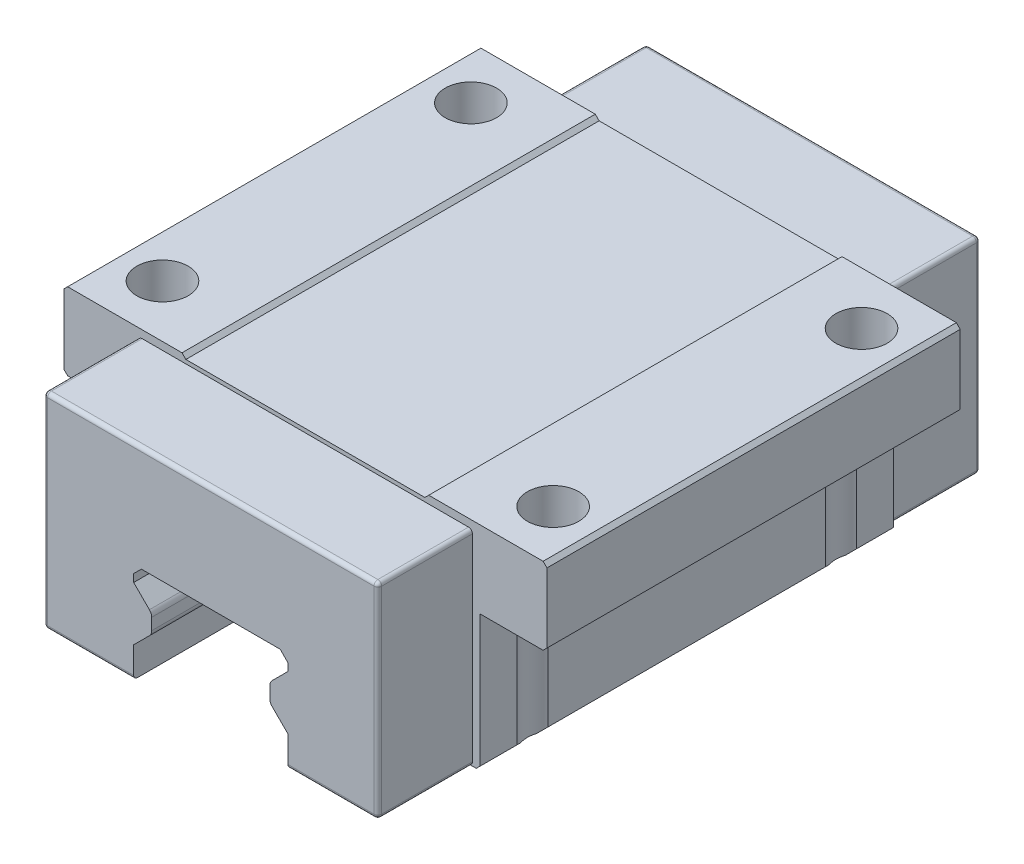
ISO-10303-21;
HEADER;
FILE_DESCRIPTION(('STEP AP214'),'2;1');
FILE_NAME('part.step','',(''),(''),'','','');
FILE_SCHEMA(('AUTOMOTIVE_DESIGN { 1 0 10303 214 1 1 1 1 }'));
ENDSEC;
DATA;
#1=APPLICATION_CONTEXT('core data for automotive mechanical design processes');
#2=APPLICATION_PROTOCOL_DEFINITION('international standard','automotive_design',2000,#1);
#3=PRODUCT_CONTEXT('',#1,'mechanical');
#4=PRODUCT('Part','Part','',(#3));
#5=PRODUCT_RELATED_PRODUCT_CATEGORY('part','',(#4));
#6=PRODUCT_DEFINITION_FORMATION('','',#4);
#7=PRODUCT_DEFINITION_CONTEXT('part definition',#1,'design');
#8=PRODUCT_DEFINITION('design','',#6,#7);
#9=PRODUCT_DEFINITION_SHAPE('','',#8);
#10=(LENGTH_UNIT() NAMED_UNIT(*) SI_UNIT(.MILLI.,.METRE.));
#11=(NAMED_UNIT(*) PLANE_ANGLE_UNIT() SI_UNIT($,.RADIAN.));
#12=(NAMED_UNIT(*) SI_UNIT($,.STERADIAN.) SOLID_ANGLE_UNIT());
#13=UNCERTAINTY_MEASURE_WITH_UNIT(LENGTH_MEASURE(1.E-05),#10,'distance_accuracy_value','');
#14=(GEOMETRIC_REPRESENTATION_CONTEXT(3) GLOBAL_UNCERTAINTY_ASSIGNED_CONTEXT((#13)) GLOBAL_UNIT_ASSIGNED_CONTEXT((#10,
#11,#12)) REPRESENTATION_CONTEXT('',''));
#15=CARTESIAN_POINT('',(0.,0.,0.));
#16=DIRECTION('',(0.,0.,1.));
#17=DIRECTION('',(1.,0.,0.));
#18=AXIS2_PLACEMENT_3D('',#15,#16,#17);
#19=CARTESIAN_POINT('',(-17.,3.3,20.1));
#20=DIRECTION('',(1.,0.,0.));
#21=DIRECTION('',(0.,0.,-1.));
#22=AXIS2_PLACEMENT_3D('',#19,#20,#21);
#23=PLANE('',#22);
#24=DIRECTION('',(0.,1.,0.));
#25=VECTOR('',#24,1.);
#26=CARTESIAN_POINT('',(-17.,3.,-16.5));
#27=LINE('',#26,#25);
#28=CARTESIAN_POINT('',(-17.,16.5,-16.5));
#29=VERTEX_POINT('',#28);
#30=CARTESIAN_POINT('',(-17.,3.67499999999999,-16.5));
#31=VERTEX_POINT('',#30);
#32=EDGE_CURVE('E1464',#29,#31,#27,.F.);
#33=ORIENTED_EDGE('',*,*,#32,.F.);
#34=DIRECTION('',(0.,0.,1.));
#35=VECTOR('',#34,1.);
#36=CARTESIAN_POINT('',(-17.,16.5,20.1));
#37=LINE('',#36,#35);
#38=CARTESIAN_POINT('',(-17.,16.5,-20.1));
#39=VERTEX_POINT('',#38);
#40=EDGE_CURVE('E679',#39,#29,#37,.T.);
#41=ORIENTED_EDGE('',*,*,#40,.F.);
#42=DIRECTION('',(0.,-1.,0.));
#43=VECTOR('',#42,1.);
#44=CARTESIAN_POINT('',(-17.,3.3,-20.1));
#45=LINE('',#44,#43);
#46=CARTESIAN_POINT('',(-17.,3.67499999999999,-20.1));
#47=VERTEX_POINT('',#46);
#48=EDGE_CURVE('E852',#39,#47,#45,.T.);
#49=ORIENTED_EDGE('',*,*,#48,.T.);
#50=DIRECTION('',(0.,0.,1.));
#51=VECTOR('',#50,1.);
#52=CARTESIAN_POINT('',(-17.,3.67499999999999,20.1));
#53=LINE('',#52,#51);
#54=EDGE_CURVE('E993',#47,#31,#53,.T.);
#55=ORIENTED_EDGE('',*,*,#54,.T.);
#56=EDGE_LOOP('',(#33,#41,#49,#55));
#57=FACE_BOUND('',#56,.T.);
#58=ADVANCED_FACE('F39',(#57),#23,.F.);
#59=DIRECTION('',(0.,1.,0.));
#60=VECTOR('',#59,1.);
#61=CARTESIAN_POINT('',(-17.,3.,-13.5));
#62=LINE('',#61,#60);
#63=CARTESIAN_POINT('',(-17.,3.67499999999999,-13.5));
#64=VERTEX_POINT('',#63);
#65=CARTESIAN_POINT('',(-17.,10.375,-13.5));
#66=VERTEX_POINT('',#65);
#67=EDGE_CURVE('E1463',#64,#66,#62,.T.);
#68=ORIENTED_EDGE('',*,*,#67,.F.);
#69=CARTESIAN_POINT('',(-17.,3.67499999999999,13.5));
#70=VERTEX_POINT('',#69);
#71=EDGE_CURVE('E998',#64,#70,#53,.T.);
#72=ORIENTED_EDGE('',*,*,#71,.T.);
#73=DIRECTION('',(0.,1.,0.));
#74=VECTOR('',#73,1.);
#75=CARTESIAN_POINT('',(-17.,3.,13.5));
#76=LINE('',#75,#74);
#77=CARTESIAN_POINT('',(-17.,10.375,13.5));
#78=VERTEX_POINT('',#77);
#79=EDGE_CURVE('E1369',#70,#78,#76,.T.);
#80=ORIENTED_EDGE('',*,*,#79,.T.);
#81=DIRECTION('',(0.,0.,-1.));
#82=VECTOR('',#81,1.);
#83=CARTESIAN_POINT('',(-17.,10.375,9.9));
#84=LINE('',#83,#82);
#85=EDGE_CURVE('E709',#78,#66,#84,.T.);
#86=ORIENTED_EDGE('',*,*,#85,.T.);
#87=EDGE_LOOP('',(#68,#72,#80,#86));
#88=FACE_BOUND('',#87,.T.);
#89=ADVANCED_FACE('F648',(#88),#23,.F.);
#90=CARTESIAN_POINT('',(-16.625,3.3,20.1));
#91=DIRECTION('',(0.707106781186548,0.707106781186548,0.));
#92=DIRECTION('',(0.,0.,-1.));
#93=AXIS2_PLACEMENT_3D('',#90,#91,#92);
#94=PLANE('',#93);
#95=ORIENTED_EDGE('',*,*,#71,.F.);
#96=CARTESIAN_POINT('',(-19.,5.675,-15.));
#97=DIRECTION('',(0.707106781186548,0.707106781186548,0.));
#98=DIRECTION('',(-0.707106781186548,0.707106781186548,0.));
#99=AXIS2_PLACEMENT_3D('',#96,#97,#98);
#100=ELLIPSE('',#99,3.53553390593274,2.5);
#101=CARTESIAN_POINT('',(-16.625,3.3,-14.2193752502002));
#102=VERTEX_POINT('',#101);
#103=EDGE_CURVE('E1477',#64,#102,#100,.T.);
#104=ORIENTED_EDGE('',*,*,#103,.T.);
#105=DIRECTION('',(0.,0.,-1.));
#106=VECTOR('',#105,1.);
#107=CARTESIAN_POINT('',(-16.625,3.3,20.1));
#108=LINE('',#107,#106);
#109=CARTESIAN_POINT('',(-16.625,3.3,14.2193752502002));
#110=VERTEX_POINT('',#109);
#111=EDGE_CURVE('E992',#110,#102,#108,.T.);
#112=ORIENTED_EDGE('',*,*,#111,.F.);
#113=CARTESIAN_POINT('',(-19.,5.675,15.));
#114=DIRECTION('',(0.707106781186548,0.707106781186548,0.));
#115=DIRECTION('',(-0.707106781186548,0.707106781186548,0.));
#116=AXIS2_PLACEMENT_3D('',#113,#114,#115);
#117=ELLIPSE('',#116,3.53553390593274,2.5);
#118=EDGE_CURVE('E1377',#70,#110,#117,.F.);
#119=ORIENTED_EDGE('',*,*,#118,.F.);
#120=EDGE_LOOP('',(#95,#104,#112,#119));
#121=FACE_BOUND('',#120,.T.);
#122=ADVANCED_FACE('F654',(#121),#94,.F.);
#123=CARTESIAN_POINT('',(17.,3.3,20.1));
#124=DIRECTION('',(-1.,0.,0.));
#125=DIRECTION('',(0.,-1.,0.));
#126=AXIS2_PLACEMENT_3D('',#123,#124,#125);
#127=PLANE('',#126);
#128=DIRECTION('',(0.,1.,0.));
#129=VECTOR('',#128,1.);
#130=CARTESIAN_POINT('',(17.,3.,-13.5));
#131=LINE('',#130,#129);
#132=CARTESIAN_POINT('',(17.,10.375,-13.5));
#133=VERTEX_POINT('',#132);
#134=CARTESIAN_POINT('',(17.,3.67500000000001,-13.5));
#135=VERTEX_POINT('',#134);
#136=EDGE_CURVE('E553',#133,#135,#131,.F.);
#137=ORIENTED_EDGE('',*,*,#136,.F.);
#138=DIRECTION('',(0.,0.,-1.));
#139=VECTOR('',#138,1.);
#140=CARTESIAN_POINT('',(17.,10.375,9.9));
#141=LINE('',#140,#139);
#142=CARTESIAN_POINT('',(17.,10.375,13.5));
#143=VERTEX_POINT('',#142);
#144=EDGE_CURVE('E551',#143,#133,#141,.T.);
#145=ORIENTED_EDGE('',*,*,#144,.F.);
#146=DIRECTION('',(0.,1.,0.));
#147=VECTOR('',#146,1.);
#148=CARTESIAN_POINT('',(17.,3.,13.5));
#149=LINE('',#148,#147);
#150=CARTESIAN_POINT('',(17.,3.67500000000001,13.5));
#151=VERTEX_POINT('',#150);
#152=EDGE_CURVE('E610',#143,#151,#149,.F.);
#153=ORIENTED_EDGE('',*,*,#152,.T.);
#154=DIRECTION('',(0.,0.,-1.));
#155=VECTOR('',#154,1.);
#156=CARTESIAN_POINT('',(17.,3.67500000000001,20.1));
#157=LINE('',#156,#155);
#158=EDGE_CURVE('E974',#151,#135,#157,.T.);
#159=ORIENTED_EDGE('',*,*,#158,.T.);
#160=EDGE_LOOP('',(#137,#145,#153,#159));
#161=FACE_BOUND('',#160,.T.);
#162=ADVANCED_FACE('F1822',(#161),#127,.F.);
#163=DIRECTION('',(0.,1.,0.));
#164=VECTOR('',#163,1.);
#165=CARTESIAN_POINT('',(17.,3.,-16.5));
#166=LINE('',#165,#164);
#167=CARTESIAN_POINT('',(17.,3.67500000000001,-16.5));
#168=VERTEX_POINT('',#167);
#169=CARTESIAN_POINT('',(17.,16.5,-16.5));
#170=VERTEX_POINT('',#169);
#171=EDGE_CURVE('E1523',#168,#170,#166,.T.);
#172=ORIENTED_EDGE('',*,*,#171,.F.);
#173=CARTESIAN_POINT('',(17.,3.67500000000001,-20.1));
#174=VERTEX_POINT('',#173);
#175=EDGE_CURVE('E968',#168,#174,#157,.T.);
#176=ORIENTED_EDGE('',*,*,#175,.T.);
#177=DIRECTION('',(0.,1.,0.));
#178=VECTOR('',#177,1.);
#179=CARTESIAN_POINT('',(17.,3.3,-20.1));
#180=LINE('',#179,#178);
#181=CARTESIAN_POINT('',(17.,16.5,-20.1));
#182=VERTEX_POINT('',#181);
#183=EDGE_CURVE('E828',#174,#182,#180,.T.);
#184=ORIENTED_EDGE('',*,*,#183,.T.);
#185=DIRECTION('',(0.,0.,-1.));
#186=VECTOR('',#185,1.);
#187=CARTESIAN_POINT('',(17.,16.5,20.1));
#188=LINE('',#187,#186);
#189=EDGE_CURVE('E1410',#170,#182,#188,.T.);
#190=ORIENTED_EDGE('',*,*,#189,.F.);
#191=EDGE_LOOP('',(#172,#176,#184,#190));
#192=FACE_BOUND('',#191,.T.);
#193=ADVANCED_FACE('F1522',(#192),#127,.F.);
#194=CARTESIAN_POINT('',(17.,3.67500000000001,20.1));
#195=DIRECTION('',(-0.707106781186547,0.707106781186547,0.));
#196=DIRECTION('',(0.,0.,-1.));
#197=AXIS2_PLACEMENT_3D('',#194,#195,#196);
#198=PLANE('',#197);
#199=ORIENTED_EDGE('',*,*,#175,.F.);
#200=CARTESIAN_POINT('',(19.,5.675,-15.));
#201=DIRECTION('',(-0.707106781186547,0.707106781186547,0.));
#202=DIRECTION('',(0.707106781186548,0.707106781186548,0.));
#203=AXIS2_PLACEMENT_3D('',#200,#201,#202);
#204=ELLIPSE('',#203,3.53553390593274,2.5);
#205=CARTESIAN_POINT('',(16.625,3.3,-15.7806247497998));
#206=VERTEX_POINT('',#205);
#207=EDGE_CURVE('E1536',#168,#206,#204,.T.);
#208=ORIENTED_EDGE('',*,*,#207,.T.);
#209=DIRECTION('',(0.,0.,1.));
#210=VECTOR('',#209,1.);
#211=CARTESIAN_POINT('',(16.625,3.3,20.1));
#212=LINE('',#211,#210);
#213=CARTESIAN_POINT('',(16.625,3.3,-20.1));
#214=VERTEX_POINT('',#213);
#215=EDGE_CURVE('E981',#214,#206,#212,.T.);
#216=ORIENTED_EDGE('',*,*,#215,.F.);
#217=DIRECTION('',(0.707106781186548,0.707106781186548,0.));
#218=VECTOR('',#217,1.);
#219=CARTESIAN_POINT('',(6.6625,-6.6625,-20.1));
#220=LINE('',#219,#218);
#221=EDGE_CURVE('E965',#174,#214,#220,.F.);
#222=ORIENTED_EDGE('',*,*,#221,.F.);
#223=EDGE_LOOP('',(#199,#208,#216,#222));
#224=FACE_BOUND('',#223,.T.);
#225=ADVANCED_FACE('F1354',(#224),#198,.F.);
#226=CARTESIAN_POINT('',(-23.125,10.375,9.9));
#227=DIRECTION('',(0.,0.,-1.));
#228=DIRECTION('',(-1.,0.,0.));
#229=AXIS2_PLACEMENT_3D('',#226,#227,#228);
#230=CYLINDRICAL_SURFACE('',#229,6.12500000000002);
#231=CARTESIAN_POINT('',(-21.5,4.4694940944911,-15.));
#232=CARTESIAN_POINT('',(-21.4999946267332,4.46949226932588,-14.8652622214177));
#233=CARTESIAN_POINT('',(-21.4890570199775,4.47247172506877,-14.7303302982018));
#234=CARTESIAN_POINT('',(-21.4456157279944,4.48468700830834,-14.4640611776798));
#235=CARTESIAN_POINT('',(-21.413063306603,4.49393697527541,-14.3327328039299));
#236=CARTESIAN_POINT('',(-21.3275273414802,4.51951557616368,-14.0776759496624));
#237=CARTESIAN_POINT('',(-21.2745542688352,4.53584058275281,-13.9539436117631));
#238=CARTESIAN_POINT('',(-21.1502227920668,4.57671255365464,-13.7176775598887));
#239=CARTESIAN_POINT('',(-21.0788765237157,4.60125409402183,-13.6051365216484));
#240=CARTESIAN_POINT('',(-20.9211612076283,4.65960663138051,-13.3949136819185));
#241=CARTESIAN_POINT('',(-20.8348824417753,4.69336258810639,-13.2971488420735));
#242=CARTESIAN_POINT('',(-20.6506974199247,4.77112454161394,-13.1180592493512));
#243=CARTESIAN_POINT('',(-20.5527910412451,4.81513064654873,-13.0367346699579));
#244=CARTESIAN_POINT('',(-20.3486817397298,4.91417259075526,-12.8912318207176));
#245=CARTESIAN_POINT('',(-20.2424163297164,4.9692975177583,-12.8272024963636));
#246=CARTESIAN_POINT('',(-20.0265825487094,5.09004648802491,-12.7172791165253));
#247=CARTESIAN_POINT('',(-19.9170134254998,5.1556729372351,-12.6713892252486));
#248=CARTESIAN_POINT('',(-19.6896713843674,5.3021471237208,-12.5937772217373));
#249=CARTESIAN_POINT('',(-19.5719352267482,5.38378832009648,-12.5634632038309));
#250=CARTESIAN_POINT('',(-19.3405344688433,5.55687179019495,-12.5205019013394));
#251=CARTESIAN_POINT('',(-19.2268725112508,5.6483202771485,-12.5078658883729));
#252=CARTESIAN_POINT('',(-19.0303364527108,5.81842589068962,-12.4986955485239));
#253=CARTESIAN_POINT('',(-18.946179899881,5.89548582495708,-12.4992361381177));
#254=CARTESIAN_POINT('',(-18.7824956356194,6.05397274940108,-12.5081309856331));
#255=CARTESIAN_POINT('',(-18.7029700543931,6.13540171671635,-12.5164888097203));
#256=CARTESIAN_POINT('',(-18.4718189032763,6.38563167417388,-12.5514593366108));
#257=CARTESIAN_POINT('',(-18.327824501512,6.56019718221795,-12.5879726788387));
#258=CARTESIAN_POINT('',(-18.0966978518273,6.87366877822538,-12.6665867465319));
#259=CARTESIAN_POINT('',(-18.0045305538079,7.00999971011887,-12.7047459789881));
#260=CARTESIAN_POINT('',(-17.8321271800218,7.28827162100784,-12.7874884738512));
#261=CARTESIAN_POINT('',(-17.7518979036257,7.43021573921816,-12.8320753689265));
#262=CARTESIAN_POINT('',(-17.6031800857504,7.71950081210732,-12.9247668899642));
#263=CARTESIAN_POINT('',(-17.5347241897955,7.86685544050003,-12.9728807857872));
#264=CARTESIAN_POINT('',(-17.4097484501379,8.16641358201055,-13.0693733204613));
#265=CARTESIAN_POINT('',(-17.3532248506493,8.3186155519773,-13.1177518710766));
#266=CARTESIAN_POINT('',(-17.2640633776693,8.59159506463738,-13.2001944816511));
#267=CARTESIAN_POINT('',(-17.2289338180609,8.71135283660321,-13.2349509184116));
#268=CARTESIAN_POINT('',(-17.1658453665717,8.95380690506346,-13.3006035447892));
#269=CARTESIAN_POINT('',(-17.1378862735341,9.0765031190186,-13.3314998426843));
#270=CARTESIAN_POINT('',(-17.0895443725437,9.32395929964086,-13.3870796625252));
#271=CARTESIAN_POINT('',(-17.0691149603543,9.44870140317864,-13.4118010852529));
#272=CARTESIAN_POINT('',(-17.0359256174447,9.70052982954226,-13.4530288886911));
#273=CARTESIAN_POINT('',(-17.0231621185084,9.8276150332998,-13.4695390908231));
#274=CARTESIAN_POINT('',(-17.0054764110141,10.085230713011,-13.4926511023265));
#275=CARTESIAN_POINT('',(-17.0006767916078,10.2157841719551,-13.4990979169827));
#276=CARTESIAN_POINT('',(-16.9994568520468,10.476994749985,-13.50072389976));
#277=CARTESIAN_POINT('',(-17.0030360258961,10.6076518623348,-13.495903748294));
#278=CARTESIAN_POINT('',(-17.0184882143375,10.8682138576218,-13.4756097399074));
#279=CARTESIAN_POINT('',(-17.030399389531,10.9981124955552,-13.4600868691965));
#280=CARTESIAN_POINT('',(-17.0622363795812,11.2555480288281,-13.4202168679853));
#281=CARTESIAN_POINT('',(-17.082165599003,11.3830838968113,-13.395865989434));
#282=CARTESIAN_POINT('',(-17.1368401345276,11.6732499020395,-13.3324071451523));
#283=CARTESIAN_POINT('',(-17.1742398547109,11.8348831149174,-13.2910634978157));
#284=CARTESIAN_POINT('',(-17.2614418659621,12.1530766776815,-13.2024232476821));
#285=CARTESIAN_POINT('',(-17.3112496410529,12.3096347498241,-13.1551240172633));
#286=CARTESIAN_POINT('',(-17.4230904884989,12.6179336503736,-13.0586554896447));
#287=CARTESIAN_POINT('',(-17.4851362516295,12.769669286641,-13.0094842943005));
#288=CARTESIAN_POINT('',(-17.6213479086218,13.0680172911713,-12.9128244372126));
#289=CARTESIAN_POINT('',(-17.6955085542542,13.2146318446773,-12.8653350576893));
#290=CARTESIAN_POINT('',(-17.9004286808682,13.5819889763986,-12.7502545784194));
#291=CARTESIAN_POINT('',(-18.039877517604,13.79912871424,-12.6859813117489));
#292=CARTESIAN_POINT('',(-18.2709306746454,14.1127074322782,-12.607290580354));
#293=CARTESIAN_POINT('',(-18.3515249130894,14.2151379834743,-12.584024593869));
#294=CARTESIAN_POINT('',(-18.5198286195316,14.4154387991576,-12.5450250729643));
#295=CARTESIAN_POINT('',(-18.6075351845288,14.5133108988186,-12.5292884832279));
#296=CARTESIAN_POINT('',(-18.8263089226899,14.742017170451,-12.5027333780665));
#297=CARTESIAN_POINT('',(-18.9606735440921,14.8703534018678,-12.4964089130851));
#298=CARTESIAN_POINT('',(-19.1700094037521,15.0528507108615,-12.5048106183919));
#299=CARTESIAN_POINT('',(-19.2410743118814,15.1120067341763,-12.5105902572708));
#300=CARTESIAN_POINT('',(-19.3852710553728,15.2266527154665,-12.5287957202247));
#301=CARTESIAN_POINT('',(-19.4584025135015,15.2821433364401,-12.5412203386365));
#302=CARTESIAN_POINT('',(-19.6535302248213,15.4234508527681,-12.5837474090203));
#303=CARTESIAN_POINT('',(-19.7767494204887,15.5058604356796,-12.620078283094));
#304=CARTESIAN_POINT('',(-20.0224899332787,15.6580815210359,-12.7148667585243));
#305=CARTESIAN_POINT('',(-20.1450115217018,15.7278982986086,-12.7733150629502));
#306=CARTESIAN_POINT('',(-20.3844779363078,15.8543803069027,-12.9137180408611));
#307=CARTESIAN_POINT('',(-20.5013865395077,15.9109673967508,-12.9958062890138));
#308=CARTESIAN_POINT('',(-20.7225241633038,16.0104660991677,-13.1823617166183));
#309=CARTESIAN_POINT('',(-20.826756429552,16.0533812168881,-13.2868231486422));
#310=CARTESIAN_POINT('',(-21.0071207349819,16.1229241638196,-13.503565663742));
#311=CARTESIAN_POINT('',(-21.0850275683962,16.1507591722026,-13.6139915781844));
#312=CARTESIAN_POINT('',(-21.2225721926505,16.1975157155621,-13.8473898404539));
#313=CARTESIAN_POINT('',(-21.2822125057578,16.216438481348,-13.9703604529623));
#314=CARTESIAN_POINT('',(-21.3796295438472,16.2462735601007,-14.2220889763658));
#315=CARTESIAN_POINT('',(-21.4179013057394,16.2573689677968,-14.3506342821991));
#316=CARTESIAN_POINT('',(-21.4734220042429,16.2731993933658,-14.6125647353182));
#317=CARTESIAN_POINT('',(-21.4906707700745,16.2779343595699,-14.7459499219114));
#318=CARTESIAN_POINT('',(-21.5036049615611,16.2815008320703,-15.0148619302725));
#319=CARTESIAN_POINT('',(-21.4991248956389,16.2802870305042,-15.1503973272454));
#320=CARTESIAN_POINT('',(-21.4683729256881,16.2717331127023,-15.4187822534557));
#321=CARTESIAN_POINT('',(-21.4421003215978,16.2643927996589,-15.5516316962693));
#322=CARTESIAN_POINT('',(-21.368606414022,16.2428926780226,-15.8111231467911));
#323=CARTESIAN_POINT('',(-21.3213431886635,16.228719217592,-15.937752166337));
#324=CARTESIAN_POINT('',(-21.2076261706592,16.192460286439,-16.1808408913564));
#325=CARTESIAN_POINT('',(-21.141175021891,16.1703759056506,-16.2973019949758));
#326=CARTESIAN_POINT('',(-20.9923164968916,16.117252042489,-16.5159254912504));
#327=CARTESIAN_POINT('',(-20.9100327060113,16.0862810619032,-16.6181887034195));
#328=CARTESIAN_POINT('',(-20.7326810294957,16.014287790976,-16.806812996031));
#329=CARTESIAN_POINT('',(-20.6376148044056,15.9732668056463,-16.8931761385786));
#330=CARTESIAN_POINT('',(-20.4384829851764,15.8804819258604,-17.0486029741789));
#331=CARTESIAN_POINT('',(-20.3343908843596,15.8286857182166,-17.1176132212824));
#332=CARTESIAN_POINT('',(-20.121733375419,15.7145299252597,-17.2375507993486));
#333=CARTESIAN_POINT('',(-20.0131670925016,15.6521682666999,-17.2884745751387));
#334=CARTESIAN_POINT('',(-19.7883387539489,15.513180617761,-17.3757119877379));
#335=CARTESIAN_POINT('',(-19.6720381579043,15.435888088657,-17.4108509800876));
#336=CARTESIAN_POINT('',(-19.442485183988,15.2713943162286,-17.4633502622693));
#337=CARTESIAN_POINT('',(-19.3292347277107,15.1841869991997,-17.4806995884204));
#338=CARTESIAN_POINT('',(-19.1349010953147,15.0232954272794,-17.4977817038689));
#339=CARTESIAN_POINT('',(-19.0526048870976,14.9513681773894,-17.5007363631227));
#340=CARTESIAN_POINT('',(-18.8920051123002,14.8032415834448,-17.4989568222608));
#341=CARTESIAN_POINT('',(-18.8137032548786,14.7270404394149,-17.4942193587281));
#342=CARTESIAN_POINT('',(-18.5854055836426,14.4926754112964,-17.470135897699));
#343=CARTESIAN_POINT('',(-18.4421889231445,14.328892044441,-17.4409085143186));
#344=CARTESIAN_POINT('',(-18.1126469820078,13.909555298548,-17.3461404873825));
#345=CARTESIAN_POINT('',(-17.938042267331,13.6472851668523,-17.2699562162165));
#346=CARTESIAN_POINT('',(-17.7089853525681,13.2397651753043,-17.1426490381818));
#347=CARTESIAN_POINT('',(-17.6379936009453,13.1012664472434,-17.0979336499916));
#348=CARTESIAN_POINT('',(-17.5069045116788,12.8197307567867,-17.0067457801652));
#349=CARTESIAN_POINT('',(-17.4468047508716,12.6766948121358,-16.9602736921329));
#350=CARTESIAN_POINT('',(-17.3442078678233,12.4039478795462,-16.8741070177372));
#351=CARTESIAN_POINT('',(-17.3004568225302,12.2747470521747,-16.8342787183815));
#352=CARTESIAN_POINT('',(-17.2214490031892,12.0128095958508,-16.7577765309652));
#353=CARTESIAN_POINT('',(-17.1861932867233,11.8800725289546,-16.7211030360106));
#354=CARTESIAN_POINT('',(-17.1246070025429,11.6118266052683,-16.6537755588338));
#355=CARTESIAN_POINT('',(-17.0982282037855,11.4763371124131,-16.6230894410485));
#356=CARTESIAN_POINT('',(-17.0545384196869,11.2022490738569,-16.5704658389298));
#357=CARTESIAN_POINT('',(-17.0372211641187,11.0636527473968,-16.5485223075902));
#358=CARTESIAN_POINT('',(-17.0146406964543,10.8127314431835,-16.519412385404));
#359=CARTESIAN_POINT('',(-17.0076402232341,10.7008083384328,-16.5101459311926));
#360=CARTESIAN_POINT('',(-16.9998103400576,10.4763722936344,-16.4997625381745));
#361=CARTESIAN_POINT('',(-16.9989798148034,10.3638594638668,-16.4986441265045));
#362=CARTESIAN_POINT('',(-17.0035122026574,10.1390611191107,-16.5046756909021));
#363=CARTESIAN_POINT('',(-17.0088821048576,10.0267760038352,-16.5118349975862));
#364=CARTESIAN_POINT('',(-17.0256999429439,9.80340648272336,-16.5337290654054));
#365=CARTESIAN_POINT('',(-17.0371494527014,9.69232239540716,-16.548465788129));
#366=CARTESIAN_POINT('',(-17.071221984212,9.43132137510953,-16.5908490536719));
#367=CARTESIAN_POINT('',(-17.0964083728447,9.28218965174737,-16.6212522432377));
#368=CARTESIAN_POINT('',(-17.157224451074,8.98795659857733,-16.690051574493));
#369=CARTESIAN_POINT('',(-17.1928605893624,8.84285781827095,-16.7284526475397));
#370=CARTESIAN_POINT('',(-17.2743950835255,8.55610702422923,-16.8098686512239));
#371=CARTESIAN_POINT('',(-17.320342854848,8.4144753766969,-16.8529052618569));
#372=CARTESIAN_POINT('',(-17.4222215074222,8.13535497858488,-16.9403931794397));
#373=CARTESIAN_POINT('',(-17.4781500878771,7.99786528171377,-16.9848441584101));
#374=CARTESIAN_POINT('',(-17.603893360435,7.71831544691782,-17.0753963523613));
#375=CARTESIAN_POINT('',(-17.674367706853,7.57652601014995,-17.1214210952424));
#376=CARTESIAN_POINT('',(-17.8267301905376,7.29779500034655,-17.2093396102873));
#377=CARTESIAN_POINT('',(-17.9086216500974,7.16085485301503,-17.2512321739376));
#378=CARTESIAN_POINT('',(-18.0834982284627,6.8929972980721,-17.3278962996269));
#379=CARTESIAN_POINT('',(-18.1764334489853,6.7620562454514,-17.362698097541));
#380=CARTESIAN_POINT('',(-18.3734749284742,6.50658541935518,-17.4224073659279));
#381=CARTESIAN_POINT('',(-18.4775716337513,6.38205029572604,-17.4473232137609));
#382=CARTESIAN_POINT('',(-18.711288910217,6.12424161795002,-17.486466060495));
#383=CARTESIAN_POINT('',(-18.8424584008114,5.99205454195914,-17.4987984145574));
#384=CARTESIAN_POINT('',(-19.1164906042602,5.7401312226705,-17.5010330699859));
#385=CARTESIAN_POINT('',(-19.2593413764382,5.62038254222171,-17.4909580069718));
#386=CARTESIAN_POINT('',(-19.5293947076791,5.41401654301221,-17.4464971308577));
#387=CARTESIAN_POINT('',(-19.6555101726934,5.32515282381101,-17.4161977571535));
#388=CARTESIAN_POINT('',(-19.8452806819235,5.2015273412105,-17.3537106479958));
#389=CARTESIAN_POINT('',(-19.9086601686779,5.16191791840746,-17.3300302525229));
#390=CARTESIAN_POINT('',(-20.0349415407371,5.08608986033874,-17.2767487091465));
#391=CARTESIAN_POINT('',(-20.0978436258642,5.04986972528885,-17.2471501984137));
#392=CARTESIAN_POINT('',(-20.2228921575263,4.98069343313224,-17.1816403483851));
#393=CARTESIAN_POINT('',(-20.2850293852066,4.94776382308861,-17.1456832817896));
#394=CARTESIAN_POINT('',(-20.4071973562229,4.88556743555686,-17.0676188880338));
#395=CARTESIAN_POINT('',(-20.4672290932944,4.85629891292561,-17.0255145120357));
#396=CARTESIAN_POINT('',(-20.5843542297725,4.8014080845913,-16.9352731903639));
#397=CARTESIAN_POINT('',(-20.641447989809,4.77578533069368,-16.8871369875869));
#398=CARTESIAN_POINT('',(-20.751842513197,4.72810988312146,-16.7851347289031));
#399=CARTESIAN_POINT('',(-20.8051437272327,4.70605676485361,-16.7312693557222));
#400=CARTESIAN_POINT('',(-20.9459475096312,4.64990757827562,-16.5751803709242));
#401=CARTESIAN_POINT('',(-21.0287125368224,4.61937095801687,-16.4672769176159));
#402=CARTESIAN_POINT('',(-21.1763290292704,4.56772234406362,-16.2378340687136));
#403=CARTESIAN_POINT('',(-21.2411742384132,4.54661364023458,-16.116289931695));
#404=CARTESIAN_POINT('',(-21.348469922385,4.51303570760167,-15.8674404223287));
#405=CARTESIAN_POINT('',(-21.3915877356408,4.50030479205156,-15.7404567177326));
#406=CARTESIAN_POINT('',(-21.4569299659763,4.48141504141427,-15.4809671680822));
#407=CARTESIAN_POINT('',(-21.4792016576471,4.47524133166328,-15.348474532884));
#408=CARTESIAN_POINT('',(-21.4938149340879,4.4711994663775,-15.1793980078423));
#409=CARTESIAN_POINT('',(-21.4961326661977,4.47055938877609,-15.1435643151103));
#410=CARTESIAN_POINT('',(-21.4992259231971,4.4697069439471,-15.0718250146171));
#411=CARTESIAN_POINT('',(-21.5000014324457,4.46949458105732,-15.0359194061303));
#412=CARTESIAN_POINT('',(-21.5,4.4694940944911,-15.));
#413=B_SPLINE_CURVE_WITH_KNOTS('',3,(#231,#232,#233,#234,#235,#236,#237,#238,#239,#240,#241,
#242,#243,#244,#245,#246,#247,#248,#249,#250,#251,#252,#253,#254,#255,#256,#257,#258,#259,#260,
#261,#262,#263,#264,#265,#266,#267,#268,#269,#270,#271,#272,#273,#274,#275,#276,#277,#278,#279,
#280,#281,#282,#283,#284,#285,#286,#287,#288,#289,#290,#291,#292,#293,#294,#295,#296,#297,#298,
#299,#300,#301,#302,#303,#304,#305,#306,#307,#308,#309,#310,#311,#312,#313,#314,#315,#316,#317,
#318,#319,#320,#321,#322,#323,#324,#325,#326,#327,#328,#329,#330,#331,#332,#333,#334,#335,#336,
#337,#338,#339,#340,#341,#342,#343,#344,#345,#346,#347,#348,#349,#350,#351,#352,#353,#354,#355,
#356,#357,#358,#359,#360,#361,#362,#363,#364,#365,#366,#367,#368,#369,#370,#371,#372,#373,#374,
#375,#376,#377,#378,#379,#380,#381,#382,#383,#384,#385,#386,#387,#388,#389,#390,#391,#392,#393,
#394,#395,#396,#397,#398,#399,#400,#401,#402,#403,#404,#405,#406,#407,#408,#409,#410,#411,#412),
.UNSPECIFIED.,.T.,.F.,(4,2,2,2,2,2,2,2,2,2,2,2,2,2,2,2,2,2,2,2,2,2,2,2,2,2,2,2,2,2,2,2,2,2,2,2,
2,2,2,2,2,2,2,2,2,2,2,2,2,2,2,2,2,2,2,2,2,2,2,2,2,2,2,2,2,2,2,2,2,2,2,2,2,2,2,2,2,2,2,2,2,2,2,2,
2,2,2,2,2,2,4),(0.,0.404076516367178,0.809067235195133,1.21385056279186,1.6183672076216,
2.02051852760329,2.4226740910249,2.82818990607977,3.23379876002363,3.67149692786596,
4.109474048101,4.45133304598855,4.79334807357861,5.47818500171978,5.98439453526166,
6.49089128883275,6.99877058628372,7.50648978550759,7.89490564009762,8.28331059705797,
8.66926949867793,9.05504861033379,9.44671278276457,9.83835330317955,10.2317993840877,
10.6254127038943,11.1375548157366,11.6499236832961,12.1628266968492,12.6755081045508,
13.4702957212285,13.8670817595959,14.2637066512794,14.8191845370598,15.0968355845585,
15.3744362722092,15.8302942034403,16.2859607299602,16.7442542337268,17.2024301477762,
17.6143338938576,18.0261807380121,18.4280420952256,18.8299067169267,19.2348368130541,
19.6397799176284,20.0455354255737,20.4512350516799,20.8538877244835,21.2564881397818,
21.6603137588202,22.0642187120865,22.4945643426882,22.925175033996,23.2527529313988,
23.5804698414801,24.2365634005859,25.203480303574,25.6889853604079,26.1743822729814,
26.6004067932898,27.0264843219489,27.4502079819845,27.8736380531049,28.2107807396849,
28.5478624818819,28.8853245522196,29.2228740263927,29.6848947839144,30.1472012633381,
30.6117724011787,31.0762365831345,31.5704283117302,32.0647641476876,32.556945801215,
33.0487094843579,33.6067923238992,34.1643116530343,34.6338681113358,34.8688168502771,
35.1036611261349,35.3402685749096,35.5767628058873,35.8132279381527,36.0496649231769,
36.4655097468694,36.8814995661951,37.2837863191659,37.6851585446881,37.7928791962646,
37.9006009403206),.UNSPECIFIED.);
#414=CARTESIAN_POINT('',(-17.0232323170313,10.9079691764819,-13.4695133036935));
#415=VERTEX_POINT('',#414);
#416=EDGE_CURVE('E55',#66,#415,#413,.T.);
#417=ORIENTED_EDGE('',*,*,#416,.F.);
#418=ORIENTED_EDGE('',*,*,#85,.F.);
#419=CARTESIAN_POINT('',(-21.5,4.4694940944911,15.));
#420=CARTESIAN_POINT('',(-21.4999946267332,4.46949226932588,14.8652622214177));
#421=CARTESIAN_POINT('',(-21.4890570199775,4.47247172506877,14.7303302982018));
#422=CARTESIAN_POINT('',(-21.4456157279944,4.48468700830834,14.4640611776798));
#423=CARTESIAN_POINT('',(-21.413063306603,4.49393697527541,14.3327328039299));
#424=CARTESIAN_POINT('',(-21.3275273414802,4.51951557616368,14.0776759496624));
#425=CARTESIAN_POINT('',(-21.2745542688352,4.53584058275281,13.9539436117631));
#426=CARTESIAN_POINT('',(-21.1502227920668,4.57671255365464,13.7176775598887));
#427=CARTESIAN_POINT('',(-21.0788765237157,4.60125409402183,13.6051365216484));
#428=CARTESIAN_POINT('',(-20.9211612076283,4.65960663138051,13.3949136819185));
#429=CARTESIAN_POINT('',(-20.8348824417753,4.69336258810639,13.2971488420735));
#430=CARTESIAN_POINT('',(-20.6506974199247,4.77112454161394,13.1180592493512));
#431=CARTESIAN_POINT('',(-20.5527910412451,4.81513064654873,13.0367346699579));
#432=CARTESIAN_POINT('',(-20.3486817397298,4.91417259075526,12.8912318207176));
#433=CARTESIAN_POINT('',(-20.2424163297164,4.9692975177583,12.8272024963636));
#434=CARTESIAN_POINT('',(-20.0265825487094,5.09004648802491,12.7172791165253));
#435=CARTESIAN_POINT('',(-19.9170134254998,5.1556729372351,12.6713892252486));
#436=CARTESIAN_POINT('',(-19.6896713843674,5.3021471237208,12.5937772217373));
#437=CARTESIAN_POINT('',(-19.5719352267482,5.38378832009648,12.5634632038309));
#438=CARTESIAN_POINT('',(-19.3405344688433,5.55687179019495,12.5205019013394));
#439=CARTESIAN_POINT('',(-19.2268725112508,5.6483202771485,12.5078658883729));
#440=CARTESIAN_POINT('',(-19.0303364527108,5.81842589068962,12.4986955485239));
#441=CARTESIAN_POINT('',(-18.946179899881,5.89548582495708,12.4992361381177));
#442=CARTESIAN_POINT('',(-18.7824956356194,6.05397274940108,12.5081309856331));
#443=CARTESIAN_POINT('',(-18.7029700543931,6.13540171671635,12.5164888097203));
#444=CARTESIAN_POINT('',(-18.4718189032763,6.38563167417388,12.5514593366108));
#445=CARTESIAN_POINT('',(-18.327824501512,6.56019718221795,12.5879726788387));
#446=CARTESIAN_POINT('',(-18.0966978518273,6.87366877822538,12.6665867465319));
#447=CARTESIAN_POINT('',(-18.0045305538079,7.00999971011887,12.7047459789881));
#448=CARTESIAN_POINT('',(-17.8321271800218,7.28827162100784,12.7874884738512));
#449=CARTESIAN_POINT('',(-17.7518979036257,7.43021573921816,12.8320753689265));
#450=CARTESIAN_POINT('',(-17.6031800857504,7.71950081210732,12.9247668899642));
#451=CARTESIAN_POINT('',(-17.5347241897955,7.86685544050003,12.9728807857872));
#452=CARTESIAN_POINT('',(-17.4097484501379,8.16641358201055,13.0693733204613));
#453=CARTESIAN_POINT('',(-17.3532248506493,8.3186155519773,13.1177518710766));
#454=CARTESIAN_POINT('',(-17.2640633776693,8.59159506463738,13.2001944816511));
#455=CARTESIAN_POINT('',(-17.2289338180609,8.71135283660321,13.2349509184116));
#456=CARTESIAN_POINT('',(-17.1658453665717,8.95380690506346,13.3006035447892));
#457=CARTESIAN_POINT('',(-17.1378862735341,9.0765031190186,13.3314998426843));
#458=CARTESIAN_POINT('',(-17.0895443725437,9.32395929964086,13.3870796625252));
#459=CARTESIAN_POINT('',(-17.0691149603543,9.44870140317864,13.4118010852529));
#460=CARTESIAN_POINT('',(-17.0359256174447,9.70052982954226,13.4530288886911));
#461=CARTESIAN_POINT('',(-17.0231621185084,9.8276150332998,13.4695390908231));
#462=CARTESIAN_POINT('',(-17.0054764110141,10.085230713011,13.4926511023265));
#463=CARTESIAN_POINT('',(-17.0006767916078,10.2157841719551,13.4990979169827));
#464=CARTESIAN_POINT('',(-16.9994568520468,10.476994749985,13.50072389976));
#465=CARTESIAN_POINT('',(-17.0030360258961,10.6076518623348,13.495903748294));
#466=CARTESIAN_POINT('',(-17.0184882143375,10.8682138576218,13.4756097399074));
#467=CARTESIAN_POINT('',(-17.030399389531,10.9981124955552,13.4600868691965));
#468=CARTESIAN_POINT('',(-17.0622363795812,11.2555480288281,13.4202168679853));
#469=CARTESIAN_POINT('',(-17.082165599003,11.3830838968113,13.395865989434));
#470=CARTESIAN_POINT('',(-17.1368401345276,11.6732499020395,13.3324071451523));
#471=CARTESIAN_POINT('',(-17.1742398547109,11.8348831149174,13.2910634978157));
#472=CARTESIAN_POINT('',(-17.2614418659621,12.1530766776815,13.2024232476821));
#473=CARTESIAN_POINT('',(-17.3112496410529,12.3096347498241,13.1551240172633));
#474=CARTESIAN_POINT('',(-17.4230904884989,12.6179336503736,13.0586554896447));
#475=CARTESIAN_POINT('',(-17.4851362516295,12.769669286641,13.0094842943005));
#476=CARTESIAN_POINT('',(-17.6213479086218,13.0680172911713,12.9128244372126));
#477=CARTESIAN_POINT('',(-17.6955085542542,13.2146318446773,12.8653350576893));
#478=CARTESIAN_POINT('',(-17.9004286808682,13.5819889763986,12.7502545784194));
#479=CARTESIAN_POINT('',(-18.039877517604,13.79912871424,12.6859813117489));
#480=CARTESIAN_POINT('',(-18.2709306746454,14.1127074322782,12.607290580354));
#481=CARTESIAN_POINT('',(-18.3515249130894,14.2151379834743,12.584024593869));
#482=CARTESIAN_POINT('',(-18.5198286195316,14.4154387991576,12.5450250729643));
#483=CARTESIAN_POINT('',(-18.6075351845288,14.5133108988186,12.5292884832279));
#484=CARTESIAN_POINT('',(-18.8263089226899,14.742017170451,12.5027333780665));
#485=CARTESIAN_POINT('',(-18.9606735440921,14.8703534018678,12.4964089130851));
#486=CARTESIAN_POINT('',(-19.1700094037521,15.0528507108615,12.5048106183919));
#487=CARTESIAN_POINT('',(-19.2410743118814,15.1120067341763,12.5105902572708));
#488=CARTESIAN_POINT('',(-19.3852710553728,15.2266527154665,12.5287957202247));
#489=CARTESIAN_POINT('',(-19.4584025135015,15.2821433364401,12.5412203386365));
#490=CARTESIAN_POINT('',(-19.6535302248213,15.4234508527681,12.5837474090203));
#491=CARTESIAN_POINT('',(-19.7767494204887,15.5058604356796,12.620078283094));
#492=CARTESIAN_POINT('',(-20.0224899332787,15.6580815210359,12.7148667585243));
#493=CARTESIAN_POINT('',(-20.1450115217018,15.7278982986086,12.7733150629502));
#494=CARTESIAN_POINT('',(-20.3844779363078,15.8543803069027,12.9137180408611));
#495=CARTESIAN_POINT('',(-20.5013865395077,15.9109673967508,12.9958062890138));
#496=CARTESIAN_POINT('',(-20.7225241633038,16.0104660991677,13.1823617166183));
#497=CARTESIAN_POINT('',(-20.826756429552,16.0533812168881,13.2868231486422));
#498=CARTESIAN_POINT('',(-21.0071207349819,16.1229241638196,13.503565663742));
#499=CARTESIAN_POINT('',(-21.0850275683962,16.1507591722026,13.6139915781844));
#500=CARTESIAN_POINT('',(-21.2225721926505,16.1975157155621,13.8473898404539));
#501=CARTESIAN_POINT('',(-21.2822125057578,16.216438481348,13.9703604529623));
#502=CARTESIAN_POINT('',(-21.3796295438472,16.2462735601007,14.2220889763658));
#503=CARTESIAN_POINT('',(-21.4179013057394,16.2573689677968,14.3506342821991));
#504=CARTESIAN_POINT('',(-21.4734220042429,16.2731993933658,14.6125647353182));
#505=CARTESIAN_POINT('',(-21.4906707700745,16.2779343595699,14.7459499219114));
#506=CARTESIAN_POINT('',(-21.5036049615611,16.2815008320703,15.0148619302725));
#507=CARTESIAN_POINT('',(-21.4991248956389,16.2802870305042,15.1503973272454));
#508=CARTESIAN_POINT('',(-21.4683729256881,16.2717331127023,15.4187822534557));
#509=CARTESIAN_POINT('',(-21.4421003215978,16.2643927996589,15.5516316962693));
#510=CARTESIAN_POINT('',(-21.368606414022,16.2428926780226,15.8111231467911));
#511=CARTESIAN_POINT('',(-21.3213431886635,16.228719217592,15.937752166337));
#512=CARTESIAN_POINT('',(-21.2076261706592,16.192460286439,16.1808408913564));
#513=CARTESIAN_POINT('',(-21.141175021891,16.1703759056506,16.2973019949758));
#514=CARTESIAN_POINT('',(-20.9923164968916,16.117252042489,16.5159254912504));
#515=CARTESIAN_POINT('',(-20.9100327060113,16.0862810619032,16.6181887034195));
#516=CARTESIAN_POINT('',(-20.7326810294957,16.014287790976,16.806812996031));
#517=CARTESIAN_POINT('',(-20.6376148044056,15.9732668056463,16.8931761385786));
#518=CARTESIAN_POINT('',(-20.4384829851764,15.8804819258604,17.0486029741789));
#519=CARTESIAN_POINT('',(-20.3343908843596,15.8286857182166,17.1176132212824));
#520=CARTESIAN_POINT('',(-20.121733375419,15.7145299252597,17.2375507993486));
#521=CARTESIAN_POINT('',(-20.0131670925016,15.6521682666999,17.2884745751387));
#522=CARTESIAN_POINT('',(-19.7883387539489,15.513180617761,17.3757119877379));
#523=CARTESIAN_POINT('',(-19.6720381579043,15.435888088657,17.4108509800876));
#524=CARTESIAN_POINT('',(-19.442485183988,15.2713943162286,17.4633502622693));
#525=CARTESIAN_POINT('',(-19.3292347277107,15.1841869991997,17.4806995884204));
#526=CARTESIAN_POINT('',(-19.1349010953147,15.0232954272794,17.4977817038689));
#527=CARTESIAN_POINT('',(-19.0526048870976,14.9513681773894,17.5007363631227));
#528=CARTESIAN_POINT('',(-18.8920051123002,14.8032415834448,17.4989568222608));
#529=CARTESIAN_POINT('',(-18.8137032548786,14.7270404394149,17.4942193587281));
#530=CARTESIAN_POINT('',(-18.5854055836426,14.4926754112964,17.470135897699));
#531=CARTESIAN_POINT('',(-18.4421889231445,14.328892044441,17.4409085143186));
#532=CARTESIAN_POINT('',(-18.1126469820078,13.909555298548,17.3461404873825));
#533=CARTESIAN_POINT('',(-17.938042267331,13.6472851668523,17.2699562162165));
#534=CARTESIAN_POINT('',(-17.7089853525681,13.2397651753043,17.1426490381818));
#535=CARTESIAN_POINT('',(-17.6379936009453,13.1012664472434,17.0979336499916));
#536=CARTESIAN_POINT('',(-17.5069045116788,12.8197307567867,17.0067457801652));
#537=CARTESIAN_POINT('',(-17.4468047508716,12.6766948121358,16.9602736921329));
#538=CARTESIAN_POINT('',(-17.3442078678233,12.4039478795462,16.8741070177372));
#539=CARTESIAN_POINT('',(-17.3004568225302,12.2747470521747,16.8342787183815));
#540=CARTESIAN_POINT('',(-17.2214490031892,12.0128095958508,16.7577765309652));
#541=CARTESIAN_POINT('',(-17.1861932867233,11.8800725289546,16.7211030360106));
#542=CARTESIAN_POINT('',(-17.1246070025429,11.6118266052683,16.6537755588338));
#543=CARTESIAN_POINT('',(-17.0982282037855,11.4763371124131,16.6230894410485));
#544=CARTESIAN_POINT('',(-17.0545384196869,11.2022490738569,16.5704658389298));
#545=CARTESIAN_POINT('',(-17.0372211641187,11.0636527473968,16.5485223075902));
#546=CARTESIAN_POINT('',(-17.0146406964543,10.8127314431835,16.519412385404));
#547=CARTESIAN_POINT('',(-17.0076402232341,10.7008083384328,16.5101459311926));
#548=CARTESIAN_POINT('',(-16.9998103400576,10.4763722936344,16.4997625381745));
#549=CARTESIAN_POINT('',(-16.9989798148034,10.3638594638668,16.4986441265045));
#550=CARTESIAN_POINT('',(-17.0035122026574,10.1390611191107,16.5046756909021));
#551=CARTESIAN_POINT('',(-17.0088821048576,10.0267760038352,16.5118349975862));
#552=CARTESIAN_POINT('',(-17.0256999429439,9.80340648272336,16.5337290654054));
#553=CARTESIAN_POINT('',(-17.0371494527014,9.69232239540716,16.548465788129));
#554=CARTESIAN_POINT('',(-17.071221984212,9.43132137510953,16.5908490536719));
#555=CARTESIAN_POINT('',(-17.0964083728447,9.28218965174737,16.6212522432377));
#556=CARTESIAN_POINT('',(-17.157224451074,8.98795659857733,16.690051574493));
#557=CARTESIAN_POINT('',(-17.1928605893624,8.84285781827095,16.7284526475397));
#558=CARTESIAN_POINT('',(-17.2743950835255,8.55610702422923,16.8098686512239));
#559=CARTESIAN_POINT('',(-17.320342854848,8.4144753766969,16.8529052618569));
#560=CARTESIAN_POINT('',(-17.4222215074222,8.13535497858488,16.9403931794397));
#561=CARTESIAN_POINT('',(-17.4781500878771,7.99786528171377,16.9848441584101));
#562=CARTESIAN_POINT('',(-17.603893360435,7.71831544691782,17.0753963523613));
#563=CARTESIAN_POINT('',(-17.674367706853,7.57652601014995,17.1214210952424));
#564=CARTESIAN_POINT('',(-17.8267301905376,7.29779500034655,17.2093396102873));
#565=CARTESIAN_POINT('',(-17.9086216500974,7.16085485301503,17.2512321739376));
#566=CARTESIAN_POINT('',(-18.0834982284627,6.8929972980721,17.3278962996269));
#567=CARTESIAN_POINT('',(-18.1764334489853,6.7620562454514,17.362698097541));
#568=CARTESIAN_POINT('',(-18.3734749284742,6.50658541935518,17.4224073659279));
#569=CARTESIAN_POINT('',(-18.4775716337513,6.38205029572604,17.4473232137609));
#570=CARTESIAN_POINT('',(-18.711288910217,6.12424161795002,17.486466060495));
#571=CARTESIAN_POINT('',(-18.8424584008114,5.99205454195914,17.4987984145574));
#572=CARTESIAN_POINT('',(-19.1164906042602,5.7401312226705,17.5010330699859));
#573=CARTESIAN_POINT('',(-19.2593413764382,5.62038254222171,17.4909580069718));
#574=CARTESIAN_POINT('',(-19.5293947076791,5.41401654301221,17.4464971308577));
#575=CARTESIAN_POINT('',(-19.6555101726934,5.32515282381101,17.4161977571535));
#576=CARTESIAN_POINT('',(-19.8452806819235,5.2015273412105,17.3537106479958));
#577=CARTESIAN_POINT('',(-19.9086601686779,5.16191791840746,17.3300302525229));
#578=CARTESIAN_POINT('',(-20.0349415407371,5.08608986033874,17.2767487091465));
#579=CARTESIAN_POINT('',(-20.0978436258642,5.04986972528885,17.2471501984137));
#580=CARTESIAN_POINT('',(-20.2228921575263,4.98069343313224,17.1816403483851));
#581=CARTESIAN_POINT('',(-20.2850293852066,4.94776382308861,17.1456832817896));
#582=CARTESIAN_POINT('',(-20.4071973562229,4.88556743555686,17.0676188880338));
#583=CARTESIAN_POINT('',(-20.4672290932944,4.85629891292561,17.0255145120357));
#584=CARTESIAN_POINT('',(-20.5843542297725,4.8014080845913,16.9352731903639));
#585=CARTESIAN_POINT('',(-20.641447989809,4.77578533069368,16.8871369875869));
#586=CARTESIAN_POINT('',(-20.751842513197,4.72810988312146,16.7851347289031));
#587=CARTESIAN_POINT('',(-20.8051437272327,4.70605676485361,16.7312693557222));
#588=CARTESIAN_POINT('',(-20.9459475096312,4.64990757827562,16.5751803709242));
#589=CARTESIAN_POINT('',(-21.0287125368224,4.61937095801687,16.4672769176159));
#590=CARTESIAN_POINT('',(-21.1763290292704,4.56772234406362,16.2378340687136));
#591=CARTESIAN_POINT('',(-21.2411742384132,4.54661364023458,16.116289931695));
#592=CARTESIAN_POINT('',(-21.348469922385,4.51303570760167,15.8674404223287));
#593=CARTESIAN_POINT('',(-21.3915877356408,4.50030479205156,15.7404567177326));
#594=CARTESIAN_POINT('',(-21.4569299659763,4.48141504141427,15.4809671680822));
#595=CARTESIAN_POINT('',(-21.4792016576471,4.47524133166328,15.348474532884));
#596=CARTESIAN_POINT('',(-21.4938149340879,4.4711994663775,15.1793980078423));
#597=CARTESIAN_POINT('',(-21.4961326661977,4.47055938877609,15.1435643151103));
#598=CARTESIAN_POINT('',(-21.4992259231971,4.4697069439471,15.0718250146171));
#599=CARTESIAN_POINT('',(-21.5000014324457,4.46949458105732,15.0359194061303));
#600=CARTESIAN_POINT('',(-21.5,4.4694940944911,15.));
#601=B_SPLINE_CURVE_WITH_KNOTS('',3,(#419,#420,#421,#422,#423,#424,#425,#426,#427,#428,#429,
#430,#431,#432,#433,#434,#435,#436,#437,#438,#439,#440,#441,#442,#443,#444,#445,#446,#447,#448,
#449,#450,#451,#452,#453,#454,#455,#456,#457,#458,#459,#460,#461,#462,#463,#464,#465,#466,#467,
#468,#469,#470,#471,#472,#473,#474,#475,#476,#477,#478,#479,#480,#481,#482,#483,#484,#485,#486,
#487,#488,#489,#490,#491,#492,#493,#494,#495,#496,#497,#498,#499,#500,#501,#502,#503,#504,#505,
#506,#507,#508,#509,#510,#511,#512,#513,#514,#515,#516,#517,#518,#519,#520,#521,#522,#523,#524,
#525,#526,#527,#528,#529,#530,#531,#532,#533,#534,#535,#536,#537,#538,#539,#540,#541,#542,#543,
#544,#545,#546,#547,#548,#549,#550,#551,#552,#553,#554,#555,#556,#557,#558,#559,#560,#561,#562,
#563,#564,#565,#566,#567,#568,#569,#570,#571,#572,#573,#574,#575,#576,#577,#578,#579,#580,#581,
#582,#583,#584,#585,#586,#587,#588,#589,#590,#591,#592,#593,#594,#595,#596,#597,#598,#599,#600),
.UNSPECIFIED.,.T.,.F.,(4,2,2,2,2,2,2,2,2,2,2,2,2,2,2,2,2,2,2,2,2,2,2,2,2,2,2,2,2,2,2,2,2,2,2,2,
2,2,2,2,2,2,2,2,2,2,2,2,2,2,2,2,2,2,2,2,2,2,2,2,2,2,2,2,2,2,2,2,2,2,2,2,2,2,2,2,2,2,2,2,2,2,2,2,
2,2,2,2,2,2,4),(0.,0.404076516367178,0.809067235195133,1.21385056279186,1.6183672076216,
2.02051852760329,2.4226740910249,2.82818990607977,3.23379876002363,3.67149692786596,
4.109474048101,4.45133304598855,4.79334807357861,5.47818500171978,5.98439453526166,
6.49089128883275,6.99877058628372,7.50648978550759,7.89490564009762,8.28331059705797,
8.66926949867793,9.05504861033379,9.44671278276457,9.83835330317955,10.2317993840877,
10.6254127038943,11.1375548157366,11.6499236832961,12.1628266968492,12.6755081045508,
13.4702957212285,13.8670817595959,14.2637066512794,14.8191845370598,15.0968355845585,
15.3744362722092,15.8302942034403,16.2859607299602,16.7442542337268,17.2024301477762,
17.6143338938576,18.0261807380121,18.4280420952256,18.8299067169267,19.2348368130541,
19.6397799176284,20.0455354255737,20.4512350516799,20.8538877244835,21.2564881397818,
21.6603137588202,22.0642187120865,22.4945643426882,22.925175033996,23.2527529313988,
23.5804698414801,24.2365634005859,25.203480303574,25.6889853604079,26.1743822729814,
26.6004067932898,27.0264843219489,27.4502079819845,27.8736380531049,28.2107807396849,
28.5478624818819,28.8853245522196,29.2228740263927,29.6848947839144,30.1472012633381,
30.6117724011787,31.0762365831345,31.5704283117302,32.0647641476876,32.556945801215,
33.0487094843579,33.6067923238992,34.1643116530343,34.6338681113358,34.8688168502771,
35.1036611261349,35.3402685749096,35.5767628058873,35.8132279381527,36.0496649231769,
36.4655097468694,36.8814995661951,37.2837863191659,37.6851585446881,37.7928791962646,
37.9006009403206),.UNSPECIFIED.);
#602=CARTESIAN_POINT('',(-17.0232323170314,10.9079691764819,13.4695133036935));
#603=VERTEX_POINT('',#602);
#604=EDGE_CURVE('E1362',#78,#603,#601,.T.);
#605=ORIENTED_EDGE('',*,*,#604,.T.);
#606=CARTESIAN_POINT('',(-21.,16.119562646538,9.9));
#607=CARTESIAN_POINT('',(-20.8861084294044,16.0774631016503,9.89998326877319));
#608=CARTESIAN_POINT('',(-20.7735535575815,16.0319483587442,9.90486217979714));
#609=CARTESIAN_POINT('',(-20.5521237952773,15.9347154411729,9.92360790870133));
#610=CARTESIAN_POINT('',(-20.443243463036,15.8830070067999,9.9374607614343));
#611=CARTESIAN_POINT('',(-20.2308892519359,15.7744310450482,9.97317444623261));
#612=CARTESIAN_POINT('',(-20.1273718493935,15.7176209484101,9.99495291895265));
#613=CARTESIAN_POINT('',(-19.9250619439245,15.5989619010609,10.0457310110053));
#614=CARTESIAN_POINT('',(-19.8262717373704,15.5371105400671,10.0747340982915));
#615=CARTESIAN_POINT('',(-19.6112880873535,15.3939449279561,10.146712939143));
#616=CARTESIAN_POINT('',(-19.4964337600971,15.3114637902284,10.1913702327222));
#617=CARTESIAN_POINT('',(-19.2748549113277,15.1406688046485,10.2891063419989));
#618=CARTESIAN_POINT('',(-19.1681362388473,15.0523508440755,10.3421911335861));
#619=CARTESIAN_POINT('',(-18.9626031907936,14.8704408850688,10.4557503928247));
#620=CARTESIAN_POINT('',(-18.8638229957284,14.7768287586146,10.5162542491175));
#621=CARTESIAN_POINT('',(-18.6746502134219,14.5854764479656,10.6433558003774));
#622=CARTESIAN_POINT('',(-18.5842552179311,14.4877374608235,10.7099517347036));
#623=CARTESIAN_POINT('',(-18.3780464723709,14.2499900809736,10.8752711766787));
#624=CARTESIAN_POINT('',(-18.2660434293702,14.1083438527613,10.9764062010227));
#625=CARTESIAN_POINT('',(-18.057339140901,13.8197315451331,11.1865720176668));
#626=CARTESIAN_POINT('',(-17.9606436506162,13.6727634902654,11.2956057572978));
#627=CARTESIAN_POINT('',(-17.7819206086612,13.3745608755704,11.5199687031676));
#628=CARTESIAN_POINT('',(-17.6999058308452,13.2233227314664,11.6353032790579));
#629=CARTESIAN_POINT('',(-17.550103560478,12.9176610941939,11.8707909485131));
#630=CARTESIAN_POINT('',(-17.4823148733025,12.7632378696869,11.9909436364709));
#631=CARTESIAN_POINT('',(-17.3505154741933,12.4265231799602,12.2548795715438));
#632=CARTESIAN_POINT('',(-17.2889249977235,12.2437949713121,12.3993202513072));
#633=CARTESIAN_POINT('',(-17.183696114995,11.8760487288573,12.6917007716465));
#634=CARTESIAN_POINT('',(-17.140062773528,11.691030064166,12.839641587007));
#635=CARTESIAN_POINT('',(-17.03559063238,11.1345316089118,13.2862127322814));
#636=CARTESIAN_POINT('',(-17.0007537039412,10.7604957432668,13.5884724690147));
#637=CARTESIAN_POINT('',(-17.0000040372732,10.3831160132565,13.8934412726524));
#638=CARTESIAN_POINT('',(-17.0000000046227,10.3790579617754,13.8967206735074));
#639=CARTESIAN_POINT('',(-17.,10.375,13.9));
#640=B_SPLINE_CURVE_WITH_KNOTS('',3,(#606,#607,#608,#609,#610,#611,#612,#613,#614,#615,#616,
#617,#618,#619,#620,#621,#622,#623,#624,#625,#626,#627,#628,#629,#630,#631,#632,#633,#634,#635,
#636,#637,#638,#639),.UNSPECIFIED.,.F.,.F.,(4,2,2,2,2,2,2,2,2,2,2,2,2,2,2,2,4),(0.,
0.364016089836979,0.727467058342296,1.08724429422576,1.44719456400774,1.89139962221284,
2.33592108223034,2.78226401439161,3.22847835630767,3.84846804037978,4.46869027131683,
5.08944956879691,5.71015671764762,6.43211940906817,7.15428559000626,8.59421001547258,
8.60986249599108),.UNSPECIFIED.);
#641=CARTESIAN_POINT('',(-21.,16.119562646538,9.9));
#642=VERTEX_POINT('',#641);
#643=EDGE_CURVE('E572',#603,#642,#640,.F.);
#644=ORIENTED_EDGE('',*,*,#643,.T.);
#645=CARTESIAN_POINT('',(-23.125,10.375,9.9));
#646=DIRECTION('',(0.,0.,-1.));
#647=DIRECTION('',(-1.,0.,0.));
#648=AXIS2_PLACEMENT_3D('',#645,#646,#647);
#649=CIRCLE('',#648,6.12500000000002);
#650=CARTESIAN_POINT('',(-23.125,16.5,9.9));
#651=VERTEX_POINT('',#650);
#652=EDGE_CURVE('E705',#651,#642,#649,.T.);
#653=ORIENTED_EDGE('',*,*,#652,.F.);
#654=DIRECTION('',(0.,0.,-1.));
#655=VECTOR('',#654,1.);
#656=CARTESIAN_POINT('',(-23.125,16.5,9.9));
#657=LINE('',#656,#655);
#658=CARTESIAN_POINT('',(-23.125,16.5,-9.9));
#659=VERTEX_POINT('',#658);
#660=EDGE_CURVE('E716',#651,#659,#657,.T.);
#661=ORIENTED_EDGE('',*,*,#660,.T.);
#662=CARTESIAN_POINT('',(-23.125,10.375,-9.9));
#663=DIRECTION('',(0.,0.,-1.));
#664=DIRECTION('',(-1.,0.,0.));
#665=AXIS2_PLACEMENT_3D('',#662,#663,#664);
#666=CIRCLE('',#665,6.12500000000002);
#667=CARTESIAN_POINT('',(-21.,16.119562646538,-9.9));
#668=VERTEX_POINT('',#667);
#669=EDGE_CURVE('E704',#659,#668,#666,.T.);
#670=ORIENTED_EDGE('',*,*,#669,.T.);
#671=CARTESIAN_POINT('',(-21.,16.119562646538,-9.9));
#672=CARTESIAN_POINT('',(-20.8861084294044,16.0774631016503,-9.89998326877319));
#673=CARTESIAN_POINT('',(-20.7735535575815,16.0319483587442,-9.90486217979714));
#674=CARTESIAN_POINT('',(-20.5521237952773,15.9347154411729,-9.92360790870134));
#675=CARTESIAN_POINT('',(-20.443243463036,15.8830070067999,-9.9374607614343));
#676=CARTESIAN_POINT('',(-20.2308892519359,15.7744310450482,-9.97317444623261));
#677=CARTESIAN_POINT('',(-20.1273718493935,15.7176209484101,-9.99495291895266));
#678=CARTESIAN_POINT('',(-19.9250619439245,15.5989619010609,-10.0457310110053));
#679=CARTESIAN_POINT('',(-19.8262717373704,15.5371105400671,-10.0747340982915));
#680=CARTESIAN_POINT('',(-19.6112880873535,15.3939449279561,-10.146712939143));
#681=CARTESIAN_POINT('',(-19.4964337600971,15.3114637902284,-10.1913702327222));
#682=CARTESIAN_POINT('',(-19.2748549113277,15.1406688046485,-10.2891063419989));
#683=CARTESIAN_POINT('',(-19.1681362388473,15.0523508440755,-10.3421911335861));
#684=CARTESIAN_POINT('',(-18.9626031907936,14.8704408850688,-10.4557503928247));
#685=CARTESIAN_POINT('',(-18.8638229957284,14.7768287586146,-10.5162542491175));
#686=CARTESIAN_POINT('',(-18.6746502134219,14.5854764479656,-10.6433558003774));
#687=CARTESIAN_POINT('',(-18.5842552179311,14.4877374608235,-10.7099517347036));
#688=CARTESIAN_POINT('',(-18.3780464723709,14.2499900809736,-10.8752711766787));
#689=CARTESIAN_POINT('',(-18.2660434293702,14.1083438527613,-10.9764062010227));
#690=CARTESIAN_POINT('',(-18.057339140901,13.8197315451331,-11.1865720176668));
#691=CARTESIAN_POINT('',(-17.9606436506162,13.6727634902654,-11.2956057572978));
#692=CARTESIAN_POINT('',(-17.7819206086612,13.3745608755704,-11.5199687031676));
#693=CARTESIAN_POINT('',(-17.6999058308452,13.2233227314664,-11.6353032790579));
#694=CARTESIAN_POINT('',(-17.550103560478,12.9176610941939,-11.8707909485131));
#695=CARTESIAN_POINT('',(-17.4823148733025,12.7632378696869,-11.9909436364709));
#696=CARTESIAN_POINT('',(-17.3505154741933,12.4265231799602,-12.2548795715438));
#697=CARTESIAN_POINT('',(-17.2889249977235,12.2437949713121,-12.3993202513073));
#698=CARTESIAN_POINT('',(-17.183696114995,11.8760487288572,-12.6917007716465));
#699=CARTESIAN_POINT('',(-17.140062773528,11.691030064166,-12.839641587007));
#700=CARTESIAN_POINT('',(-17.03559063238,11.1345316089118,-13.2862127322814));
#701=CARTESIAN_POINT('',(-17.0007537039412,10.7604957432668,-13.5884724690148));
#702=CARTESIAN_POINT('',(-17.0000040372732,10.3831160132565,-13.8934412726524));
#703=CARTESIAN_POINT('',(-17.0000000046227,10.3790579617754,-13.8967206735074));
#704=CARTESIAN_POINT('',(-17.,10.375,-13.9));
#705=B_SPLINE_CURVE_WITH_KNOTS('',3,(#671,#672,#673,#674,#675,#676,#677,#678,#679,#680,#681,
#682,#683,#684,#685,#686,#687,#688,#689,#690,#691,#692,#693,#694,#695,#696,#697,#698,#699,#700,
#701,#702,#703,#704),.UNSPECIFIED.,.F.,.F.,(4,2,2,2,2,2,2,2,2,2,2,2,2,2,2,2,4),(0.,
0.364016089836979,0.727467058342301,1.08724429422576,1.44719456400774,1.89139962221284,
2.33592108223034,2.7822640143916,3.22847835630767,3.84846804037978,4.46869027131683,
5.08944956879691,5.71015671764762,6.43211940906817,7.15428559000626,8.59421001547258,
8.60986249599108),.UNSPECIFIED.);
#706=EDGE_CURVE('E562',#668,#415,#705,.T.);
#707=ORIENTED_EDGE('',*,*,#706,.T.);
#708=EDGE_LOOP('',(#417,#418,#605,#644,#653,#661,#670,#707));
#709=FACE_BOUND('',#708,.T.);
#710=ADVANCED_FACE('F594',(#709),#230,.F.);
#711=CARTESIAN_POINT('',(23.125,10.375,9.9));
#712=DIRECTION('',(0.,0.,-1.));
#713=DIRECTION('',(-1.,0.,0.));
#714=AXIS2_PLACEMENT_3D('',#711,#712,#713);
#715=CYLINDRICAL_SURFACE('',#714,6.12500000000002);
#716=CARTESIAN_POINT('',(17.,10.375,-13.5));
#717=CARTESIAN_POINT('',(17.0000008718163,10.2692751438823,-13.4999962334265));
#718=CARTESIAN_POINT('',(17.0027443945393,10.1635236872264,-13.4963178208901));
#719=CARTESIAN_POINT('',(17.0136580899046,9.95276356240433,-13.4819358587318));
#720=CARTESIAN_POINT('',(17.021831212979,9.84775532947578,-13.4712284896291));
#721=CARTESIAN_POINT('',(17.054350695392,9.53413303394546,-13.4297410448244));
#722=CARTESIAN_POINT('',(17.0866958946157,9.32754003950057,-13.3896037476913));
#723=CARTESIAN_POINT('',(17.1639409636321,8.95690237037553,-13.3024643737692));
#724=CARTESIAN_POINT('',(17.2057705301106,8.79159646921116,-13.257790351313));
#725=CARTESIAN_POINT('',(17.3025451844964,8.46621938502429,-13.1633633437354));
#726=CARTESIAN_POINT('',(17.3575005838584,8.30615243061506,-13.1136063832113));
#727=CARTESIAN_POINT('',(17.4803740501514,7.99121973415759,-13.0132859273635));
#728=CARTESIAN_POINT('',(17.5482999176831,7.8363571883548,-12.9627219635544));
#729=CARTESIAN_POINT('',(17.6970601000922,7.53215613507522,-12.8645141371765));
#730=CARTESIAN_POINT('',(17.7778865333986,7.38281432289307,-12.8168685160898));
#731=CARTESIAN_POINT('',(17.9896854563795,7.02791577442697,-12.7089850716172));
#732=CARTESIAN_POINT('',(18.127415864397,6.82526963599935,-12.6519332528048));
#733=CARTESIAN_POINT('',(18.3534886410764,6.5326733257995,-12.5837636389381));
#734=CARTESIAN_POINT('',(18.4320351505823,6.43709505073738,-12.5639490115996));
#735=CARTESIAN_POINT('',(18.5954064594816,6.25021825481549,-12.5315499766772));
#736=CARTESIAN_POINT('',(18.6802290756,6.15891826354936,-12.5189630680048));
#737=CARTESIAN_POINT('',(18.8961493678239,5.9404180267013,-12.4988522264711));
#738=CARTESIAN_POINT('',(19.0306321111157,5.81595148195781,-12.496295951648));
#739=CARTESIAN_POINT('',(19.2394423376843,5.63934548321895,-12.5105156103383));
#740=CARTESIAN_POINT('',(19.3102160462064,5.58216663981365,-12.518262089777));
#741=CARTESIAN_POINT('',(19.4535677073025,5.47149042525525,-12.5404188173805));
#742=CARTESIAN_POINT('',(19.5261453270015,5.41799238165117,-12.5548278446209));
#743=CARTESIAN_POINT('',(19.7195627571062,5.28185104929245,-12.6025960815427));
#744=CARTESIAN_POINT('',(19.8413817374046,5.20262678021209,-12.6421832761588));
#745=CARTESIAN_POINT('',(20.0834698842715,5.05666313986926,-12.7431719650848));
#746=CARTESIAN_POINT('',(20.2037396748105,4.98991858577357,-12.8045643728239));
#747=CARTESIAN_POINT('',(20.4378525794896,4.86933933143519,-12.9502041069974));
#748=CARTESIAN_POINT('',(20.5516586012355,4.81557431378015,-13.034569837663));
#749=CARTESIAN_POINT('',(20.766086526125,4.72124764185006,-13.2247661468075));
#750=CARTESIAN_POINT('',(20.8667108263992,4.68068358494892,-13.3305928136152));
#751=CARTESIAN_POINT('',(21.0408467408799,4.61480780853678,-13.5499242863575));
#752=CARTESIAN_POINT('',(21.1160070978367,4.58843069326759,-13.6618076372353));
#753=CARTESIAN_POINT('',(21.2478388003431,4.54432753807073,-13.8975266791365));
#754=CARTESIAN_POINT('',(21.3045124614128,4.52660041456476,-14.0213608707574));
#755=CARTESIAN_POINT('',(21.3962312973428,4.49884072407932,-14.2748155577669));
#756=CARTESIAN_POINT('',(21.4316776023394,4.48866452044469,-14.4042756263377));
#757=CARTESIAN_POINT('',(21.4814123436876,4.47458311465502,-14.6675287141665));
#758=CARTESIAN_POINT('',(21.4957004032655,4.47067802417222,-14.8013218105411));
#759=CARTESIAN_POINT('',(21.5026581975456,4.46876194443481,-15.0705672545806));
#760=CARTESIAN_POINT('',(21.4951569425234,4.47079757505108,-15.2060243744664));
#761=CARTESIAN_POINT('',(21.4584216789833,4.48106248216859,-15.4737247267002));
#762=CARTESIAN_POINT('',(21.4291871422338,4.48929190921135,-15.6059678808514));
#763=CARTESIAN_POINT('',(21.3499638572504,4.51269944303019,-15.8636292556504));
#764=CARTESIAN_POINT('',(21.2999489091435,4.52788632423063,-15.9890386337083));
#765=CARTESIAN_POINT('',(21.1810521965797,4.56633625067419,-16.2292104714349));
#766=CARTESIAN_POINT('',(21.1121732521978,4.58959808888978,-16.3439745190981));
#767=CARTESIAN_POINT('',(20.9589465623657,4.6452179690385,-16.5587801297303));
#768=CARTESIAN_POINT('',(20.8747238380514,4.67750354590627,-16.6589296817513));
#769=CARTESIAN_POINT('',(20.694043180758,4.75222447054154,-16.8430557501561));
#770=CARTESIAN_POINT('',(20.5975866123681,4.79465868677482,-16.9270340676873));
#771=CARTESIAN_POINT('',(20.3960252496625,4.8904019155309,-17.0777491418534));
#772=CARTESIAN_POINT('',(20.2908763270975,4.9437687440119,-17.1443897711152));
#773=CARTESIAN_POINT('',(20.0766639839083,5.06103846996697,-17.259557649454));
#774=CARTESIAN_POINT('',(19.9675997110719,5.12494367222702,-17.3080809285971));
#775=CARTESIAN_POINT('',(19.7415532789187,5.26745500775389,-17.3907345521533));
#776=CARTESIAN_POINT('',(19.6245650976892,5.3467873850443,-17.4235807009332));
#777=CARTESIAN_POINT('',(19.394124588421,5.51530832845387,-17.4715466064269));
#778=CARTESIAN_POINT('',(19.2806745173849,5.60450302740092,-17.486655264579));
#779=CARTESIAN_POINT('',(19.0852855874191,5.76970361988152,-17.4999985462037));
#780=CARTESIAN_POINT('',(19.0020974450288,5.84402886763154,-17.5013134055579));
#781=CARTESIAN_POINT('',(18.8400136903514,5.99699224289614,-17.4961930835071));
#782=CARTESIAN_POINT('',(18.7611199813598,6.07563225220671,-17.4897544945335));
#783=CARTESIAN_POINT('',(18.531411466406,6.31742098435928,-17.4605464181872));
#784=CARTESIAN_POINT('',(18.3877587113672,6.48627780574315,-17.4278770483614));
#785=CARTESIAN_POINT('',(18.1563635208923,6.78965786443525,-17.3556091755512));
#786=CARTESIAN_POINT('',(18.0638183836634,6.92162785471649,-17.320049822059));
#787=CARTESIAN_POINT('',(17.890125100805,7.19107448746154,-17.2421484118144));
#788=CARTESIAN_POINT('',(17.8089832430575,7.32855411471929,-17.1998026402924));
#789=CARTESIAN_POINT('',(17.6579186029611,7.60876195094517,-17.1110457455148));
#790=CARTESIAN_POINT('',(17.588027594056,7.75150367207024,-17.0646236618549));
#791=CARTESIAN_POINT('',(17.4596499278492,8.04163531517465,-16.9706944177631));
#792=CARTESIAN_POINT('',(17.4011602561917,8.18902399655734,-16.9231875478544));
#793=CARTESIAN_POINT('',(17.3051188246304,8.46148483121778,-16.8386686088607));
#794=CARTESIAN_POINT('',(17.2656933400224,8.58579070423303,-16.8013083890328));
#795=CARTESIAN_POINT('',(17.1946348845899,8.83762855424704,-16.7300828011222));
#796=CARTESIAN_POINT('',(17.1630023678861,8.96516071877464,-16.6962176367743));
#797=CARTESIAN_POINT('',(17.1079394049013,9.22267914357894,-16.6345667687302));
#798=CARTESIAN_POINT('',(17.084464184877,9.35264774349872,-16.6067482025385));
#799=CARTESIAN_POINT('',(17.0458445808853,9.6153353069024,-16.559557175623));
#800=CARTESIAN_POINT('',(17.0306964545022,9.74805300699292,-16.5401809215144));
#801=CARTESIAN_POINT('',(17.0109209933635,9.99278588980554,-16.5145231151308));
#802=CARTESIAN_POINT('',(17.0049500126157,10.104516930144,-16.5065840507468));
#803=CARTESIAN_POINT('',(16.9991539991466,10.3284161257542,-16.4988801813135));
#804=CARTESIAN_POINT('',(16.999328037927,10.4405842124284,-16.4991141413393));
#805=CARTESIAN_POINT('',(17.0058222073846,10.6645981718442,-16.5077405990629));
#806=CARTESIAN_POINT('',(17.0121522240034,10.7764432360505,-16.5161462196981));
#807=CARTESIAN_POINT('',(17.030828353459,10.9988259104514,-16.5403218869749));
#808=CARTESIAN_POINT('',(17.0431760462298,11.1093631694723,-16.5560938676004));
#809=CARTESIAN_POINT('',(17.0796982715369,11.3718890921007,-16.6011179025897));
#810=CARTESIAN_POINT('',(17.1066179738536,11.5230018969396,-16.6332338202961));
#811=CARTESIAN_POINT('',(17.1711850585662,11.8210296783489,-16.7052163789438));
#812=CARTESIAN_POINT('',(17.2088391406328,11.9679419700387,-16.7450878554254));
#813=CARTESIAN_POINT('',(17.2947125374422,12.2581840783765,-16.8291042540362));
#814=CARTESIAN_POINT('',(17.3429814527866,12.4014934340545,-16.8732686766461));
#815=CARTESIAN_POINT('',(17.4498212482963,12.6838416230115,-16.9625996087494));
#816=CARTESIAN_POINT('',(17.508389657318,12.8228814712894,-17.0077658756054));
#817=CARTESIAN_POINT('',(17.6400303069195,13.1056818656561,-17.0993642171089));
#818=CARTESIAN_POINT('',(17.7138015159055,13.2491546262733,-17.1456852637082));
#819=CARTESIAN_POINT('',(17.8731927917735,13.5310037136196,-17.2335159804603));
#820=CARTESIAN_POINT('',(17.9588167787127,13.6693783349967,-17.2750240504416));
#821=CARTESIAN_POINT('',(18.1415197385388,13.9396909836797,-17.3500466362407));
#822=CARTESIAN_POINT('',(18.2385424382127,14.0716564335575,-17.3835981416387));
#823=CARTESIAN_POINT('',(18.4440717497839,14.3286787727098,-17.4397300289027));
#824=CARTESIAN_POINT('',(18.5525669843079,14.4537423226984,-17.4623211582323));
#825=CARTESIAN_POINT('',(18.7905832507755,14.7064145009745,-17.4943563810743));
#826=CARTESIAN_POINT('',(18.9211160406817,14.8332606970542,-17.5024529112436));
#827=CARTESIAN_POINT('',(19.1927386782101,15.0745578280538,-17.4962506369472));
#828=CARTESIAN_POINT('',(19.3338177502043,15.1890211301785,-17.4819744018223));
#829=CARTESIAN_POINT('',(19.6004867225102,15.3866512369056,-17.4300088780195));
#830=CARTESIAN_POINT('',(19.7252166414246,15.4719360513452,-17.3961621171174));
#831=CARTESIAN_POINT('',(19.9122076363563,15.5902741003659,-17.3285808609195));
#832=CARTESIAN_POINT('',(19.9745436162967,15.6281341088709,-17.3032394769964));
#833=CARTESIAN_POINT('',(20.0985075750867,15.7005143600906,-17.2467559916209));
#834=CARTESIAN_POINT('',(20.1601358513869,15.7350360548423,-17.2156164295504));
#835=CARTESIAN_POINT('',(20.2823673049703,15.8008566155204,-17.1472013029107));
#836=CARTESIAN_POINT('',(20.3429605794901,15.8321318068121,-17.1098852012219));
#837=CARTESIAN_POINT('',(20.4618509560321,15.8911276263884,-17.0293215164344));
#838=CARTESIAN_POINT('',(20.5201491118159,15.9188498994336,-16.9860766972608));
#839=CARTESIAN_POINT('',(20.6336656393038,15.9707818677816,-16.8938012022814));
#840=CARTESIAN_POINT('',(20.6888839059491,15.9949914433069,-16.8447703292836));
#841=CARTESIAN_POINT('',(20.7954277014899,16.0399859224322,-16.7412542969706));
#842=CARTESIAN_POINT('',(20.8467536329,16.0607711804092,-16.6867697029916));
#843=CARTESIAN_POINT('',(20.9829117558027,16.1139742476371,-16.5283551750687));
#844=CARTESIAN_POINT('',(21.0628107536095,16.1428905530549,-16.4188853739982));
#845=CARTESIAN_POINT('',(21.204418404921,16.1915833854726,-16.1870223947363));
#846=CARTESIAN_POINT('',(21.2661299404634,16.2113613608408,-16.0646312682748));
#847=CARTESIAN_POINT('',(21.3674857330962,16.2426664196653,-15.8140971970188));
#848=CARTESIAN_POINT('',(21.4076998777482,16.2544091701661,-15.6862115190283));
#849=CARTESIAN_POINT('',(21.4671994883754,16.271464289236,-15.4252542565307));
#850=CARTESIAN_POINT('',(21.4864849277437,16.27677664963,-15.2921826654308));
#851=CARTESIAN_POINT('',(21.5035347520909,16.2814843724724,-15.0235776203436));
#852=CARTESIAN_POINT('',(21.5011395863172,16.2808358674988,-14.8880332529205));
#853=CARTESIAN_POINT('',(21.4745258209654,16.2734528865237,-14.6192662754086));
#854=CARTESIAN_POINT('',(21.4503064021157,16.2667181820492,-14.4860437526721));
#855=CARTESIAN_POINT('',(21.380797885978,16.2465148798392,-14.2253789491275));
#856=CARTESIAN_POINT('',(21.3354560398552,16.2330294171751,-14.0979520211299));
#857=CARTESIAN_POINT('',(21.2253694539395,16.1982586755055,-13.8529333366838));
#858=CARTESIAN_POINT('',(21.1606272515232,16.1769744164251,-13.7353402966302));
#859=CARTESIAN_POINT('',(21.0148576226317,16.1255502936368,-13.5141457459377));
#860=CARTESIAN_POINT('',(20.9339517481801,16.0954757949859,-13.4104489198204));
#861=CARTESIAN_POINT('',(20.7589821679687,16.0253486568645,-13.2187590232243));
#862=CARTESIAN_POINT('',(20.6649202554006,15.9852973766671,-13.1307638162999));
#863=CARTESIAN_POINT('',(20.4675360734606,15.8945385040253,-12.9720939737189));
#864=CARTESIAN_POINT('',(20.364199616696,15.8438144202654,-12.9014465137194));
#865=CARTESIAN_POINT('',(20.1526663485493,15.7317882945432,-12.7782079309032));
#866=CARTESIAN_POINT('',(20.0444687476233,15.6704845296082,-12.72561975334));
#867=CARTESIAN_POINT('',(19.8205124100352,15.5338970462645,-12.6352102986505));
#868=CARTESIAN_POINT('',(19.7046960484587,15.4579875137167,-12.5984892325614));
#869=CARTESIAN_POINT('',(19.4757667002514,15.296218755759,-12.5428578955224));
#870=CARTESIAN_POINT('',(19.3626555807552,15.210352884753,-12.523959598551));
#871=CARTESIAN_POINT('',(19.1690433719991,15.0523508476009,-12.5043169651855));
#872=CARTESIAN_POINT('',(19.0873585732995,14.982025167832,-12.5002529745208));
#873=CARTESIAN_POINT('',(18.9277846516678,14.8371332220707,-12.4997699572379));
#874=CARTESIAN_POINT('',(18.8498971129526,14.7625652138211,-12.5033540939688));
#875=CARTESIAN_POINT('',(18.6226177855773,14.5331820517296,-12.5239628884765));
#876=CARTESIAN_POINT('',(18.4797242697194,14.3727817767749,-12.5508524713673));
#877=CARTESIAN_POINT('',(18.1506872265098,13.9624766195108,-12.6399408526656));
#878=CARTESIAN_POINT('',(17.9757990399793,13.7059488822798,-12.7127970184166));
#879=CARTESIAN_POINT('',(17.7452058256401,13.3071078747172,-12.8359462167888));
#880=CARTESIAN_POINT('',(17.6734770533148,13.1714238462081,-12.879446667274));
#881=CARTESIAN_POINT('',(17.5406021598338,12.8956197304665,-12.9686085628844));
#882=CARTESIAN_POINT('',(17.479454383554,12.7555003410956,-13.0142696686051));
#883=CARTESIAN_POINT('',(17.3645210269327,12.4627412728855,-13.1076476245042));
#884=CARTESIAN_POINT('',(17.3113626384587,12.3098453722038,-13.15533133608));
#885=CARTESIAN_POINT('',(17.216988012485,11.9990078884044,-13.2463842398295));
#886=CARTESIAN_POINT('',(17.1757783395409,11.8410635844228,-13.2897510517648));
#887=CARTESIAN_POINT('',(17.106049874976,11.5214765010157,-13.3673163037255));
#888=CARTESIAN_POINT('',(17.0774351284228,11.3598719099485,-13.4015832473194));
#889=CARTESIAN_POINT('',(17.0331897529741,11.032709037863,-13.4563217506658));
#890=CARTESIAN_POINT('',(17.0175341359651,10.8671590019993,-13.4768198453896));
#891=CARTESIAN_POINT('',(17.0057822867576,10.6465773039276,-13.4923171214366));
#892=CARTESIAN_POINT('',(17.0036160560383,10.5923382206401,-13.4951893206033));
#893=CARTESIAN_POINT('',(17.0007244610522,10.4837351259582,-13.4990320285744));
#894=CARTESIAN_POINT('',(16.9999995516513,10.4293710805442,-13.5000019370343));
#895=CARTESIAN_POINT('',(17.,10.375,-13.5));
#896=B_SPLINE_CURVE_WITH_KNOTS('',3,(#716,#717,#718,#719,#720,#721,#722,#723,#724,#725,#726,
#727,#728,#729,#730,#731,#732,#733,#734,#735,#736,#737,#738,#739,#740,#741,#742,#743,#744,#745,
#746,#747,#748,#749,#750,#751,#752,#753,#754,#755,#756,#757,#758,#759,#760,#761,#762,#763,#764,
#765,#766,#767,#768,#769,#770,#771,#772,#773,#774,#775,#776,#777,#778,#779,#780,#781,#782,#783,
#784,#785,#786,#787,#788,#789,#790,#791,#792,#793,#794,#795,#796,#797,#798,#799,#800,#801,#802,
#803,#804,#805,#806,#807,#808,#809,#810,#811,#812,#813,#814,#815,#816,#817,#818,#819,#820,#821,
#822,#823,#824,#825,#826,#827,#828,#829,#830,#831,#832,#833,#834,#835,#836,#837,#838,#839,#840,
#841,#842,#843,#844,#845,#846,#847,#848,#849,#850,#851,#852,#853,#854,#855,#856,#857,#858,#859,
#860,#861,#862,#863,#864,#865,#866,#867,#868,#869,#870,#871,#872,#873,#874,#875,#876,#877,#878,
#879,#880,#881,#882,#883,#884,#885,#886,#887,#888,#889,#890,#891,#892,#893,#894,#895),
.UNSPECIFIED.,.T.,.F.,(4,2,2,2,2,2,2,2,2,2,2,2,2,2,2,2,2,2,2,2,2,2,2,2,2,2,2,2,2,2,2,2,2,2,2,2,
2,2,2,2,2,2,2,2,2,2,2,2,2,2,2,2,2,2,2,2,2,2,2,2,2,2,2,2,2,2,2,2,2,2,2,2,2,2,2,2,2,2,2,2,2,2,2,2,
2,2,2,2,2,4),(0.,0.317120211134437,0.634412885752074,1.2708324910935,1.7990274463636,
2.32763871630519,2.85656890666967,3.38517717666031,4.13714477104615,4.51264152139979,
4.88800825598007,5.43548595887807,5.70914587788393,5.98275566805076,6.43257699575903,
6.88221109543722,7.3342079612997,7.78612251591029,8.19613975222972,8.60610561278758,
9.00805761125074,9.41001676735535,9.81513876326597,10.2202706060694,10.625914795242,
11.0314983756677,11.433914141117,11.8362850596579,12.2408415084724,12.6454865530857,
13.0791971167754,13.5131789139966,13.8474124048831,14.1817928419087,14.8512899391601,
15.3459038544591,15.8407894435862,16.3370490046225,16.8331771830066,17.2398755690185,
17.646597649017,18.0510506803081,18.4553217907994,18.791399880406,19.127427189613,
19.463995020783,19.8006512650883,20.2703057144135,20.7402539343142,21.2124466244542,
21.6845261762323,22.1875435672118,22.6907277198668,23.1915246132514,23.6918294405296,
24.236618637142,24.7808586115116,25.2432788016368,25.4746595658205,25.7059392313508,
25.9388018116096,26.1715561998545,26.4043185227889,26.6370567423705,27.0505349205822,
27.4639475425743,27.8657760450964,28.2676050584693,28.6723935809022,29.0771972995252,
29.4830173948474,29.8887844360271,30.2916077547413,30.6943762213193,31.0977716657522,
31.5012328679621,31.9293765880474,32.3578077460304,32.6809691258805,33.0042641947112,
33.651294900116,34.6025555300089,35.0808425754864,35.5590547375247,36.064820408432,
36.5708634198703,37.0729814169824,37.5741289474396,37.7371627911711,37.9002480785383),.UNSPECIFIED.);
#897=CARTESIAN_POINT('',(17.0232323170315,10.9079691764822,-13.4695133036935));
#898=VERTEX_POINT('',#897);
#899=EDGE_CURVE('E537',#898,#133,#896,.T.);
#900=ORIENTED_EDGE('',*,*,#899,.F.);
#901=CARTESIAN_POINT('',(21.,16.119562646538,-9.9));
#902=CARTESIAN_POINT('',(20.8861084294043,16.0774631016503,-9.89998326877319));
#903=CARTESIAN_POINT('',(20.7735535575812,16.031948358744,-9.90486217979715));
#904=CARTESIAN_POINT('',(20.5521237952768,15.9347154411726,-9.92360790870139));
#905=CARTESIAN_POINT('',(20.4432434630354,15.8830070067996,-9.9374607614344));
#906=CARTESIAN_POINT('',(20.2308892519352,15.7744310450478,-9.97317444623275));
#907=CARTESIAN_POINT('',(20.127371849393,15.7176209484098,-9.99495291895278));
#908=CARTESIAN_POINT('',(19.9250619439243,15.5989619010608,-10.0457310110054));
#909=CARTESIAN_POINT('',(19.8262717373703,15.5371105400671,-10.0747340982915));
#910=CARTESIAN_POINT('',(19.6112880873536,15.3939449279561,-10.1467129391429));
#911=CARTESIAN_POINT('',(19.4964337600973,15.3114637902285,-10.1913702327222));
#912=CARTESIAN_POINT('',(19.2748549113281,15.1406688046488,-10.2891063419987));
#913=CARTESIAN_POINT('',(19.1681362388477,15.0523508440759,-10.3421911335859));
#914=CARTESIAN_POINT('',(18.962603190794,14.8704408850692,-10.4557503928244));
#915=CARTESIAN_POINT('',(18.8638229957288,14.7768287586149,-10.5162542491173));
#916=CARTESIAN_POINT('',(18.674650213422,14.5854764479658,-10.6433558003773));
#917=CARTESIAN_POINT('',(18.5842552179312,14.4877374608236,-10.7099517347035));
#918=CARTESIAN_POINT('',(18.3780464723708,14.2499900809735,-10.8752711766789));
#919=CARTESIAN_POINT('',(18.2660434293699,14.108343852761,-10.9764062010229));
#920=CARTESIAN_POINT('',(18.0573391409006,13.8197315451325,-11.1865720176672));
#921=CARTESIAN_POINT('',(17.9606436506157,13.6727634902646,-11.2956057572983));
#922=CARTESIAN_POINT('',(17.7819206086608,13.3745608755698,-11.5199687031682));
#923=CARTESIAN_POINT('',(17.699905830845,13.2233227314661,-11.6353032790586));
#924=CARTESIAN_POINT('',(17.5501035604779,12.9176610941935,-11.8707909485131));
#925=CARTESIAN_POINT('',(17.4823148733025,12.7632378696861,-11.9909436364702));
#926=CARTESIAN_POINT('',(17.3505154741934,12.426523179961,-12.2548795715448));
#927=CARTESIAN_POINT('',(17.2889249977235,12.2437949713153,-12.3993202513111));
#928=CARTESIAN_POINT('',(17.183696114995,11.8760487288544,-12.6917007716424));
#929=CARTESIAN_POINT('',(17.1400627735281,11.6910300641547,-12.8396415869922));
#930=CARTESIAN_POINT('',(17.0355906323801,11.1345316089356,-13.2862127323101));
#931=CARTESIAN_POINT('',(17.0007537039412,10.7604957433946,-13.5884724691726));
#932=CARTESIAN_POINT('',(17.0000040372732,10.3831160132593,-13.8934412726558));
#933=CARTESIAN_POINT('',(17.0000000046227,10.3790579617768,-13.8967206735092));
#934=CARTESIAN_POINT('',(17.,10.375,-13.9));
#935=B_SPLINE_CURVE_WITH_KNOTS('',3,(#901,#902,#903,#904,#905,#906,#907,#908,#909,#910,#911,
#912,#913,#914,#915,#916,#917,#918,#919,#920,#921,#922,#923,#924,#925,#926,#927,#928,#929,#930,
#931,#932,#933,#934),.UNSPECIFIED.,.F.,.F.,(4,2,2,2,2,2,2,2,2,2,2,2,2,2,2,2,4),(0.,
0.364016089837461,0.727467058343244,1.08724429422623,1.44719456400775,1.8913996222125,
2.33592108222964,2.78226401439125,3.22847835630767,3.84846804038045,4.46869027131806,
5.0894495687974,5.7101567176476,6.43211940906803,7.15428559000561,8.59421001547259,
8.60986249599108),.UNSPECIFIED.);
#936=CARTESIAN_POINT('',(21.,16.119562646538,-9.9));
#937=VERTEX_POINT('',#936);
#938=EDGE_CURVE('E547',#898,#937,#935,.F.);
#939=ORIENTED_EDGE('',*,*,#938,.T.);
#940=CARTESIAN_POINT('',(23.125,10.375,-9.9));
#941=DIRECTION('',(0.,0.,-1.));
#942=DIRECTION('',(1.,0.,0.));
#943=AXIS2_PLACEMENT_3D('',#940,#941,#942);
#944=CIRCLE('',#943,6.12500000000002);
#945=CARTESIAN_POINT('',(23.125,16.5,-9.9));
#946=VERTEX_POINT('',#945);
#947=EDGE_CURVE('E686',#937,#946,#944,.T.);
#948=ORIENTED_EDGE('',*,*,#947,.T.);
#949=DIRECTION('',(0.,0.,-1.));
#950=VECTOR('',#949,1.);
#951=CARTESIAN_POINT('',(23.125,16.5,9.9));
#952=LINE('',#951,#950);
#953=CARTESIAN_POINT('',(23.125,16.5,9.9));
#954=VERTEX_POINT('',#953);
#955=EDGE_CURVE('E700',#954,#946,#952,.T.);
#956=ORIENTED_EDGE('',*,*,#955,.F.);
#957=CARTESIAN_POINT('',(23.125,10.375,9.9));
#958=DIRECTION('',(0.,0.,-1.));
#959=DIRECTION('',(1.,0.,0.));
#960=AXIS2_PLACEMENT_3D('',#957,#958,#959);
#961=CIRCLE('',#960,6.12500000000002);
#962=CARTESIAN_POINT('',(21.,16.119562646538,9.9));
#963=VERTEX_POINT('',#962);
#964=EDGE_CURVE('E693',#963,#954,#961,.T.);
#965=ORIENTED_EDGE('',*,*,#964,.F.);
#966=CARTESIAN_POINT('',(21.,16.119562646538,9.9));
#967=CARTESIAN_POINT('',(20.8861084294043,16.0774631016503,9.89998326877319));
#968=CARTESIAN_POINT('',(20.7735535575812,16.0319483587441,9.90486217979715));
#969=CARTESIAN_POINT('',(20.5521237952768,15.9347154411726,9.92360790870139));
#970=CARTESIAN_POINT('',(20.4432434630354,15.8830070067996,9.93746076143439));
#971=CARTESIAN_POINT('',(20.2308892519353,15.7744310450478,9.97317444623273));
#972=CARTESIAN_POINT('',(20.127371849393,15.7176209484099,9.99495291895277));
#973=CARTESIAN_POINT('',(19.9250619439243,15.5989619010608,10.0457310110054));
#974=CARTESIAN_POINT('',(19.8262717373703,15.5371105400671,10.0747340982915));
#975=CARTESIAN_POINT('',(19.6112880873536,15.3939449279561,10.146712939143));
#976=CARTESIAN_POINT('',(19.4964337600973,15.3114637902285,10.1913702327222));
#977=CARTESIAN_POINT('',(19.274854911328,15.1406688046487,10.2891063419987));
#978=CARTESIAN_POINT('',(19.1681362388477,15.0523508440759,10.3421911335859));
#979=CARTESIAN_POINT('',(18.962603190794,14.8704408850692,10.4557503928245));
#980=CARTESIAN_POINT('',(18.8638229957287,14.7768287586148,10.5162542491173));
#981=CARTESIAN_POINT('',(18.674650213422,14.5854764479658,10.6433558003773));
#982=CARTESIAN_POINT('',(18.5842552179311,14.4877374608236,10.7099517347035));
#983=CARTESIAN_POINT('',(18.3780464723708,14.2499900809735,10.8752711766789));
#984=CARTESIAN_POINT('',(18.2660434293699,14.108343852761,10.9764062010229));
#985=CARTESIAN_POINT('',(18.0573391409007,13.8197315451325,11.1865720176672));
#986=CARTESIAN_POINT('',(17.9606436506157,13.6727634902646,11.2956057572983));
#987=CARTESIAN_POINT('',(17.7819206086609,13.3745608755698,11.5199687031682));
#988=CARTESIAN_POINT('',(17.699905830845,13.2233227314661,11.6353032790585));
#989=CARTESIAN_POINT('',(17.5501035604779,12.9176610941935,11.8707909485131));
#990=CARTESIAN_POINT('',(17.4823148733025,12.7632378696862,11.9909436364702));
#991=CARTESIAN_POINT('',(17.3505154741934,12.4265231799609,12.2548795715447));
#992=CARTESIAN_POINT('',(17.2889249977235,12.2437949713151,12.3993202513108));
#993=CARTESIAN_POINT('',(17.183696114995,11.8760487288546,12.6917007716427));
#994=CARTESIAN_POINT('',(17.140062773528,11.6910300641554,12.8396415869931));
#995=CARTESIAN_POINT('',(17.0355906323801,11.1345316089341,13.2862127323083));
#996=CARTESIAN_POINT('',(17.0007537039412,10.7604957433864,13.5884724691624));
#997=CARTESIAN_POINT('',(17.0000040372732,10.3831160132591,13.8934412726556));
#998=CARTESIAN_POINT('',(17.0000000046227,10.3790579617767,13.8967206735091));
#999=CARTESIAN_POINT('',(17.,10.375,13.9));
#1000=B_SPLINE_CURVE_WITH_KNOTS('',3,(#966,#967,#968,#969,#970,#971,#972,#973,#974,#975,#976,
#977,#978,#979,#980,#981,#982,#983,#984,#985,#986,#987,#988,#989,#990,#991,#992,#993,#994,#995,
#996,#997,#998,#999),.UNSPECIFIED.,.F.,.F.,(4,2,2,2,2,2,2,2,2,2,2,2,2,2,2,2,4),(0.,
0.364016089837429,0.727467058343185,1.0872442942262,1.44719456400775,1.89139962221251,
2.33592108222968,2.78226401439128,3.22847835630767,3.84846804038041,4.46869027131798,
5.08944956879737,5.71015671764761,6.43211940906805,7.15428559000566,8.59421001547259,
8.60986249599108),.UNSPECIFIED.);
#1001=CARTESIAN_POINT('',(17.0232323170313,10.9079691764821,13.4695133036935));
#1002=VERTEX_POINT('',#1001);
#1003=EDGE_CURVE('E561',#963,#1002,#1000,.T.);
#1004=ORIENTED_EDGE('',*,*,#1003,.T.);
#1005=CARTESIAN_POINT('',(17.,10.375,16.5));
#1006=CARTESIAN_POINT('',(17.0000008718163,10.4807248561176,16.5000037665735));
#1007=CARTESIAN_POINT('',(17.0027443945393,10.5864763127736,16.5036821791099));
#1008=CARTESIAN_POINT('',(17.0136580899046,10.7972364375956,16.5180641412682));
#1009=CARTESIAN_POINT('',(17.021831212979,10.9022446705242,16.5287715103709));
#1010=CARTESIAN_POINT('',(17.054350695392,11.2158669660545,16.5702589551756));
#1011=CARTESIAN_POINT('',(17.0866958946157,11.4224599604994,16.6103962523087));
#1012=CARTESIAN_POINT('',(17.1639409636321,11.7930976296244,16.6975356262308));
#1013=CARTESIAN_POINT('',(17.2057705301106,11.9584035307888,16.742209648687));
#1014=CARTESIAN_POINT('',(17.3025451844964,12.2837806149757,16.8366366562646));
#1015=CARTESIAN_POINT('',(17.3575005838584,12.4438475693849,16.8863936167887));
#1016=CARTESIAN_POINT('',(17.4803740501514,12.7587802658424,16.9867140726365));
#1017=CARTESIAN_POINT('',(17.5482999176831,12.9136428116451,17.0372780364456));
#1018=CARTESIAN_POINT('',(17.6970601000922,13.2178438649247,17.1354858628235));
#1019=CARTESIAN_POINT('',(17.7778865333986,13.3671856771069,17.1831314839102));
#1020=CARTESIAN_POINT('',(17.9896854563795,13.722084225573,17.2910149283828));
#1021=CARTESIAN_POINT('',(18.127415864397,13.9247303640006,17.3480667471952));
#1022=CARTESIAN_POINT('',(18.3534886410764,14.2173266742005,17.4162363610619));
#1023=CARTESIAN_POINT('',(18.4320351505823,14.3129049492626,17.4360509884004));
#1024=CARTESIAN_POINT('',(18.5954064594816,14.4997817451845,17.4684500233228));
#1025=CARTESIAN_POINT('',(18.6802290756,14.5910817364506,17.4810369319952));
#1026=CARTESIAN_POINT('',(18.8961493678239,14.8095819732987,17.5011477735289));
#1027=CARTESIAN_POINT('',(19.0306321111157,14.9340485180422,17.503704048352));
#1028=CARTESIAN_POINT('',(19.2394423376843,15.110654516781,17.4894843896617));
#1029=CARTESIAN_POINT('',(19.3102160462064,15.1678333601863,17.481737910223));
#1030=CARTESIAN_POINT('',(19.4535677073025,15.2785095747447,17.4595811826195));
#1031=CARTESIAN_POINT('',(19.5261453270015,15.3320076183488,17.4451721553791));
#1032=CARTESIAN_POINT('',(19.7195627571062,15.4681489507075,17.3974039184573));
#1033=CARTESIAN_POINT('',(19.8413817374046,15.5473732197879,17.3578167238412));
#1034=CARTESIAN_POINT('',(20.0834698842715,15.6933368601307,17.2568280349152));
#1035=CARTESIAN_POINT('',(20.2037396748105,15.7600814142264,17.1954356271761));
#1036=CARTESIAN_POINT('',(20.4378525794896,15.8806606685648,17.0497958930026));
#1037=CARTESIAN_POINT('',(20.5516586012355,15.9344256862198,16.965430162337));
#1038=CARTESIAN_POINT('',(20.766086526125,16.0287523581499,16.7752338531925));
#1039=CARTESIAN_POINT('',(20.8667108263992,16.069316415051,16.6694071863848));
#1040=CARTESIAN_POINT('',(21.0408467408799,16.1351921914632,16.4500757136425));
#1041=CARTESIAN_POINT('',(21.1160070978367,16.1615693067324,16.3381923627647));
#1042=CARTESIAN_POINT('',(21.2478388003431,16.2056724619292,16.1024733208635));
#1043=CARTESIAN_POINT('',(21.3045124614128,16.2233995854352,15.9786391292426));
#1044=CARTESIAN_POINT('',(21.3962312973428,16.2511592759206,15.7251844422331));
#1045=CARTESIAN_POINT('',(21.4316776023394,16.2613354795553,15.5957243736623));
#1046=CARTESIAN_POINT('',(21.4814123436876,16.2754168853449,15.3324712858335));
#1047=CARTESIAN_POINT('',(21.4957004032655,16.2793219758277,15.1986781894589));
#1048=CARTESIAN_POINT('',(21.5026581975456,16.2812380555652,14.9294327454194));
#1049=CARTESIAN_POINT('',(21.4951569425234,16.2792024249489,14.7939756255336));
#1050=CARTESIAN_POINT('',(21.4584216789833,16.2689375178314,14.5262752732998));
#1051=CARTESIAN_POINT('',(21.4291871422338,16.2607080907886,14.3940321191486));
#1052=CARTESIAN_POINT('',(21.3499638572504,16.2373005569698,14.1363707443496));
#1053=CARTESIAN_POINT('',(21.2999489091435,16.2221136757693,14.0109613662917));
#1054=CARTESIAN_POINT('',(21.1810521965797,16.1836637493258,13.7707895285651));
#1055=CARTESIAN_POINT('',(21.1121732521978,16.1604019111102,13.6560254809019));
#1056=CARTESIAN_POINT('',(20.9589465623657,16.1047820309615,13.4412198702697));
#1057=CARTESIAN_POINT('',(20.8747238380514,16.0724964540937,13.3410703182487));
#1058=CARTESIAN_POINT('',(20.694043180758,15.9977755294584,13.1569442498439));
#1059=CARTESIAN_POINT('',(20.5975866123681,15.9553413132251,13.0729659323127));
#1060=CARTESIAN_POINT('',(20.3960252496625,15.8595980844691,12.9222508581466));
#1061=CARTESIAN_POINT('',(20.2908763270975,15.8062312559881,12.8556102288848));
#1062=CARTESIAN_POINT('',(20.0766639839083,15.688961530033,12.740442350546));
#1063=CARTESIAN_POINT('',(19.9675997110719,15.6250563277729,12.6919190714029));
#1064=CARTESIAN_POINT('',(19.7415532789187,15.4825449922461,12.6092654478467));
#1065=CARTESIAN_POINT('',(19.6245650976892,15.4032126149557,12.5764192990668));
#1066=CARTESIAN_POINT('',(19.394124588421,15.2346916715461,12.5284533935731));
#1067=CARTESIAN_POINT('',(19.2806745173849,15.145496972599,12.513344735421));
#1068=CARTESIAN_POINT('',(19.0852855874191,14.9802963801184,12.5000014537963));
#1069=CARTESIAN_POINT('',(19.0020974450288,14.9059711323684,12.4986865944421));
#1070=CARTESIAN_POINT('',(18.8400136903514,14.7530077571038,12.5038069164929));
#1071=CARTESIAN_POINT('',(18.7611199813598,14.6743677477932,12.5102455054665));
#1072=CARTESIAN_POINT('',(18.531411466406,14.4325790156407,12.5394535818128));
#1073=CARTESIAN_POINT('',(18.3877587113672,14.2637221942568,12.5721229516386));
#1074=CARTESIAN_POINT('',(18.1563635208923,13.9603421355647,12.6443908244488));
#1075=CARTESIAN_POINT('',(18.0638183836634,13.8283721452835,12.679950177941));
#1076=CARTESIAN_POINT('',(17.890125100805,13.5589255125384,12.7578515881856));
#1077=CARTESIAN_POINT('',(17.8089832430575,13.4214458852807,12.8001973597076));
#1078=CARTESIAN_POINT('',(17.6579186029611,13.1412380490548,12.8889542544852));
#1079=CARTESIAN_POINT('',(17.588027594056,12.9984963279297,12.9353763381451));
#1080=CARTESIAN_POINT('',(17.4596499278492,12.7083646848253,13.0293055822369));
#1081=CARTESIAN_POINT('',(17.4011602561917,12.5609760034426,13.0768124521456));
#1082=CARTESIAN_POINT('',(17.3051188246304,12.2885151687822,13.1613313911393));
#1083=CARTESIAN_POINT('',(17.2656933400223,12.1642092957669,13.1986916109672));
#1084=CARTESIAN_POINT('',(17.1946348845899,11.9123714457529,13.2699171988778));
#1085=CARTESIAN_POINT('',(17.1630023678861,11.7848392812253,13.3037823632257));
#1086=CARTESIAN_POINT('',(17.1079394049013,11.527320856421,13.3654332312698));
#1087=CARTESIAN_POINT('',(17.084464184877,11.3973522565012,13.3932517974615));
#1088=CARTESIAN_POINT('',(17.0458445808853,11.1346646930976,13.440442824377));
#1089=CARTESIAN_POINT('',(17.0306964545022,11.001946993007,13.4598190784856));
#1090=CARTESIAN_POINT('',(17.0109209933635,10.7572141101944,13.4854768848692));
#1091=CARTESIAN_POINT('',(17.0049500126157,10.645483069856,13.4934159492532));
#1092=CARTESIAN_POINT('',(16.9991539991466,10.4215838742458,13.5011198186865));
#1093=CARTESIAN_POINT('',(16.999328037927,10.3094157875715,13.5008858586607));
#1094=CARTESIAN_POINT('',(17.0058222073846,10.0854018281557,13.4922594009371));
#1095=CARTESIAN_POINT('',(17.0121522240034,9.97355676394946,13.4838537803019));
#1096=CARTESIAN_POINT('',(17.030828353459,9.75117408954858,13.4596781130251));
#1097=CARTESIAN_POINT('',(17.0431760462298,9.64063683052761,13.4439061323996));
#1098=CARTESIAN_POINT('',(17.0796982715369,9.37811090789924,13.3988820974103));
#1099=CARTESIAN_POINT('',(17.1066179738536,9.22699810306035,13.3667661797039));
#1100=CARTESIAN_POINT('',(17.1711850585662,8.92897032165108,13.2947836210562));
#1101=CARTESIAN_POINT('',(17.2088391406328,8.78205802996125,13.2549121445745));
#1102=CARTESIAN_POINT('',(17.2947125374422,8.49181592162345,13.1708957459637));
#1103=CARTESIAN_POINT('',(17.3429814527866,8.34850656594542,13.1267313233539));
#1104=CARTESIAN_POINT('',(17.4498212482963,8.0661583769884,13.0374003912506));
#1105=CARTESIAN_POINT('',(17.508389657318,7.92711852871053,12.9922341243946));
#1106=CARTESIAN_POINT('',(17.6400303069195,7.64431813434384,12.9006357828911));
#1107=CARTESIAN_POINT('',(17.7138015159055,7.50084537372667,12.8543147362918));
#1108=CARTESIAN_POINT('',(17.8731927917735,7.21899628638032,12.7664840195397));
#1109=CARTESIAN_POINT('',(17.9588167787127,7.08062166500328,12.7249759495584));
#1110=CARTESIAN_POINT('',(18.1415197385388,6.81030901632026,12.6499533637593));
#1111=CARTESIAN_POINT('',(18.2385424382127,6.67834356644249,12.6164018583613));
#1112=CARTESIAN_POINT('',(18.4440717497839,6.4213212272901,12.5602699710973));
#1113=CARTESIAN_POINT('',(18.5525669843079,6.2962576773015,12.5376788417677));
#1114=CARTESIAN_POINT('',(18.7905832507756,6.04358549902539,12.5056436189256));
#1115=CARTESIAN_POINT('',(18.9211160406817,5.91673930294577,12.4975470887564));
#1116=CARTESIAN_POINT('',(19.1927386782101,5.67544217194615,12.5037493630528));
#1117=CARTESIAN_POINT('',(19.3338177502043,5.56097886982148,12.5180255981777));
#1118=CARTESIAN_POINT('',(19.6004867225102,5.36334876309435,12.5699911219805));
#1119=CARTESIAN_POINT('',(19.7252166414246,5.27806394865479,12.6038378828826));
#1120=CARTESIAN_POINT('',(19.9122076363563,5.15972589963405,12.6714191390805));
#1121=CARTESIAN_POINT('',(19.9745436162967,5.12186589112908,12.6967605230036));
#1122=CARTESIAN_POINT('',(20.0985075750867,5.04948563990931,12.7532440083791));
#1123=CARTESIAN_POINT('',(20.160135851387,5.01496394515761,12.7843835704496));
#1124=CARTESIAN_POINT('',(20.2823673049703,4.94914338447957,12.8527986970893));
#1125=CARTESIAN_POINT('',(20.3429605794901,4.91786819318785,12.8901147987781));
#1126=CARTESIAN_POINT('',(20.4618509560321,4.85887237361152,12.9706784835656));
#1127=CARTESIAN_POINT('',(20.5201491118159,4.83115010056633,13.0139233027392));
#1128=CARTESIAN_POINT('',(20.6336656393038,4.77921813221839,13.1061987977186));
#1129=CARTESIAN_POINT('',(20.6888839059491,4.75500855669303,13.1552296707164));
#1130=CARTESIAN_POINT('',(20.7954277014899,4.71001407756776,13.2587457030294));
#1131=CARTESIAN_POINT('',(20.8467536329,4.68922881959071,13.3132302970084));
#1132=CARTESIAN_POINT('',(20.9829117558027,4.63602575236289,13.4716448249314));
#1133=CARTESIAN_POINT('',(21.0628107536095,4.60710944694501,13.5811146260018));
#1134=CARTESIAN_POINT('',(21.204418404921,4.55841661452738,13.8129776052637));
#1135=CARTESIAN_POINT('',(21.2661299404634,4.53863863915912,13.9353687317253));
#1136=CARTESIAN_POINT('',(21.3674857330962,4.50733358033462,14.1859028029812));
#1137=CARTESIAN_POINT('',(21.4076998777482,4.49559082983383,14.3137884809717));
#1138=CARTESIAN_POINT('',(21.4671994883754,4.47853571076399,14.5747457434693));
#1139=CARTESIAN_POINT('',(21.4864849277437,4.47322335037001,14.7078173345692));
#1140=CARTESIAN_POINT('',(21.5035347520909,4.46851562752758,14.9764223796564));
#1141=CARTESIAN_POINT('',(21.5011395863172,4.46916413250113,15.1119667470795));
#1142=CARTESIAN_POINT('',(21.4745258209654,4.4765471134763,15.3807337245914));
#1143=CARTESIAN_POINT('',(21.4503064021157,4.48328181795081,15.5139562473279));
#1144=CARTESIAN_POINT('',(21.380797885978,4.50348512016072,15.7746210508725));
#1145=CARTESIAN_POINT('',(21.3354560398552,4.51697058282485,15.9020479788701));
#1146=CARTESIAN_POINT('',(21.2253694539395,4.55174132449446,16.1470666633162));
#1147=CARTESIAN_POINT('',(21.1606272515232,4.57302558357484,16.2646597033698));
#1148=CARTESIAN_POINT('',(21.0148576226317,4.62444970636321,16.4858542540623));
#1149=CARTESIAN_POINT('',(20.9339517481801,4.65452420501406,16.5895510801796));
#1150=CARTESIAN_POINT('',(20.7589821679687,4.7246513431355,16.7812409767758));
#1151=CARTESIAN_POINT('',(20.6649202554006,4.76470262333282,16.8692361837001));
#1152=CARTESIAN_POINT('',(20.4675360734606,4.85546149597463,17.0279060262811));
#1153=CARTESIAN_POINT('',(20.364199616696,4.90618557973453,17.0985534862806));
#1154=CARTESIAN_POINT('',(20.1526663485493,5.01821170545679,17.2217920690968));
#1155=CARTESIAN_POINT('',(20.0444687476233,5.07951547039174,17.27438024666));
#1156=CARTESIAN_POINT('',(19.8205124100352,5.21610295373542,17.3647897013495));
#1157=CARTESIAN_POINT('',(19.7046960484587,5.29201248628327,17.4015107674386));
#1158=CARTESIAN_POINT('',(19.4757667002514,5.453781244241,17.4571421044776));
#1159=CARTESIAN_POINT('',(19.3626555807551,5.53964711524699,17.476040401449));
#1160=CARTESIAN_POINT('',(19.1690433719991,5.69764915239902,17.4956830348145));
#1161=CARTESIAN_POINT('',(19.0873585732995,5.76797483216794,17.4997470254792));
#1162=CARTESIAN_POINT('',(18.9277846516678,5.91286677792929,17.5002300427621));
#1163=CARTESIAN_POINT('',(18.8498971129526,5.98743478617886,17.4966459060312));
#1164=CARTESIAN_POINT('',(18.6226177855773,6.21681794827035,17.4760371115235));
#1165=CARTESIAN_POINT('',(18.4797242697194,6.37721822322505,17.4491475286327));
#1166=CARTESIAN_POINT('',(18.1506872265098,6.78752338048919,17.3600591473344));
#1167=CARTESIAN_POINT('',(17.9757990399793,7.04405111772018,17.2872029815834));
#1168=CARTESIAN_POINT('',(17.7452058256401,7.44289212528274,17.1640537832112));
#1169=CARTESIAN_POINT('',(17.6734770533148,7.57857615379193,17.1205533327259));
#1170=CARTESIAN_POINT('',(17.5406021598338,7.8543802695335,17.0313914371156));
#1171=CARTESIAN_POINT('',(17.479454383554,7.99449965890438,16.9857303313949));
#1172=CARTESIAN_POINT('',(17.3645210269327,8.28725872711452,16.8923523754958));
#1173=CARTESIAN_POINT('',(17.3113626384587,8.44015462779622,16.84466866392));
#1174=CARTESIAN_POINT('',(17.216988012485,8.7509921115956,16.7536157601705));
#1175=CARTESIAN_POINT('',(17.1757783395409,8.90893641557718,16.7102489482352));
#1176=CARTESIAN_POINT('',(17.106049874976,9.2285234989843,16.6326836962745));
#1177=CARTESIAN_POINT('',(17.0774351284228,9.39012809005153,16.5984167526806));
#1178=CARTESIAN_POINT('',(17.0331897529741,9.71729096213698,16.5436782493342));
#1179=CARTESIAN_POINT('',(17.0175341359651,9.88284099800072,16.5231801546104));
#1180=CARTESIAN_POINT('',(17.0057822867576,10.1034226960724,16.5076828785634));
#1181=CARTESIAN_POINT('',(17.0036160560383,10.1576617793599,16.5048106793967));
#1182=CARTESIAN_POINT('',(17.0007244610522,10.2662648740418,16.5009679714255));
#1183=CARTESIAN_POINT('',(16.9999995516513,10.3206289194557,16.4999980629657));
#1184=CARTESIAN_POINT('',(17.,10.375,16.5));
#1185=B_SPLINE_CURVE_WITH_KNOTS('',3,(#1005,#1006,#1007,#1008,#1009,#1010,#1011,#1012,#1013,
#1014,#1015,#1016,#1017,#1018,#1019,#1020,#1021,#1022,#1023,#1024,#1025,#1026,#1027,#1028,#1029,
#1030,#1031,#1032,#1033,#1034,#1035,#1036,#1037,#1038,#1039,#1040,#1041,#1042,#1043,#1044,#1045,
#1046,#1047,#1048,#1049,#1050,#1051,#1052,#1053,#1054,#1055,#1056,#1057,#1058,#1059,#1060,#1061,
#1062,#1063,#1064,#1065,#1066,#1067,#1068,#1069,#1070,#1071,#1072,#1073,#1074,#1075,#1076,#1077,
#1078,#1079,#1080,#1081,#1082,#1083,#1084,#1085,#1086,#1087,#1088,#1089,#1090,#1091,#1092,#1093,
#1094,#1095,#1096,#1097,#1098,#1099,#1100,#1101,#1102,#1103,#1104,#1105,#1106,#1107,#1108,#1109,
#1110,#1111,#1112,#1113,#1114,#1115,#1116,#1117,#1118,#1119,#1120,#1121,#1122,#1123,#1124,#1125,
#1126,#1127,#1128,#1129,#1130,#1131,#1132,#1133,#1134,#1135,#1136,#1137,#1138,#1139,#1140,#1141,
#1142,#1143,#1144,#1145,#1146,#1147,#1148,#1149,#1150,#1151,#1152,#1153,#1154,#1155,#1156,#1157,
#1158,#1159,#1160,#1161,#1162,#1163,#1164,#1165,#1166,#1167,#1168,#1169,#1170,#1171,#1172,#1173,
#1174,#1175,#1176,#1177,#1178,#1179,#1180,#1181,#1182,#1183,#1184),.UNSPECIFIED.,.T.,.F.,(4,2,2,
2,2,2,2,2,2,2,2,2,2,2,2,2,2,2,2,2,2,2,2,2,2,2,2,2,2,2,2,2,2,2,2,2,2,2,2,2,2,2,2,2,2,2,2,2,2,2,2,
2,2,2,2,2,2,2,2,2,2,2,2,2,2,2,2,2,2,2,2,2,2,2,2,2,2,2,2,2,2,2,2,2,2,2,2,2,2,4),(0.,
0.317120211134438,0.634412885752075,1.2708324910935,1.7990274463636,2.32763871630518,
2.85656890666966,3.3851771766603,4.13714477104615,4.51264152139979,4.88800825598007,
5.43548595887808,5.70914587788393,5.98275566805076,6.43257699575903,6.88221109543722,
7.3342079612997,7.78612251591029,8.19613975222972,8.60610561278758,9.00805761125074,
9.41001676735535,9.81513876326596,10.2202706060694,10.625914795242,11.0314983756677,
11.433914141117,11.8362850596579,12.2408415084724,12.6454865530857,13.0791971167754,
13.5131789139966,13.8474124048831,14.1817928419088,14.8512899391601,15.3459038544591,
15.8407894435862,16.3370490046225,16.8331771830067,17.2398755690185,17.6465976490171,
18.0510506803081,18.4553217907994,18.791399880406,19.127427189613,19.463995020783,
19.8006512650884,20.2703057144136,20.7402539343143,21.2124466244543,21.6845261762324,
22.1875435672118,22.6907277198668,23.1915246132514,23.6918294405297,24.236618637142,
24.7808586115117,25.2432788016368,25.4746595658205,25.7059392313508,25.9388018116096,
26.1715561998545,26.4043185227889,26.6370567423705,27.0505349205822,27.4639475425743,
27.8657760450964,28.2676050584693,28.6723935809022,29.0771972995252,29.4830173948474,
29.8887844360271,30.2916077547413,30.6943762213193,31.0977716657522,31.5012328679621,
31.9293765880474,32.3578077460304,32.6809691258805,33.0042641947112,33.651294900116,
34.6025555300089,35.0808425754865,35.5590547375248,36.064820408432,36.5708634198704,
37.0729814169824,37.5741289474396,37.7371627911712,37.9002480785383),.UNSPECIFIED.);
#1186=EDGE_CURVE('E603',#1002,#143,#1185,.T.);
#1187=ORIENTED_EDGE('',*,*,#1186,.T.);
#1188=ORIENTED_EDGE('',*,*,#144,.T.);
#1189=EDGE_LOOP('',(#900,#939,#948,#956,#965,#1004,#1187,#1188));
#1190=FACE_BOUND('',#1189,.T.);
#1191=ADVANCED_FACE('F546',(#1190),#715,.F.);
#1192=CARTESIAN_POINT('',(-21.,3.3,-13.9));
#1193=DIRECTION('',(0.,1.,0.));
#1194=DIRECTION('',(0.,0.,1.));
#1195=AXIS2_PLACEMENT_3D('',#1192,#1193,#1194);
#1196=CYLINDRICAL_SURFACE('',#1195,4.);
#1197=DIRECTION('',(0.,1.,0.));
#1198=VECTOR('',#1197,1.);
#1199=CARTESIAN_POINT('',(-17.0232323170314,13.5,-13.4695133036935));
#1200=LINE('',#1199,#1198);
#1201=CARTESIAN_POINT('',(-17.0232323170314,16.5,-13.4695133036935));
#1202=VERTEX_POINT('',#1201);
#1203=EDGE_CURVE('E11',#415,#1202,#1200,.T.);
#1204=ORIENTED_EDGE('',*,*,#1203,.F.);
#1205=ORIENTED_EDGE('',*,*,#706,.F.);
#1206=DIRECTION('',(0.,1.,0.));
#1207=VECTOR('',#1206,1.);
#1208=CARTESIAN_POINT('',(-21.,10.375,-9.9));
#1209=LINE('',#1208,#1207);
#1210=CARTESIAN_POINT('',(-21.,16.5,-9.9));
#1211=VERTEX_POINT('',#1210);
#1212=EDGE_CURVE('E1331',#1211,#668,#1209,.F.);
#1213=ORIENTED_EDGE('',*,*,#1212,.F.);
#1214=CARTESIAN_POINT('',(-21.,16.5,-13.9));
#1215=DIRECTION('',(0.,1.,0.));
#1216=DIRECTION('',(0.,0.,1.));
#1217=AXIS2_PLACEMENT_3D('',#1214,#1215,#1216);
#1218=CIRCLE('',#1217,4.);
#1219=EDGE_CURVE('E1329',#1202,#1211,#1218,.F.);
#1220=ORIENTED_EDGE('',*,*,#1219,.F.);
#1221=EDGE_LOOP('',(#1204,#1205,#1213,#1220));
#1222=FACE_BOUND('',#1221,.T.);
#1223=ADVANCED_FACE('F593',(#1222),#1196,.F.);
#1224=CARTESIAN_POINT('',(21.,10.375,-13.9));
#1225=DIRECTION('',(0.,-1.,0.));
#1226=DIRECTION('',(1.,0.,0.));
#1227=AXIS2_PLACEMENT_3D('',#1224,#1225,#1226);
#1228=CYLINDRICAL_SURFACE('',#1227,4.);
#1229=DIRECTION('',(0.,1.,0.));
#1230=VECTOR('',#1229,1.);
#1231=CARTESIAN_POINT('',(17.0232323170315,13.5,-13.4695133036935));
#1232=LINE('',#1231,#1230);
#1233=CARTESIAN_POINT('',(17.0232323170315,16.5,-13.4695133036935));
#1234=VERTEX_POINT('',#1233);
#1235=EDGE_CURVE('E49',#1234,#898,#1232,.F.);
#1236=ORIENTED_EDGE('',*,*,#1235,.F.);
#1237=CARTESIAN_POINT('',(21.,16.5,-13.9));
#1238=DIRECTION('',(0.,1.,0.));
#1239=DIRECTION('',(0.,0.,1.));
#1240=AXIS2_PLACEMENT_3D('',#1237,#1238,#1239);
#1241=CIRCLE('',#1240,4.);
#1242=CARTESIAN_POINT('',(21.,16.5,-9.9));
#1243=VERTEX_POINT('',#1242);
#1244=EDGE_CURVE('E1336',#1243,#1234,#1241,.F.);
#1245=ORIENTED_EDGE('',*,*,#1244,.F.);
#1246=DIRECTION('',(0.,1.,0.));
#1247=VECTOR('',#1246,1.);
#1248=CARTESIAN_POINT('',(21.,16.5,-9.9));
#1249=LINE('',#1248,#1247);
#1250=EDGE_CURVE('E559',#937,#1243,#1249,.T.);
#1251=ORIENTED_EDGE('',*,*,#1250,.F.);
#1252=ORIENTED_EDGE('',*,*,#938,.F.);
#1253=EDGE_LOOP('',(#1236,#1245,#1251,#1252));
#1254=FACE_BOUND('',#1253,.T.);
#1255=ADVANCED_FACE('F557',(#1254),#1228,.F.);
#1256=CARTESIAN_POINT('',(17.,3.67500000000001,20.1));
#1257=VERTEX_POINT('',#1256);
#1258=CARTESIAN_POINT('',(17.,3.67500000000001,16.5));
#1259=VERTEX_POINT('',#1258);
#1260=EDGE_CURVE('E969',#1257,#1259,#157,.T.);
#1261=ORIENTED_EDGE('',*,*,#1260,.T.);
#1262=DIRECTION('',(0.,1.,0.));
#1263=VECTOR('',#1262,1.);
#1264=CARTESIAN_POINT('',(17.,3.,16.5));
#1265=LINE('',#1264,#1263);
#1266=CARTESIAN_POINT('',(17.,16.5,16.5));
#1267=VERTEX_POINT('',#1266);
#1268=EDGE_CURVE('E1739',#1259,#1267,#1265,.T.);
#1269=ORIENTED_EDGE('',*,*,#1268,.T.);
#1270=CARTESIAN_POINT('',(17.,16.5,20.1));
#1271=VERTEX_POINT('',#1270);
#1272=EDGE_CURVE('E1413',#1271,#1267,#188,.T.);
#1273=ORIENTED_EDGE('',*,*,#1272,.F.);
#1274=DIRECTION('',(0.,1.,0.));
#1275=VECTOR('',#1274,1.);
#1276=CARTESIAN_POINT('',(17.,3.3,20.1));
#1277=LINE('',#1276,#1275);
#1278=EDGE_CURVE('E829',#1257,#1271,#1277,.T.);
#1279=ORIENTED_EDGE('',*,*,#1278,.F.);
#1280=EDGE_LOOP('',(#1261,#1269,#1273,#1279));
#1281=FACE_BOUND('',#1280,.T.);
#1282=ADVANCED_FACE('F1814',(#1281),#127,.F.);
#1283=CARTESIAN_POINT('',(19.,5.675,15.));
#1284=DIRECTION('',(-0.707106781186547,0.707106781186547,0.));
#1285=DIRECTION('',(0.707106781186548,0.707106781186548,0.));
#1286=AXIS2_PLACEMENT_3D('',#1283,#1284,#1285);
#1287=ELLIPSE('',#1286,3.53553390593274,2.5);
#1288=CARTESIAN_POINT('',(16.625,3.3,15.7806247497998));
#1289=VERTEX_POINT('',#1288);
#1290=EDGE_CURVE('E1780',#1259,#1289,#1287,.F.);
#1291=ORIENTED_EDGE('',*,*,#1290,.F.);
#1292=ORIENTED_EDGE('',*,*,#1260,.F.);
#1293=DIRECTION('',(-0.707106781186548,-0.707106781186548,0.));
#1294=VECTOR('',#1293,1.);
#1295=CARTESIAN_POINT('',(17.,3.67500000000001,20.1));
#1296=LINE('',#1295,#1294);
#1297=CARTESIAN_POINT('',(16.625,3.3,20.1));
#1298=VERTEX_POINT('',#1297);
#1299=EDGE_CURVE('E977',#1298,#1257,#1296,.F.);
#1300=ORIENTED_EDGE('',*,*,#1299,.F.);
#1301=EDGE_CURVE('E980',#1289,#1298,#212,.T.);
#1302=ORIENTED_EDGE('',*,*,#1301,.F.);
#1303=EDGE_LOOP('',(#1291,#1292,#1300,#1302));
#1304=FACE_BOUND('',#1303,.T.);
#1305=ADVANCED_FACE('F1809',(#1304),#198,.F.);
#1306=CARTESIAN_POINT('',(-16.625,3.3,-15.7806247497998));
#1307=VERTEX_POINT('',#1306);
#1308=CARTESIAN_POINT('',(-16.625,3.3,-20.1));
#1309=VERTEX_POINT('',#1308);
#1310=EDGE_CURVE('E985',#1307,#1309,#108,.T.);
#1311=ORIENTED_EDGE('',*,*,#1310,.F.);
#1312=EDGE_CURVE('E1469',#1307,#31,#100,.T.);
#1313=ORIENTED_EDGE('',*,*,#1312,.T.);
#1314=ORIENTED_EDGE('',*,*,#54,.F.);
#1315=DIRECTION('',(0.707106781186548,-0.707106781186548,0.));
#1316=VECTOR('',#1315,1.);
#1317=CARTESIAN_POINT('',(-6.6625,-6.6625,-20.1));
#1318=LINE('',#1317,#1316);
#1319=EDGE_CURVE('E961',#1309,#47,#1318,.F.);
#1320=ORIENTED_EDGE('',*,*,#1319,.F.);
#1321=EDGE_LOOP('',(#1311,#1313,#1314,#1320));
#1322=FACE_BOUND('',#1321,.T.);
#1323=ADVANCED_FACE('F1592',(#1322),#94,.F.);
#1324=CARTESIAN_POINT('',(23.5,16.5,9.9));
#1325=DIRECTION('',(0.,1.,0.));
#1326=DIRECTION('',(0.,0.,1.));
#1327=AXIS2_PLACEMENT_3D('',#1324,#1325,#1326);
#1328=PLANE('',#1327);
#1329=CARTESIAN_POINT('',(19.,16.5,-15.));
#1330=DIRECTION('',(0.,1.,0.));
#1331=DIRECTION('',(0.,0.,1.));
#1332=AXIS2_PLACEMENT_3D('',#1329,#1330,#1331);
#1333=CIRCLE('',#1332,2.5);
#1334=EDGE_CURVE('E63',#170,#1234,#1333,.F.);
#1335=ORIENTED_EDGE('',*,*,#1334,.F.);
#1336=ORIENTED_EDGE('',*,*,#189,.T.);
#1337=DIRECTION('',(1.,0.,0.));
#1338=VECTOR('',#1337,1.);
#1339=CARTESIAN_POINT('',(23.5,16.5,-20.1));
#1340=LINE('',#1339,#1338);
#1341=CARTESIAN_POINT('',(23.125,16.5,-20.1));
#1342=VERTEX_POINT('',#1341);
#1343=EDGE_CURVE('E1397',#182,#1342,#1340,.T.);
#1344=ORIENTED_EDGE('',*,*,#1343,.T.);
#1345=DIRECTION('',(0.,0.,1.));
#1346=VECTOR('',#1345,1.);
#1347=CARTESIAN_POINT('',(23.125,16.5,9.9));
#1348=LINE('',#1347,#1346);
#1349=EDGE_CURVE('E1313',#1342,#946,#1348,.T.);
#1350=ORIENTED_EDGE('',*,*,#1349,.T.);
#1351=DIRECTION('',(-1.,0.,0.));
#1352=VECTOR('',#1351,1.);
#1353=CARTESIAN_POINT('',(23.125,16.5,-9.9));
#1354=LINE('',#1353,#1352);
#1355=EDGE_CURVE('E1396',#946,#1243,#1354,.T.);
#1356=ORIENTED_EDGE('',*,*,#1355,.T.);
#1357=ORIENTED_EDGE('',*,*,#1244,.T.);
#1358=EDGE_LOOP('',(#1335,#1336,#1344,#1350,#1356,#1357));
#1359=FACE_BOUND('',#1358,.T.);
#1360=ADVANCED_FACE('F645',(#1359),#1328,.F.);
#1361=CARTESIAN_POINT('',(-23.5,16.5,9.9));
#1362=DIRECTION('',(0.,1.,0.));
#1363=DIRECTION('',(0.,0.,1.));
#1364=AXIS2_PLACEMENT_3D('',#1361,#1362,#1363);
#1365=PLANE('',#1364);
#1366=CARTESIAN_POINT('',(-21.,16.5,13.9));
#1367=DIRECTION('',(0.,1.,0.));
#1368=DIRECTION('',(0.,0.,1.));
#1369=AXIS2_PLACEMENT_3D('',#1366,#1367,#1368);
#1370=CIRCLE('',#1369,4.);
#1371=CARTESIAN_POINT('',(-21.,16.5,9.9));
#1372=VERTEX_POINT('',#1371);
#1373=CARTESIAN_POINT('',(-17.0232323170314,16.5,13.4695133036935));
#1374=VERTEX_POINT('',#1373);
#1375=EDGE_CURVE('E1325',#1372,#1374,#1370,.F.);
#1376=ORIENTED_EDGE('',*,*,#1375,.T.);
#1377=CARTESIAN_POINT('',(-19.,16.5,15.));
#1378=DIRECTION('',(0.,1.,0.));
#1379=DIRECTION('',(0.,0.,1.));
#1380=AXIS2_PLACEMENT_3D('',#1377,#1378,#1379);
#1381=CIRCLE('',#1380,2.5);
#1382=CARTESIAN_POINT('',(-17.,16.5,16.5));
#1383=VERTEX_POINT('',#1382);
#1384=EDGE_CURVE('E1375',#1374,#1383,#1381,.T.);
#1385=ORIENTED_EDGE('',*,*,#1384,.T.);
#1386=CARTESIAN_POINT('',(-17.,16.5,20.1));
#1387=VERTEX_POINT('',#1386);
#1388=EDGE_CURVE('E669',#1383,#1387,#37,.T.);
#1389=ORIENTED_EDGE('',*,*,#1388,.T.);
#1390=DIRECTION('',(1.,0.,0.));
#1391=VECTOR('',#1390,1.);
#1392=CARTESIAN_POINT('',(-23.5,16.5,20.1));
#1393=LINE('',#1392,#1391);
#1394=CARTESIAN_POINT('',(-23.125,16.5,20.1));
#1395=VERTEX_POINT('',#1394);
#1396=EDGE_CURVE('E1414',#1395,#1387,#1393,.T.);
#1397=ORIENTED_EDGE('',*,*,#1396,.F.);
#1398=DIRECTION('',(0.,0.,-1.));
#1399=VECTOR('',#1398,1.);
#1400=CARTESIAN_POINT('',(-23.125,16.5,9.9));
#1401=LINE('',#1400,#1399);
#1402=EDGE_CURVE('E1265',#1395,#651,#1401,.T.);
#1403=ORIENTED_EDGE('',*,*,#1402,.T.);
#1404=DIRECTION('',(1.,0.,0.));
#1405=VECTOR('',#1404,1.);
#1406=CARTESIAN_POINT('',(-23.125,16.5,9.9));
#1407=LINE('',#1406,#1405);
#1408=EDGE_CURVE('E680',#651,#1372,#1407,.T.);
#1409=ORIENTED_EDGE('',*,*,#1408,.T.);
#1410=EDGE_LOOP('',(#1376,#1385,#1389,#1397,#1403,#1409));
#1411=FACE_BOUND('',#1410,.T.);
#1412=ADVANCED_FACE('F627',(#1411),#1365,.F.);
#1413=CARTESIAN_POINT('',(23.125,10.375,9.9));
#1414=DIRECTION('',(0.,0.,1.));
#1415=DIRECTION('',(1.,0.,0.));
#1416=AXIS2_PLACEMENT_3D('',#1413,#1414,#1415);
#1417=PLANE('',#1416);
#1418=DIRECTION('',(-1.,0.,0.));
#1419=VECTOR('',#1418,1.);
#1420=CARTESIAN_POINT('',(23.125,16.5,9.9));
#1421=LINE('',#1420,#1419);
#1422=CARTESIAN_POINT('',(21.,16.5,9.9));
#1423=VERTEX_POINT('',#1422);
#1424=EDGE_CURVE('E1407',#954,#1423,#1421,.T.);
#1425=ORIENTED_EDGE('',*,*,#1424,.T.);
#1426=DIRECTION('',(0.,1.,0.));
#1427=VECTOR('',#1426,1.);
#1428=CARTESIAN_POINT('',(21.,10.375,9.9));
#1429=LINE('',#1428,#1427);
#1430=EDGE_CURVE('E1342',#1423,#963,#1429,.F.);
#1431=ORIENTED_EDGE('',*,*,#1430,.T.);
#1432=ORIENTED_EDGE('',*,*,#964,.T.);
#1433=EDGE_LOOP('',(#1425,#1431,#1432));
#1434=FACE_BOUND('',#1433,.T.);
#1435=ADVANCED_FACE('F623',(#1434),#1417,.T.);
#1436=CARTESIAN_POINT('',(23.125,10.375,-9.9));
#1437=DIRECTION('',(0.,0.,1.));
#1438=DIRECTION('',(1.,0.,0.));
#1439=AXIS2_PLACEMENT_3D('',#1436,#1437,#1438);
#1440=PLANE('',#1439);
#1441=ORIENTED_EDGE('',*,*,#947,.F.);
#1442=ORIENTED_EDGE('',*,*,#1250,.T.);
#1443=ORIENTED_EDGE('',*,*,#1355,.F.);
#1444=EDGE_LOOP('',(#1441,#1442,#1443));
#1445=FACE_BOUND('',#1444,.T.);
#1446=ADVANCED_FACE('F626',(#1445),#1440,.F.);
#1447=ORIENTED_EDGE('',*,*,#1388,.F.);
#1448=DIRECTION('',(0.,1.,0.));
#1449=VECTOR('',#1448,1.);
#1450=CARTESIAN_POINT('',(-17.,3.,16.5));
#1451=LINE('',#1450,#1449);
#1452=CARTESIAN_POINT('',(-17.,3.67499999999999,16.5));
#1453=VERTEX_POINT('',#1452);
#1454=EDGE_CURVE('E670',#1383,#1453,#1451,.F.);
#1455=ORIENTED_EDGE('',*,*,#1454,.T.);
#1456=CARTESIAN_POINT('',(-17.,3.67499999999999,20.1));
#1457=VERTEX_POINT('',#1456);
#1458=EDGE_CURVE('E991',#1453,#1457,#53,.T.);
#1459=ORIENTED_EDGE('',*,*,#1458,.T.);
#1460=DIRECTION('',(0.,-1.,0.));
#1461=VECTOR('',#1460,1.);
#1462=CARTESIAN_POINT('',(-17.,3.3,20.1));
#1463=LINE('',#1462,#1461);
#1464=EDGE_CURVE('E673',#1387,#1457,#1463,.T.);
#1465=ORIENTED_EDGE('',*,*,#1464,.F.);
#1466=EDGE_LOOP('',(#1447,#1455,#1459,#1465));
#1467=FACE_BOUND('',#1466,.T.);
#1468=ADVANCED_FACE('F630',(#1467),#23,.F.);
#1469=CARTESIAN_POINT('',(-23.125,10.375,9.9));
#1470=DIRECTION('',(0.,0.,-1.));
#1471=DIRECTION('',(-1.,0.,0.));
#1472=AXIS2_PLACEMENT_3D('',#1469,#1470,#1471);
#1473=PLANE('',#1472);
#1474=ORIENTED_EDGE('',*,*,#652,.T.);
#1475=DIRECTION('',(0.,1.,0.));
#1476=VECTOR('',#1475,1.);
#1477=CARTESIAN_POINT('',(-21.,16.5,9.9));
#1478=LINE('',#1477,#1476);
#1479=EDGE_CURVE('E1321',#642,#1372,#1478,.T.);
#1480=ORIENTED_EDGE('',*,*,#1479,.T.);
#1481=ORIENTED_EDGE('',*,*,#1408,.F.);
#1482=EDGE_LOOP('',(#1474,#1480,#1481));
#1483=FACE_BOUND('',#1482,.T.);
#1484=ADVANCED_FACE('F597',(#1483),#1473,.F.);
#1485=CARTESIAN_POINT('',(-23.125,10.375,-9.9));
#1486=DIRECTION('',(0.,0.,-1.));
#1487=DIRECTION('',(-1.,0.,0.));
#1488=AXIS2_PLACEMENT_3D('',#1485,#1486,#1487);
#1489=PLANE('',#1488);
#1490=DIRECTION('',(1.,0.,0.));
#1491=VECTOR('',#1490,1.);
#1492=CARTESIAN_POINT('',(-23.125,16.5,-9.9));
#1493=LINE('',#1492,#1491);
#1494=EDGE_CURVE('E689',#659,#1211,#1493,.T.);
#1495=ORIENTED_EDGE('',*,*,#1494,.T.);
#1496=ORIENTED_EDGE('',*,*,#1212,.T.);
#1497=ORIENTED_EDGE('',*,*,#669,.F.);
#1498=EDGE_LOOP('',(#1495,#1496,#1497));
#1499=FACE_BOUND('',#1498,.T.);
#1500=ADVANCED_FACE('F664',(#1499),#1489,.T.);
#1501=CARTESIAN_POINT('',(-17.,24.,20.1));
#1502=DIRECTION('',(0.,-1.,0.));
#1503=DIRECTION('',(1.,0.,0.));
#1504=AXIS2_PLACEMENT_3D('',#1501,#1502,#1503);
#1505=PLANE('',#1504);
#1506=CARTESIAN_POINT('',(-19.,24.,-15.));
#1507=DIRECTION('',(0.,-1.,0.));
#1508=DIRECTION('',(-1.,0.,0.));
#1509=AXIS2_PLACEMENT_3D('',#1506,#1507,#1508);
#1510=CIRCLE('',#1509,2.5);
#1511=CARTESIAN_POINT('',(-21.5,24.,-15.));
#1512=VERTEX_POINT('',#1511);
#1513=EDGE_CURVE('E554',#1512,#1512,#1510,.T.);
#1514=ORIENTED_EDGE('',*,*,#1513,.T.);
#1515=EDGE_LOOP('',(#1514));
#1516=FACE_BOUND('',#1515,.T.);
#1517=CARTESIAN_POINT('',(-19.,24.,15.));
#1518=DIRECTION('',(0.,1.,0.));
#1519=DIRECTION('',(-1.,0.,0.));
#1520=AXIS2_PLACEMENT_3D('',#1517,#1518,#1519);
#1521=CIRCLE('',#1520,2.5);
#1522=CARTESIAN_POINT('',(-21.5,24.,15.));
#1523=VERTEX_POINT('',#1522);
#1524=EDGE_CURVE('E1462',#1523,#1523,#1521,.T.);
#1525=ORIENTED_EDGE('',*,*,#1524,.F.);
#1526=EDGE_LOOP('',(#1525));
#1527=FACE_BOUND('',#1526,.T.);
#1528=DIRECTION('',(-1.,0.,0.));
#1529=VECTOR('',#1528,1.);
#1530=CARTESIAN_POINT('',(-17.,24.,-20.1));
#1531=LINE('',#1530,#1529);
#1532=CARTESIAN_POINT('',(-12.,24.,-20.1));
#1533=VERTEX_POINT('',#1532);
#1534=CARTESIAN_POINT('',(-23.125,24.,-20.1));
#1535=VERTEX_POINT('',#1534);
#1536=EDGE_CURVE('E848',#1533,#1535,#1531,.T.);
#1537=ORIENTED_EDGE('',*,*,#1536,.T.);
#1538=DIRECTION('',(0.,0.,1.));
#1539=VECTOR('',#1538,1.);
#1540=CARTESIAN_POINT('',(-23.125,24.,20.1));
#1541=LINE('',#1540,#1539);
#1542=CARTESIAN_POINT('',(-23.125,24.,20.1));
#1543=VERTEX_POINT('',#1542);
#1544=EDGE_CURVE('E1300',#1535,#1543,#1541,.T.);
#1545=ORIENTED_EDGE('',*,*,#1544,.T.);
#1546=DIRECTION('',(-1.,0.,0.));
#1547=VECTOR('',#1546,1.);
#1548=CARTESIAN_POINT('',(-17.,24.,20.1));
#1549=LINE('',#1548,#1547);
#1550=CARTESIAN_POINT('',(-12.,24.,20.1));
#1551=VERTEX_POINT('',#1550);
#1552=EDGE_CURVE('E833',#1551,#1543,#1549,.T.);
#1553=ORIENTED_EDGE('',*,*,#1552,.F.);
#1554=DIRECTION('',(0.,0.,-1.));
#1555=VECTOR('',#1554,1.);
#1556=CARTESIAN_POINT('',(-12.,24.,20.1));
#1557=LINE('',#1556,#1555);
#1558=EDGE_CURVE('E954',#1551,#1533,#1557,.T.);
#1559=ORIENTED_EDGE('',*,*,#1558,.T.);
#1560=EDGE_LOOP('',(#1537,#1545,#1553,#1559));
#1561=FACE_BOUND('',#1560,.T.);
#1562=ADVANCED_FACE('F1495',(#1516,#1527,#1561),#1505,.F.);
#1563=CARTESIAN_POINT('',(7.5,13.,-29.3));
#1564=DIRECTION('',(1.,0.,0.));
#1565=DIRECTION('',(0.,1.,0.));
#1566=AXIS2_PLACEMENT_3D('',#1563,#1564,#1565);
#1567=PLANE('',#1566);
#1568=DIRECTION('',(0.,-1.,0.));
#1569=VECTOR('',#1568,1.);
#1570=CARTESIAN_POINT('',(7.5,0.,29.3));
#1571=LINE('',#1570,#1569);
#1572=CARTESIAN_POINT('',(7.5,12.25,29.3));
#1573=VERTEX_POINT('',#1572);
#1574=CARTESIAN_POINT('',(7.50000000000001,11.5,29.3));
#1575=VERTEX_POINT('',#1574);
#1576=EDGE_CURVE('E869',#1573,#1575,#1571,.T.);
#1577=ORIENTED_EDGE('',*,*,#1576,.F.);
#1578=DIRECTION('',(0.,0.,-1.));
#1579=VECTOR('',#1578,1.);
#1580=CARTESIAN_POINT('',(7.5,12.25,-29.3));
#1581=LINE('',#1580,#1579);
#1582=CARTESIAN_POINT('',(7.5,12.25,-29.3));
#1583=VERTEX_POINT('',#1582);
#1584=EDGE_CURVE('E879',#1573,#1583,#1581,.T.);
#1585=ORIENTED_EDGE('',*,*,#1584,.T.);
#1586=DIRECTION('',(0.,1.,0.));
#1587=VECTOR('',#1586,1.);
#1588=CARTESIAN_POINT('',(7.5,13.,-29.3));
#1589=LINE('',#1588,#1587);
#1590=CARTESIAN_POINT('',(7.50000000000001,11.5,-29.3));
#1591=VERTEX_POINT('',#1590);
#1592=EDGE_CURVE('E792',#1591,#1583,#1589,.T.);
#1593=ORIENTED_EDGE('',*,*,#1592,.F.);
#1594=DIRECTION('',(0.,0.,1.));
#1595=VECTOR('',#1594,1.);
#1596=CARTESIAN_POINT('',(7.50000000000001,11.5,-34.8339859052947));
#1597=LINE('',#1596,#1595);
#1598=EDGE_CURVE('E731',#1591,#1575,#1597,.T.);
#1599=ORIENTED_EDGE('',*,*,#1598,.T.);
#1600=EDGE_LOOP('',(#1577,#1585,#1593,#1599));
#1601=FACE_BOUND('',#1600,.T.);
#1602=ADVANCED_FACE('F2091',(#1601),#1567,.F.);
#1603=CARTESIAN_POINT('',(-7.5,13.,-29.3));
#1604=DIRECTION('',(-1.,0.,0.));
#1605=DIRECTION('',(0.,-1.,0.));
#1606=AXIS2_PLACEMENT_3D('',#1603,#1604,#1605);
#1607=PLANE('',#1606);
#1608=DIRECTION('',(0.,-1.,0.));
#1609=VECTOR('',#1608,1.);
#1610=CARTESIAN_POINT('',(-7.5,13.,29.3));
#1611=LINE('',#1610,#1609);
#1612=CARTESIAN_POINT('',(-7.5,6.25,29.3));
#1613=VERTEX_POINT('',#1612);
#1614=CARTESIAN_POINT('',(-7.5,3.675,29.3));
#1615=VERTEX_POINT('',#1614);
#1616=EDGE_CURVE('E805',#1613,#1615,#1611,.T.);
#1617=ORIENTED_EDGE('',*,*,#1616,.T.);
#1618=CARTESIAN_POINT('',(-7.5,3.675,28.925));
#1619=DIRECTION('',(-1.,0.,0.));
#1620=DIRECTION('',(0.,-1.,0.));
#1621=AXIS2_PLACEMENT_3D('',#1618,#1619,#1620);
#1622=CIRCLE('',#1621,0.375);
#1623=CARTESIAN_POINT('',(-7.5,3.3,28.925));
#1624=VERTEX_POINT('',#1623);
#1625=EDGE_CURVE('E1103',#1615,#1624,#1622,.F.);
#1626=ORIENTED_EDGE('',*,*,#1625,.T.);
#1627=DIRECTION('',(0.,0.,1.));
#1628=VECTOR('',#1627,1.);
#1629=CARTESIAN_POINT('',(-7.5,3.3,20.1));
#1630=LINE('',#1629,#1628);
#1631=CARTESIAN_POINT('',(-7.5,3.3,-28.925));
#1632=VERTEX_POINT('',#1631);
#1633=EDGE_CURVE('E801',#1632,#1624,#1630,.T.);
#1634=ORIENTED_EDGE('',*,*,#1633,.F.);
#1635=CARTESIAN_POINT('',(-7.5,3.675,-28.925));
#1636=DIRECTION('',(-1.,0.,0.));
#1637=DIRECTION('',(0.,-1.,0.));
#1638=AXIS2_PLACEMENT_3D('',#1635,#1636,#1637);
#1639=CIRCLE('',#1638,0.375);
#1640=CARTESIAN_POINT('',(-7.5,3.675,-29.3));
#1641=VERTEX_POINT('',#1640);
#1642=EDGE_CURVE('E1100',#1632,#1641,#1639,.F.);
#1643=ORIENTED_EDGE('',*,*,#1642,.T.);
#1644=DIRECTION('',(0.,-1.,0.));
#1645=VECTOR('',#1644,1.);
#1646=CARTESIAN_POINT('',(-7.5,13.,-29.3));
#1647=LINE('',#1646,#1645);
#1648=CARTESIAN_POINT('',(-7.5,6.25,-29.3));
#1649=VERTEX_POINT('',#1648);
#1650=EDGE_CURVE('E796',#1649,#1641,#1647,.T.);
#1651=ORIENTED_EDGE('',*,*,#1650,.F.);
#1652=DIRECTION('',(0.,0.,1.));
#1653=VECTOR('',#1652,1.);
#1654=CARTESIAN_POINT('',(-7.5,6.25,-34.8339859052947));
#1655=LINE('',#1654,#1653);
#1656=EDGE_CURVE('E762',#1649,#1613,#1655,.T.);
#1657=ORIENTED_EDGE('',*,*,#1656,.T.);
#1658=EDGE_LOOP('',(#1617,#1626,#1634,#1643,#1651,#1657));
#1659=FACE_BOUND('',#1658,.T.);
#1660=ADVANCED_FACE('F1609',(#1659),#1607,.F.);
#1661=CARTESIAN_POINT('',(-17.,3.3,20.1));
#1662=DIRECTION('',(0.,1.,0.));
#1663=DIRECTION('',(-1.,0.,0.));
#1664=AXIS2_PLACEMENT_3D('',#1661,#1662,#1663);
#1665=PLANE('',#1664);
#1666=CARTESIAN_POINT('',(19.,3.3,-15.));
#1667=DIRECTION('',(0.,1.,0.));
#1668=DIRECTION('',(-1.,0.,0.));
#1669=AXIS2_PLACEMENT_3D('',#1666,#1667,#1668);
#1670=CIRCLE('',#1669,2.5);
#1671=CARTESIAN_POINT('',(16.625,3.3,-14.2193752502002));
#1672=VERTEX_POINT('',#1671);
#1673=EDGE_CURVE('E1542',#1672,#206,#1670,.F.);
#1674=ORIENTED_EDGE('',*,*,#1673,.F.);
#1675=CARTESIAN_POINT('',(16.625,3.3,14.2193752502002));
#1676=VERTEX_POINT('',#1675);
#1677=EDGE_CURVE('E986',#1672,#1676,#212,.T.);
#1678=ORIENTED_EDGE('',*,*,#1677,.T.);
#1679=CARTESIAN_POINT('',(19.,3.3,15.));
#1680=DIRECTION('',(0.,1.,0.));
#1681=DIRECTION('',(-1.,0.,0.));
#1682=AXIS2_PLACEMENT_3D('',#1679,#1680,#1681);
#1683=CIRCLE('',#1682,2.5);
#1684=EDGE_CURVE('E1370',#1676,#1289,#1683,.T.);
#1685=ORIENTED_EDGE('',*,*,#1684,.T.);
#1686=ORIENTED_EDGE('',*,*,#1301,.T.);
#1687=DIRECTION('',(1.,0.,0.));
#1688=VECTOR('',#1687,1.);
#1689=CARTESIAN_POINT('',(-17.,3.3,20.1));
#1690=LINE('',#1689,#1688);
#1691=CARTESIAN_POINT('',(15.875,3.3,20.1));
#1692=VERTEX_POINT('',#1691);
#1693=EDGE_CURVE('E840',#1692,#1298,#1690,.T.);
#1694=ORIENTED_EDGE('',*,*,#1693,.F.);
#1695=DIRECTION('',(0.,0.,-1.));
#1696=VECTOR('',#1695,1.);
#1697=CARTESIAN_POINT('',(15.875,3.3,20.1));
#1698=LINE('',#1697,#1696);
#1699=CARTESIAN_POINT('',(15.875,3.3,28.925));
#1700=VERTEX_POINT('',#1699);
#1701=EDGE_CURVE('E1049',#1692,#1700,#1698,.F.);
#1702=ORIENTED_EDGE('',*,*,#1701,.T.);
#1703=DIRECTION('',(1.,0.,0.));
#1704=VECTOR('',#1703,1.);
#1705=CARTESIAN_POINT('',(-17.,3.3,28.925));
#1706=LINE('',#1705,#1704);
#1707=CARTESIAN_POINT('',(7.5,3.3,28.925));
#1708=VERTEX_POINT('',#1707);
#1709=EDGE_CURVE('E1052',#1700,#1708,#1706,.F.);
#1710=ORIENTED_EDGE('',*,*,#1709,.T.);
#1711=DIRECTION('',(0.,0.,-1.));
#1712=VECTOR('',#1711,1.);
#1713=CARTESIAN_POINT('',(7.5,3.3,20.1));
#1714=LINE('',#1713,#1712);
#1715=CARTESIAN_POINT('',(7.5,3.3,-28.925));
#1716=VERTEX_POINT('',#1715);
#1717=EDGE_CURVE('E813',#1708,#1716,#1714,.T.);
#1718=ORIENTED_EDGE('',*,*,#1717,.T.);
#1719=DIRECTION('',(1.,0.,0.));
#1720=VECTOR('',#1719,1.);
#1721=CARTESIAN_POINT('',(16.25,3.3,-28.925));
#1722=LINE('',#1721,#1720);
#1723=CARTESIAN_POINT('',(15.875,3.3,-28.925));
#1724=VERTEX_POINT('',#1723);
#1725=EDGE_CURVE('E1046',#1716,#1724,#1722,.T.);
#1726=ORIENTED_EDGE('',*,*,#1725,.T.);
#1727=DIRECTION('',(0.,0.,-1.));
#1728=VECTOR('',#1727,1.);
#1729=CARTESIAN_POINT('',(15.875,3.3,20.1));
#1730=LINE('',#1729,#1728);
#1731=CARTESIAN_POINT('',(15.875,3.3,-20.1));
#1732=VERTEX_POINT('',#1731);
#1733=EDGE_CURVE('E1042',#1724,#1732,#1730,.F.);
#1734=ORIENTED_EDGE('',*,*,#1733,.T.);
#1735=DIRECTION('',(1.,0.,0.));
#1736=VECTOR('',#1735,1.);
#1737=CARTESIAN_POINT('',(-17.,3.3,-20.1));
#1738=LINE('',#1737,#1736);
#1739=EDGE_CURVE('E855',#1732,#214,#1738,.T.);
#1740=ORIENTED_EDGE('',*,*,#1739,.T.);
#1741=ORIENTED_EDGE('',*,*,#215,.T.);
#1742=EDGE_LOOP('',(#1674,#1678,#1685,#1686,#1694,#1702,#1710,#1718,#1726,#1734,#1740,#1741));
#1743=FACE_BOUND('',#1742,.T.);
#1744=ADVANCED_FACE('F1531',(#1743),#1665,.F.);
#1745=CARTESIAN_POINT('',(0.,0.,20.1));
#1746=DIRECTION('',(0.,0.,-1.));
#1747=DIRECTION('',(-1.,0.,0.));
#1748=AXIS2_PLACEMENT_3D('',#1745,#1746,#1747);
#1749=PLANE('',#1748);
#1750=DIRECTION('',(0.,-1.,0.));
#1751=VECTOR('',#1750,1.);
#1752=CARTESIAN_POINT('',(-23.5,16.5,20.1));
#1753=LINE('',#1752,#1751);
#1754=CARTESIAN_POINT('',(-23.5,23.625,20.1));
#1755=VERTEX_POINT('',#1754);
#1756=CARTESIAN_POINT('',(-23.5,16.875,20.1));
#1757=VERTEX_POINT('',#1756);
#1758=EDGE_CURVE('E1417',#1755,#1757,#1753,.T.);
#1759=ORIENTED_EDGE('',*,*,#1758,.T.);
#1760=DIRECTION('',(-0.707106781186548,0.707106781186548,0.));
#1761=VECTOR('',#1760,1.);
#1762=CARTESIAN_POINT('',(-23.125,16.5,20.1));
#1763=LINE('',#1762,#1761);
#1764=EDGE_CURVE('E1297',#1757,#1395,#1763,.F.);
#1765=ORIENTED_EDGE('',*,*,#1764,.T.);
#1766=ORIENTED_EDGE('',*,*,#1396,.T.);
#1767=ORIENTED_EDGE('',*,*,#1464,.T.);
#1768=DIRECTION('',(-0.707106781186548,0.707106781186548,0.));
#1769=VECTOR('',#1768,1.);
#1770=CARTESIAN_POINT('',(-16.625,3.3,20.1));
#1771=LINE('',#1770,#1769);
#1772=CARTESIAN_POINT('',(-16.625,3.3,20.1));
#1773=VERTEX_POINT('',#1772);
#1774=EDGE_CURVE('E973',#1457,#1773,#1771,.F.);
#1775=ORIENTED_EDGE('',*,*,#1774,.T.);
#1776=CARTESIAN_POINT('',(-15.875,3.3,20.1));
#1777=VERTEX_POINT('',#1776);
#1778=EDGE_CURVE('E841',#1773,#1777,#1690,.T.);
#1779=ORIENTED_EDGE('',*,*,#1778,.T.);
#1780=CARTESIAN_POINT('',(-15.875,3.675,20.1));
#1781=DIRECTION('',(0.,0.,-1.));
#1782=DIRECTION('',(-1.,0.,0.));
#1783=AXIS2_PLACEMENT_3D('',#1780,#1781,#1782);
#1784=CIRCLE('',#1783,0.375);
#1785=CARTESIAN_POINT('',(-16.25,3.675,20.1));
#1786=VERTEX_POINT('',#1785);
#1787=EDGE_CURVE('E1146',#1777,#1786,#1784,.T.);
#1788=ORIENTED_EDGE('',*,*,#1787,.T.);
#1789=DIRECTION('',(0.,-1.,0.));
#1790=VECTOR('',#1789,1.);
#1791=CARTESIAN_POINT('',(-16.25,0.,20.1));
#1792=LINE('',#1791,#1790);
#1793=CARTESIAN_POINT('',(-16.25,22.875,20.1));
#1794=VERTEX_POINT('',#1793);
#1795=EDGE_CURVE('E825',#1794,#1786,#1792,.T.);
#1796=ORIENTED_EDGE('',*,*,#1795,.F.);
#1797=CARTESIAN_POINT('',(-15.875,22.875,20.1));
#1798=DIRECTION('',(0.,0.,-1.));
#1799=DIRECTION('',(-1.,0.,0.));
#1800=AXIS2_PLACEMENT_3D('',#1797,#1798,#1799);
#1801=CIRCLE('',#1800,0.375);
#1802=CARTESIAN_POINT('',(-15.875,23.25,20.1));
#1803=VERTEX_POINT('',#1802);
#1804=EDGE_CURVE('E1154',#1794,#1803,#1801,.T.);
#1805=ORIENTED_EDGE('',*,*,#1804,.T.);
#1806=DIRECTION('',(-1.,0.,0.));
#1807=VECTOR('',#1806,1.);
#1808=CARTESIAN_POINT('',(0.,23.25,20.1));
#1809=LINE('',#1808,#1807);
#1810=CARTESIAN_POINT('',(15.875,23.25,20.1));
#1811=VERTEX_POINT('',#1810);
#1812=EDGE_CURVE('E817',#1811,#1803,#1809,.T.);
#1813=ORIENTED_EDGE('',*,*,#1812,.F.);
#1814=CARTESIAN_POINT('',(15.875,22.875,20.1));
#1815=DIRECTION('',(0.,0.,-1.));
#1816=DIRECTION('',(-1.,0.,0.));
#1817=AXIS2_PLACEMENT_3D('',#1814,#1815,#1816);
#1818=CIRCLE('',#1817,0.375);
#1819=CARTESIAN_POINT('',(16.25,22.875,20.1));
#1820=VERTEX_POINT('',#1819);
#1821=EDGE_CURVE('E1157',#1811,#1820,#1818,.T.);
#1822=ORIENTED_EDGE('',*,*,#1821,.T.);
#1823=DIRECTION('',(0.,1.,0.));
#1824=VECTOR('',#1823,1.);
#1825=CARTESIAN_POINT('',(16.25,0.,20.1));
#1826=LINE('',#1825,#1824);
#1827=CARTESIAN_POINT('',(16.25,3.675,20.1));
#1828=VERTEX_POINT('',#1827);
#1829=EDGE_CURVE('E821',#1828,#1820,#1826,.T.);
#1830=ORIENTED_EDGE('',*,*,#1829,.F.);
#1831=CARTESIAN_POINT('',(15.875,3.675,20.1));
#1832=DIRECTION('',(0.,0.,-1.));
#1833=DIRECTION('',(-1.,0.,0.));
#1834=AXIS2_PLACEMENT_3D('',#1831,#1832,#1833);
#1835=CIRCLE('',#1834,0.375);
#1836=EDGE_CURVE('E1150',#1828,#1692,#1835,.T.);
#1837=ORIENTED_EDGE('',*,*,#1836,.T.);
#1838=ORIENTED_EDGE('',*,*,#1693,.T.);
#1839=ORIENTED_EDGE('',*,*,#1299,.T.);
#1840=ORIENTED_EDGE('',*,*,#1278,.T.);
#1841=DIRECTION('',(1.,0.,0.));
#1842=VECTOR('',#1841,1.);
#1843=CARTESIAN_POINT('',(23.5,16.5,20.1));
#1844=LINE('',#1843,#1842);
#1845=CARTESIAN_POINT('',(23.125,16.5,20.1));
#1846=VERTEX_POINT('',#1845);
#1847=EDGE_CURVE('E1387',#1271,#1846,#1844,.T.);
#1848=ORIENTED_EDGE('',*,*,#1847,.T.);
#1849=DIRECTION('',(-0.707106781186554,-0.707106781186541,0.));
#1850=VECTOR('',#1849,1.);
#1851=CARTESIAN_POINT('',(23.5,16.875,20.1));
#1852=LINE('',#1851,#1850);
#1853=CARTESIAN_POINT('',(23.5,16.875,20.1));
#1854=VERTEX_POINT('',#1853);
#1855=EDGE_CURVE('E1291',#1846,#1854,#1852,.F.);
#1856=ORIENTED_EDGE('',*,*,#1855,.T.);
#1857=DIRECTION('',(0.,1.,0.));
#1858=VECTOR('',#1857,1.);
#1859=CARTESIAN_POINT('',(23.5,16.5,20.1));
#1860=LINE('',#1859,#1858);
#1861=CARTESIAN_POINT('',(23.5,23.625,20.1));
#1862=VERTEX_POINT('',#1861);
#1863=EDGE_CURVE('E1391',#1854,#1862,#1860,.T.);
#1864=ORIENTED_EDGE('',*,*,#1863,.T.);
#1865=DIRECTION('',(0.707106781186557,-0.707106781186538,0.));
#1866=VECTOR('',#1865,1.);
#1867=CARTESIAN_POINT('',(23.125,24.,20.1));
#1868=LINE('',#1867,#1866);
#1869=CARTESIAN_POINT('',(23.125,24.,20.1));
#1870=VERTEX_POINT('',#1869);
#1871=EDGE_CURVE('E1288',#1862,#1870,#1868,.F.);
#1872=ORIENTED_EDGE('',*,*,#1871,.T.);
#1873=CARTESIAN_POINT('',(12.,24.,20.1));
#1874=VERTEX_POINT('',#1873);
#1875=EDGE_CURVE('E835',#1870,#1874,#1549,.T.);
#1876=ORIENTED_EDGE('',*,*,#1875,.T.);
#1877=DIRECTION('',(0.707106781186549,0.707106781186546,0.));
#1878=VECTOR('',#1877,1.);
#1879=CARTESIAN_POINT('',(-6.00000000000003,6.00000000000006,20.1));
#1880=LINE('',#1879,#1878);
#1881=CARTESIAN_POINT('',(11.625,23.625,20.1));
#1882=VERTEX_POINT('',#1881);
#1883=EDGE_CURVE('E1005',#1874,#1882,#1880,.F.);
#1884=ORIENTED_EDGE('',*,*,#1883,.T.);
#1885=DIRECTION('',(1.,0.,0.));
#1886=VECTOR('',#1885,1.);
#1887=CARTESIAN_POINT('',(-12.,23.625,20.1));
#1888=LINE('',#1887,#1886);
#1889=CARTESIAN_POINT('',(-11.625,23.625,20.1));
#1890=VERTEX_POINT('',#1889);
#1891=EDGE_CURVE('E721',#1890,#1882,#1888,.T.);
#1892=ORIENTED_EDGE('',*,*,#1891,.F.);
#1893=DIRECTION('',(0.707106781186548,-0.707106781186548,0.));
#1894=VECTOR('',#1893,1.);
#1895=CARTESIAN_POINT('',(6.,6.,20.1));
#1896=LINE('',#1895,#1894);
#1897=EDGE_CURVE('E1012',#1890,#1551,#1896,.F.);
#1898=ORIENTED_EDGE('',*,*,#1897,.T.);
#1899=ORIENTED_EDGE('',*,*,#1552,.T.);
#1900=DIRECTION('',(0.707106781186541,0.707106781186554,0.));
#1901=VECTOR('',#1900,1.);
#1902=CARTESIAN_POINT('',(-23.5,23.625,20.1));
#1903=LINE('',#1902,#1901);
#1904=EDGE_CURVE('E1294',#1543,#1755,#1903,.F.);
#1905=ORIENTED_EDGE('',*,*,#1904,.T.);
#1906=EDGE_LOOP('',(#1759,#1765,#1766,#1767,#1775,#1779,#1788,#1796,#1805,#1813,#1822,#1830,
#1837,#1838,#1839,#1840,#1848,#1856,#1864,#1872,#1876,#1884,#1892,#1898,#1899,#1905));
#1907=FACE_BOUND('',#1906,.T.);
#1908=ADVANCED_FACE('F1747',(#1907),#1749,.F.);
#1909=CARTESIAN_POINT('',(0.,0.,-20.1));
#1910=DIRECTION('',(0.,0.,-1.));
#1911=DIRECTION('',(-1.,0.,0.));
#1912=AXIS2_PLACEMENT_3D('',#1909,#1910,#1911);
#1913=PLANE('',#1912);
#1914=DIRECTION('',(1.,0.,0.));
#1915=VECTOR('',#1914,1.);
#1916=CARTESIAN_POINT('',(-23.5,16.5,-20.1));
#1917=LINE('',#1916,#1915);
#1918=CARTESIAN_POINT('',(-23.125,16.5,-20.1));
#1919=VERTEX_POINT('',#1918);
#1920=EDGE_CURVE('E1422',#1919,#39,#1917,.T.);
#1921=ORIENTED_EDGE('',*,*,#1920,.F.);
#1922=DIRECTION('',(0.707106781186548,-0.707106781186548,0.));
#1923=VECTOR('',#1922,1.);
#1924=CARTESIAN_POINT('',(-3.3125,-3.3125,-20.1));
#1925=LINE('',#1924,#1923);
#1926=CARTESIAN_POINT('',(-23.5,16.875,-20.1));
#1927=VERTEX_POINT('',#1926);
#1928=EDGE_CURVE('E1278',#1919,#1927,#1925,.F.);
#1929=ORIENTED_EDGE('',*,*,#1928,.T.);
#1930=DIRECTION('',(0.,-1.,0.));
#1931=VECTOR('',#1930,1.);
#1932=CARTESIAN_POINT('',(-23.5,16.5,-20.1));
#1933=LINE('',#1932,#1931);
#1934=CARTESIAN_POINT('',(-23.5,23.625,-20.1));
#1935=VERTEX_POINT('',#1934);
#1936=EDGE_CURVE('E1418',#1935,#1927,#1933,.T.);
#1937=ORIENTED_EDGE('',*,*,#1936,.F.);
#1938=DIRECTION('',(-0.707106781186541,-0.707106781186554,0.));
#1939=VECTOR('',#1938,1.);
#1940=CARTESIAN_POINT('',(-23.5625000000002,23.5624999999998,-20.1));
#1941=LINE('',#1940,#1939);
#1942=EDGE_CURVE('E1275',#1935,#1535,#1941,.F.);
#1943=ORIENTED_EDGE('',*,*,#1942,.T.);
#1944=ORIENTED_EDGE('',*,*,#1536,.F.);
#1945=DIRECTION('',(-0.707106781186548,0.707106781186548,0.));
#1946=VECTOR('',#1945,1.);
#1947=CARTESIAN_POINT('',(-11.625,23.625,-20.1));
#1948=LINE('',#1947,#1946);
#1949=CARTESIAN_POINT('',(-11.625,23.625,-20.1));
#1950=VERTEX_POINT('',#1949);
#1951=EDGE_CURVE('E1015',#1533,#1950,#1948,.F.);
#1952=ORIENTED_EDGE('',*,*,#1951,.T.);
#1953=DIRECTION('',(-1.,0.,0.));
#1954=VECTOR('',#1953,1.);
#1955=CARTESIAN_POINT('',(0.,23.625,-20.1));
#1956=LINE('',#1955,#1954);
#1957=CARTESIAN_POINT('',(11.625,23.625,-20.1));
#1958=VERTEX_POINT('',#1957);
#1959=EDGE_CURVE('E957',#1958,#1950,#1956,.T.);
#1960=ORIENTED_EDGE('',*,*,#1959,.F.);
#1961=DIRECTION('',(-0.707106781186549,-0.707106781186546,0.));
#1962=VECTOR('',#1961,1.);
#1963=CARTESIAN_POINT('',(12.,24.,-20.1));
#1964=LINE('',#1963,#1962);
#1965=CARTESIAN_POINT('',(12.,24.,-20.1));
#1966=VERTEX_POINT('',#1965);
#1967=EDGE_CURVE('E1008',#1958,#1966,#1964,.F.);
#1968=ORIENTED_EDGE('',*,*,#1967,.T.);
#1969=CARTESIAN_POINT('',(23.125,24.,-20.1));
#1970=VERTEX_POINT('',#1969);
#1971=EDGE_CURVE('E849',#1970,#1966,#1531,.T.);
#1972=ORIENTED_EDGE('',*,*,#1971,.F.);
#1973=DIRECTION('',(-0.707106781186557,0.707106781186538,0.));
#1974=VECTOR('',#1973,1.);
#1975=CARTESIAN_POINT('',(23.5624999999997,23.5625000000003,-20.1));
#1976=LINE('',#1975,#1974);
#1977=CARTESIAN_POINT('',(23.5,23.625,-20.1));
#1978=VERTEX_POINT('',#1977);
#1979=EDGE_CURVE('E1269',#1970,#1978,#1976,.F.);
#1980=ORIENTED_EDGE('',*,*,#1979,.T.);
#1981=DIRECTION('',(0.,1.,0.));
#1982=VECTOR('',#1981,1.);
#1983=CARTESIAN_POINT('',(23.5,16.5,-20.1));
#1984=LINE('',#1983,#1982);
#1985=CARTESIAN_POINT('',(23.5,16.875,-20.1));
#1986=VERTEX_POINT('',#1985);
#1987=EDGE_CURVE('E1392',#1986,#1978,#1984,.T.);
#1988=ORIENTED_EDGE('',*,*,#1987,.F.);
#1989=DIRECTION('',(0.707106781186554,0.707106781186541,0.));
#1990=VECTOR('',#1989,1.);
#1991=CARTESIAN_POINT('',(3.31249999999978,-3.31249999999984,-20.1));
#1992=LINE('',#1991,#1990);
#1993=EDGE_CURVE('E1272',#1986,#1342,#1992,.F.);
#1994=ORIENTED_EDGE('',*,*,#1993,.T.);
#1995=ORIENTED_EDGE('',*,*,#1343,.F.);
#1996=ORIENTED_EDGE('',*,*,#183,.F.);
#1997=ORIENTED_EDGE('',*,*,#221,.T.);
#1998=ORIENTED_EDGE('',*,*,#1739,.F.);
#1999=CARTESIAN_POINT('',(15.875,3.675,-20.1));
#2000=DIRECTION('',(0.,0.,-1.));
#2001=DIRECTION('',(-1.,0.,0.));
#2002=AXIS2_PLACEMENT_3D('',#1999,#2000,#2001);
#2003=CIRCLE('',#2002,0.375);
#2004=CARTESIAN_POINT('',(16.25,3.675,-20.1));
#2005=VERTEX_POINT('',#2004);
#2006=EDGE_CURVE('E1160',#1732,#2005,#2003,.F.);
#2007=ORIENTED_EDGE('',*,*,#2006,.T.);
#2008=DIRECTION('',(0.,1.,0.));
#2009=VECTOR('',#2008,1.);
#2010=CARTESIAN_POINT('',(16.25,0.,-20.1));
#2011=LINE('',#2010,#2009);
#2012=CARTESIAN_POINT('',(16.25,22.875,-20.1));
#2013=VERTEX_POINT('',#2012);
#2014=EDGE_CURVE('E861',#2005,#2013,#2011,.T.);
#2015=ORIENTED_EDGE('',*,*,#2014,.T.);
#2016=CARTESIAN_POINT('',(15.875,22.875,-20.1));
#2017=DIRECTION('',(0.,0.,-1.));
#2018=DIRECTION('',(-1.,0.,0.));
#2019=AXIS2_PLACEMENT_3D('',#2016,#2017,#2018);
#2020=CIRCLE('',#2019,0.375);
#2021=CARTESIAN_POINT('',(15.875,23.25,-20.1));
#2022=VERTEX_POINT('',#2021);
#2023=EDGE_CURVE('E1163',#2013,#2022,#2020,.F.);
#2024=ORIENTED_EDGE('',*,*,#2023,.T.);
#2025=DIRECTION('',(-1.,0.,0.));
#2026=VECTOR('',#2025,1.);
#2027=CARTESIAN_POINT('',(0.,23.25,-20.1));
#2028=LINE('',#2027,#2026);
#2029=CARTESIAN_POINT('',(-15.875,23.25,-20.1));
#2030=VERTEX_POINT('',#2029);
#2031=EDGE_CURVE('E844',#2022,#2030,#2028,.T.);
#2032=ORIENTED_EDGE('',*,*,#2031,.T.);
#2033=CARTESIAN_POINT('',(-15.875,22.875,-20.1));
#2034=DIRECTION('',(0.,0.,-1.));
#2035=DIRECTION('',(-1.,0.,0.));
#2036=AXIS2_PLACEMENT_3D('',#2033,#2034,#2035);
#2037=CIRCLE('',#2036,0.375);
#2038=CARTESIAN_POINT('',(-16.25,22.875,-20.1));
#2039=VERTEX_POINT('',#2038);
#2040=EDGE_CURVE('E1166',#2030,#2039,#2037,.F.);
#2041=ORIENTED_EDGE('',*,*,#2040,.T.);
#2042=DIRECTION('',(0.,-1.,0.));
#2043=VECTOR('',#2042,1.);
#2044=CARTESIAN_POINT('',(-16.25,0.,-20.1));
#2045=LINE('',#2044,#2043);
#2046=CARTESIAN_POINT('',(-16.25,3.675,-20.1));
#2047=VERTEX_POINT('',#2046);
#2048=EDGE_CURVE('E865',#2039,#2047,#2045,.T.);
#2049=ORIENTED_EDGE('',*,*,#2048,.T.);
#2050=CARTESIAN_POINT('',(-15.875,3.675,-20.1));
#2051=DIRECTION('',(0.,0.,-1.));
#2052=DIRECTION('',(-1.,0.,0.));
#2053=AXIS2_PLACEMENT_3D('',#2050,#2051,#2052);
#2054=CIRCLE('',#2053,0.375);
#2055=CARTESIAN_POINT('',(-15.875,3.3,-20.1));
#2056=VERTEX_POINT('',#2055);
#2057=EDGE_CURVE('E1142',#2047,#2056,#2054,.F.);
#2058=ORIENTED_EDGE('',*,*,#2057,.T.);
#2059=EDGE_CURVE('E834',#1309,#2056,#1738,.T.);
#2060=ORIENTED_EDGE('',*,*,#2059,.F.);
#2061=ORIENTED_EDGE('',*,*,#1319,.T.);
#2062=ORIENTED_EDGE('',*,*,#48,.F.);
#2063=EDGE_LOOP('',(#1921,#1929,#1937,#1943,#1944,#1952,#1960,#1968,#1972,#1980,#1988,#1994,
#1995,#1996,#1997,#1998,#2007,#2015,#2024,#2032,#2041,#2049,#2058,#2060,#2061,#2062));
#2064=FACE_BOUND('',#2063,.T.);
#2065=ADVANCED_FACE('F1493',(#2064),#1913,.T.);
#2066=CARTESIAN_POINT('',(19.,24.,-15.));
#2067=DIRECTION('',(0.,-1.,0.));
#2068=DIRECTION('',(-1.,0.,0.));
#2069=AXIS2_PLACEMENT_3D('',#2066,#2067,#2068);
#2070=CIRCLE('',#2069,2.5);
#2071=CARTESIAN_POINT('',(16.5,24.,-15.));
#2072=VERTEX_POINT('',#2071);
#2073=EDGE_CURVE('E1559',#2072,#2072,#2070,.T.);
#2074=ORIENTED_EDGE('',*,*,#2073,.T.);
#2075=EDGE_LOOP('',(#2074));
#2076=FACE_BOUND('',#2075,.T.);
#2077=CARTESIAN_POINT('',(19.,24.,15.));
#2078=DIRECTION('',(0.,1.,0.));
#2079=DIRECTION('',(-1.,0.,0.));
#2080=AXIS2_PLACEMENT_3D('',#2077,#2078,#2079);
#2081=CIRCLE('',#2080,2.5);
#2082=CARTESIAN_POINT('',(16.5,24.,15.));
#2083=VERTEX_POINT('',#2082);
#2084=EDGE_CURVE('E1481',#2083,#2083,#2081,.T.);
#2085=ORIENTED_EDGE('',*,*,#2084,.F.);
#2086=EDGE_LOOP('',(#2085));
#2087=FACE_BOUND('',#2086,.T.);
#2088=ORIENTED_EDGE('',*,*,#1875,.F.);
#2089=DIRECTION('',(0.,0.,-1.));
#2090=VECTOR('',#2089,1.);
#2091=CARTESIAN_POINT('',(23.125,24.,20.1));
#2092=LINE('',#2091,#2090);
#2093=EDGE_CURVE('E1317',#1870,#1970,#2092,.T.);
#2094=ORIENTED_EDGE('',*,*,#2093,.T.);
#2095=ORIENTED_EDGE('',*,*,#1971,.T.);
#2096=DIRECTION('',(0.,0.,1.));
#2097=VECTOR('',#2096,1.);
#2098=CARTESIAN_POINT('',(12.,24.,20.1));
#2099=LINE('',#2098,#2097);
#2100=EDGE_CURVE('E950',#1966,#1874,#2099,.T.);
#2101=ORIENTED_EDGE('',*,*,#2100,.T.);
#2102=EDGE_LOOP('',(#2088,#2094,#2095,#2101));
#2103=FACE_BOUND('',#2102,.T.);
#2104=ADVANCED_FACE('F1489',(#2076,#2087,#2103),#1505,.F.);
#2105=CARTESIAN_POINT('',(-19.,3.3,-15.));
#2106=DIRECTION('',(0.,1.,0.));
#2107=DIRECTION('',(-1.,0.,0.));
#2108=AXIS2_PLACEMENT_3D('',#2105,#2106,#2107);
#2109=CIRCLE('',#2108,2.5);
#2110=EDGE_CURVE('E1478',#1307,#102,#2109,.F.);
#2111=ORIENTED_EDGE('',*,*,#2110,.F.);
#2112=ORIENTED_EDGE('',*,*,#1310,.T.);
#2113=ORIENTED_EDGE('',*,*,#2059,.T.);
#2114=DIRECTION('',(0.,0.,-1.));
#2115=VECTOR('',#2114,1.);
#2116=CARTESIAN_POINT('',(-15.875,3.3,20.1));
#2117=LINE('',#2116,#2115);
#2118=CARTESIAN_POINT('',(-15.875,3.3,-28.925));
#2119=VERTEX_POINT('',#2118);
#2120=EDGE_CURVE('E1021',#2056,#2119,#2117,.T.);
#2121=ORIENTED_EDGE('',*,*,#2120,.T.);
#2122=DIRECTION('',(1.,0.,0.));
#2123=VECTOR('',#2122,1.);
#2124=CARTESIAN_POINT('',(-7.5,3.3,-28.925));
#2125=LINE('',#2124,#2123);
#2126=EDGE_CURVE('E1018',#2119,#1632,#2125,.T.);
#2127=ORIENTED_EDGE('',*,*,#2126,.T.);
#2128=ORIENTED_EDGE('',*,*,#1633,.T.);
#2129=DIRECTION('',(1.,0.,0.));
#2130=VECTOR('',#2129,1.);
#2131=CARTESIAN_POINT('',(-17.,3.3,28.925));
#2132=LINE('',#2131,#2130);
#2133=CARTESIAN_POINT('',(-15.875,3.3,28.925));
#2134=VERTEX_POINT('',#2133);
#2135=EDGE_CURVE('E1025',#1624,#2134,#2132,.F.);
#2136=ORIENTED_EDGE('',*,*,#2135,.T.);
#2137=DIRECTION('',(0.,0.,-1.));
#2138=VECTOR('',#2137,1.);
#2139=CARTESIAN_POINT('',(-15.875,3.3,20.1));
#2140=LINE('',#2139,#2138);
#2141=EDGE_CURVE('E1028',#2134,#1777,#2140,.T.);
#2142=ORIENTED_EDGE('',*,*,#2141,.T.);
#2143=ORIENTED_EDGE('',*,*,#1778,.F.);
#2144=CARTESIAN_POINT('',(-16.625,3.3,15.7806247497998));
#2145=VERTEX_POINT('',#2144);
#2146=EDGE_CURVE('E987',#1773,#2145,#108,.T.);
#2147=ORIENTED_EDGE('',*,*,#2146,.T.);
#2148=CARTESIAN_POINT('',(-19.,3.3,15.));
#2149=DIRECTION('',(0.,1.,0.));
#2150=DIRECTION('',(-1.,0.,0.));
#2151=AXIS2_PLACEMENT_3D('',#2148,#2149,#2150);
#2152=CIRCLE('',#2151,2.5);
#2153=EDGE_CURVE('E1380',#2145,#110,#2152,.T.);
#2154=ORIENTED_EDGE('',*,*,#2153,.T.);
#2155=ORIENTED_EDGE('',*,*,#111,.T.);
#2156=EDGE_LOOP('',(#2111,#2112,#2113,#2121,#2127,#2128,#2136,#2142,#2143,#2147,#2154,#2155));
#2157=FACE_BOUND('',#2156,.T.);
#2158=ADVANCED_FACE('F1492',(#2157),#1665,.F.);
#2159=CARTESIAN_POINT('',(0.,0.,-29.3));
#2160=DIRECTION('',(0.,0.,-1.));
#2161=DIRECTION('',(-1.,0.,0.));
#2162=AXIS2_PLACEMENT_3D('',#2159,#2160,#2161);
#2163=PLANE('',#2162);
#2164=DIRECTION('',(0.,1.,0.));
#2165=VECTOR('',#2164,1.);
#2166=CARTESIAN_POINT('',(15.875,3.3,-29.3));
#2167=LINE('',#2166,#2165);
#2168=CARTESIAN_POINT('',(15.875,22.875,-29.3));
#2169=VERTEX_POINT('',#2168);
#2170=CARTESIAN_POINT('',(15.875,3.675,-29.3));
#2171=VERTEX_POINT('',#2170);
#2172=EDGE_CURVE('E1064',#2169,#2171,#2167,.F.);
#2173=ORIENTED_EDGE('',*,*,#2172,.T.);
#2174=DIRECTION('',(1.,0.,0.));
#2175=VECTOR('',#2174,1.);
#2176=CARTESIAN_POINT('',(7.5,3.675,-29.3));
#2177=LINE('',#2176,#2175);
#2178=CARTESIAN_POINT('',(7.5,3.675,-29.3));
#2179=VERTEX_POINT('',#2178);
#2180=EDGE_CURVE('E1067',#2171,#2179,#2177,.F.);
#2181=ORIENTED_EDGE('',*,*,#2180,.T.);
#2182=CARTESIAN_POINT('',(7.5,6.25000000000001,-29.3));
#2183=VERTEX_POINT('',#2182);
#2184=EDGE_CURVE('E788',#2179,#2183,#1589,.T.);
#2185=ORIENTED_EDGE('',*,*,#2184,.T.);
#2186=DIRECTION('',(0.707106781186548,-0.707106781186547,0.));
#2187=VECTOR('',#2186,1.);
#2188=CARTESIAN_POINT('',(7.5,6.25,-29.3));
#2189=LINE('',#2188,#2187);
#2190=CARTESIAN_POINT('',(5.96966991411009,7.78033008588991,-29.3));
#2191=VERTEX_POINT('',#2190);
#2192=EDGE_CURVE('E738',#2191,#2183,#2189,.T.);
#2193=ORIENTED_EDGE('',*,*,#2192,.F.);
#2194=CARTESIAN_POINT('',(6.5,8.31066017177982,-29.3));
#2195=DIRECTION('',(0.,0.,-1.));
#2196=DIRECTION('',(-1.,0.,0.));
#2197=AXIS2_PLACEMENT_3D('',#2194,#2195,#2196);
#2198=CIRCLE('',#2197,0.75);
#2199=CARTESIAN_POINT('',(5.75,8.31066017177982,-29.3));
#2200=VERTEX_POINT('',#2199);
#2201=EDGE_CURVE('E929',#2191,#2200,#2198,.T.);
#2202=ORIENTED_EDGE('',*,*,#2201,.T.);
#2203=DIRECTION('',(0.,-1.,0.));
#2204=VECTOR('',#2203,1.);
#2205=CARTESIAN_POINT('',(5.75,8.,-29.3));
#2206=LINE('',#2205,#2204);
#2207=CARTESIAN_POINT('',(5.75,9.43933982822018,-29.3));
#2208=VERTEX_POINT('',#2207);
#2209=EDGE_CURVE('E743',#2208,#2200,#2206,.T.);
#2210=ORIENTED_EDGE('',*,*,#2209,.F.);
#2211=CARTESIAN_POINT('',(6.5,9.43933982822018,-29.3));
#2212=DIRECTION('',(0.,0.,-1.));
#2213=DIRECTION('',(-1.,0.,0.));
#2214=AXIS2_PLACEMENT_3D('',#2211,#2212,#2213);
#2215=CIRCLE('',#2214,0.75);
#2216=CARTESIAN_POINT('',(5.96966991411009,9.96966991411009,-29.3));
#2217=VERTEX_POINT('',#2216);
#2218=EDGE_CURVE('E926',#2208,#2217,#2215,.T.);
#2219=ORIENTED_EDGE('',*,*,#2218,.T.);
#2220=DIRECTION('',(-0.707106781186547,-0.707106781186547,0.));
#2221=VECTOR('',#2220,1.);
#2222=CARTESIAN_POINT('',(5.75,9.75,-29.3));
#2223=LINE('',#2222,#2221);
#2224=EDGE_CURVE('E747',#1591,#2217,#2223,.T.);
#2225=ORIENTED_EDGE('',*,*,#2224,.F.);
#2226=ORIENTED_EDGE('',*,*,#1592,.T.);
#2227=DIRECTION('',(0.707106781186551,-0.707106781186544,0.));
#2228=VECTOR('',#2227,1.);
#2229=CARTESIAN_POINT('',(6.74999999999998,13.,-29.3));
#2230=LINE('',#2229,#2228);
#2231=CARTESIAN_POINT('',(6.74999999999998,13.,-29.3));
#2232=VERTEX_POINT('',#2231);
#2233=EDGE_CURVE('E889',#1583,#2232,#2230,.F.);
#2234=ORIENTED_EDGE('',*,*,#2233,.T.);
#2235=DIRECTION('',(-1.,0.,0.));
#2236=VECTOR('',#2235,1.);
#2237=CARTESIAN_POINT('',(-7.5,13.,-29.3));
#2238=LINE('',#2237,#2236);
#2239=CARTESIAN_POINT('',(-6.75000000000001,13.,-29.3));
#2240=VERTEX_POINT('',#2239);
#2241=EDGE_CURVE('E791',#2232,#2240,#2238,.T.);
#2242=ORIENTED_EDGE('',*,*,#2241,.T.);
#2243=DIRECTION('',(0.707106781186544,0.707106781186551,0.));
#2244=VECTOR('',#2243,1.);
#2245=CARTESIAN_POINT('',(-7.5,12.25,-29.3));
#2246=LINE('',#2245,#2244);
#2247=CARTESIAN_POINT('',(-7.5,12.25,-29.3));
#2248=VERTEX_POINT('',#2247);
#2249=EDGE_CURVE('E895',#2240,#2248,#2246,.F.);
#2250=ORIENTED_EDGE('',*,*,#2249,.T.);
#2251=CARTESIAN_POINT('',(-7.5,11.5,-29.3));
#2252=VERTEX_POINT('',#2251);
#2253=EDGE_CURVE('E797',#2248,#2252,#1647,.T.);
#2254=ORIENTED_EDGE('',*,*,#2253,.T.);
#2255=DIRECTION('',(-0.707106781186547,0.707106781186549,0.));
#2256=VECTOR('',#2255,1.);
#2257=CARTESIAN_POINT('',(-5.75000000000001,9.74999999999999,-29.3));
#2258=LINE('',#2257,#2256);
#2259=CARTESIAN_POINT('',(-5.96966991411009,9.96966991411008,-29.3));
#2260=VERTEX_POINT('',#2259);
#2261=EDGE_CURVE('E769',#2260,#2252,#2258,.T.);
#2262=ORIENTED_EDGE('',*,*,#2261,.F.);
#2263=CARTESIAN_POINT('',(-6.5,9.43933982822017,-29.3));
#2264=DIRECTION('',(0.,0.,-1.));
#2265=DIRECTION('',(-1.,0.,0.));
#2266=AXIS2_PLACEMENT_3D('',#2263,#2264,#2265);
#2267=CIRCLE('',#2266,0.75);
#2268=CARTESIAN_POINT('',(-5.75,9.43933982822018,-29.3));
#2269=VERTEX_POINT('',#2268);
#2270=EDGE_CURVE('E920',#2260,#2269,#2267,.T.);
#2271=ORIENTED_EDGE('',*,*,#2270,.T.);
#2272=DIRECTION('',(0.,1.,0.));
#2273=VECTOR('',#2272,1.);
#2274=CARTESIAN_POINT('',(-5.75,8.,-29.3));
#2275=LINE('',#2274,#2273);
#2276=CARTESIAN_POINT('',(-5.75,8.31066017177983,-29.3));
#2277=VERTEX_POINT('',#2276);
#2278=EDGE_CURVE('E773',#2277,#2269,#2275,.T.);
#2279=ORIENTED_EDGE('',*,*,#2278,.F.);
#2280=CARTESIAN_POINT('',(-6.5,8.31066017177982,-29.3));
#2281=DIRECTION('',(0.,0.,-1.));
#2282=DIRECTION('',(-1.,0.,0.));
#2283=AXIS2_PLACEMENT_3D('',#2280,#2281,#2282);
#2284=CIRCLE('',#2283,0.75);
#2285=CARTESIAN_POINT('',(-5.96966991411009,7.78033008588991,-29.3));
#2286=VERTEX_POINT('',#2285);
#2287=EDGE_CURVE('E923',#2277,#2286,#2284,.T.);
#2288=ORIENTED_EDGE('',*,*,#2287,.T.);
#2289=DIRECTION('',(0.707106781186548,0.707106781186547,0.));
#2290=VECTOR('',#2289,1.);
#2291=CARTESIAN_POINT('',(-7.5,6.25,-29.3));
#2292=LINE('',#2291,#2290);
#2293=EDGE_CURVE('E777',#1649,#2286,#2292,.T.);
#2294=ORIENTED_EDGE('',*,*,#2293,.F.);
#2295=ORIENTED_EDGE('',*,*,#1650,.T.);
#2296=DIRECTION('',(1.,0.,0.));
#2297=VECTOR('',#2296,1.);
#2298=CARTESIAN_POINT('',(-16.25,3.675,-29.3));
#2299=LINE('',#2298,#2297);
#2300=CARTESIAN_POINT('',(-15.875,3.675,-29.3));
#2301=VERTEX_POINT('',#2300);
#2302=EDGE_CURVE('E1061',#1641,#2301,#2299,.F.);
#2303=ORIENTED_EDGE('',*,*,#2302,.T.);
#2304=DIRECTION('',(0.,-1.,0.));
#2305=VECTOR('',#2304,1.);
#2306=CARTESIAN_POINT('',(-15.875,23.25,-29.3));
#2307=LINE('',#2306,#2305);
#2308=CARTESIAN_POINT('',(-15.875,22.875,-29.3));
#2309=VERTEX_POINT('',#2308);
#2310=EDGE_CURVE('E1058',#2301,#2309,#2307,.F.);
#2311=ORIENTED_EDGE('',*,*,#2310,.T.);
#2312=DIRECTION('',(-1.,0.,0.));
#2313=VECTOR('',#2312,1.);
#2314=CARTESIAN_POINT('',(16.25,22.875,-29.3));
#2315=LINE('',#2314,#2313);
#2316=EDGE_CURVE('E1055',#2309,#2169,#2315,.F.);
#2317=ORIENTED_EDGE('',*,*,#2316,.T.);
#2318=EDGE_LOOP('',(#2173,#2181,#2185,#2193,#2202,#2210,#2219,#2225,#2226,#2234,#2242,#2250,
#2254,#2262,#2271,#2279,#2288,#2294,#2295,#2303,#2311,#2317));
#2319=FACE_BOUND('',#2318,.T.);
#2320=ADVANCED_FACE('F1617',(#2319),#2163,.T.);
#2321=CARTESIAN_POINT('',(-16.25,23.25,29.3));
#2322=DIRECTION('',(0.,-1.,0.));
#2323=DIRECTION('',(1.,0.,0.));
#2324=AXIS2_PLACEMENT_3D('',#2321,#2322,#2323);
#2325=PLANE('',#2324);
#2326=ORIENTED_EDGE('',*,*,#2031,.F.);
#2327=DIRECTION('',(0.,0.,-1.));
#2328=VECTOR('',#2327,1.);
#2329=CARTESIAN_POINT('',(15.875,23.25,29.3));
#2330=LINE('',#2329,#2328);
#2331=CARTESIAN_POINT('',(15.875,23.25,-28.925));
#2332=VERTEX_POINT('',#2331);
#2333=EDGE_CURVE('E1139',#2022,#2332,#2330,.T.);
#2334=ORIENTED_EDGE('',*,*,#2333,.T.);
#2335=DIRECTION('',(-1.,0.,0.));
#2336=VECTOR('',#2335,1.);
#2337=CARTESIAN_POINT('',(-16.25,23.25,-28.925));
#2338=LINE('',#2337,#2336);
#2339=CARTESIAN_POINT('',(-15.875,23.25,-28.925));
#2340=VERTEX_POINT('',#2339);
#2341=EDGE_CURVE('E1133',#2332,#2340,#2338,.T.);
#2342=ORIENTED_EDGE('',*,*,#2341,.T.);
#2343=DIRECTION('',(0.,0.,-1.));
#2344=VECTOR('',#2343,1.);
#2345=CARTESIAN_POINT('',(-15.875,23.25,29.3));
#2346=LINE('',#2345,#2344);
#2347=EDGE_CURVE('E1136',#2340,#2030,#2346,.F.);
#2348=ORIENTED_EDGE('',*,*,#2347,.T.);
#2349=EDGE_LOOP('',(#2326,#2334,#2342,#2348));
#2350=FACE_BOUND('',#2349,.T.);
#2351=ADVANCED_FACE('F2429',(#2350),#2325,.F.);
#2352=CARTESIAN_POINT('',(16.25,3.3,29.3));
#2353=DIRECTION('',(-1.,0.,0.));
#2354=DIRECTION('',(0.,0.,1.));
#2355=AXIS2_PLACEMENT_3D('',#2352,#2353,#2354);
#2356=PLANE('',#2355);
#2357=ORIENTED_EDGE('',*,*,#2014,.F.);
#2358=DIRECTION('',(0.,0.,-1.));
#2359=VECTOR('',#2358,1.);
#2360=CARTESIAN_POINT('',(16.25,3.675,29.3));
#2361=LINE('',#2360,#2359);
#2362=CARTESIAN_POINT('',(16.25,3.675,-28.925));
#2363=VERTEX_POINT('',#2362);
#2364=EDGE_CURVE('E1130',#2005,#2363,#2361,.T.);
#2365=ORIENTED_EDGE('',*,*,#2364,.T.);
#2366=DIRECTION('',(0.,1.,0.));
#2367=VECTOR('',#2366,1.);
#2368=CARTESIAN_POINT('',(16.25,23.25,-28.925));
#2369=LINE('',#2368,#2367);
#2370=CARTESIAN_POINT('',(16.25,22.875,-28.925));
#2371=VERTEX_POINT('',#2370);
#2372=EDGE_CURVE('E1127',#2363,#2371,#2369,.T.);
#2373=ORIENTED_EDGE('',*,*,#2372,.T.);
#2374=DIRECTION('',(0.,0.,-1.));
#2375=VECTOR('',#2374,1.);
#2376=CARTESIAN_POINT('',(16.25,22.875,29.3));
#2377=LINE('',#2376,#2375);
#2378=EDGE_CURVE('E1124',#2371,#2013,#2377,.F.);
#2379=ORIENTED_EDGE('',*,*,#2378,.T.);
#2380=EDGE_LOOP('',(#2357,#2365,#2373,#2379));
#2381=FACE_BOUND('',#2380,.T.);
#2382=ADVANCED_FACE('F1649',(#2381),#2356,.F.);
#2383=CARTESIAN_POINT('',(-16.25,3.3,29.3));
#2384=DIRECTION('',(1.,0.,0.));
#2385=DIRECTION('',(0.,0.,-1.));
#2386=AXIS2_PLACEMENT_3D('',#2383,#2384,#2385);
#2387=PLANE('',#2386);
#2388=DIRECTION('',(0.,-1.,0.));
#2389=VECTOR('',#2388,1.);
#2390=CARTESIAN_POINT('',(-16.25,3.3,-28.925));
#2391=LINE('',#2390,#2389);
#2392=CARTESIAN_POINT('',(-16.25,22.875,-28.925));
#2393=VERTEX_POINT('',#2392);
#2394=CARTESIAN_POINT('',(-16.25,3.675,-28.925));
#2395=VERTEX_POINT('',#2394);
#2396=EDGE_CURVE('E1032',#2393,#2395,#2391,.T.);
#2397=ORIENTED_EDGE('',*,*,#2396,.T.);
#2398=DIRECTION('',(0.,0.,-1.));
#2399=VECTOR('',#2398,1.);
#2400=CARTESIAN_POINT('',(-16.25,3.675,29.3));
#2401=LINE('',#2400,#2399);
#2402=EDGE_CURVE('E1038',#2395,#2047,#2401,.F.);
#2403=ORIENTED_EDGE('',*,*,#2402,.T.);
#2404=ORIENTED_EDGE('',*,*,#2048,.F.);
#2405=DIRECTION('',(0.,0.,-1.));
#2406=VECTOR('',#2405,1.);
#2407=CARTESIAN_POINT('',(-16.25,22.875,29.3));
#2408=LINE('',#2407,#2406);
#2409=EDGE_CURVE('E1035',#2039,#2393,#2408,.T.);
#2410=ORIENTED_EDGE('',*,*,#2409,.T.);
#2411=EDGE_LOOP('',(#2397,#2403,#2404,#2410));
#2412=FACE_BOUND('',#2411,.T.);
#2413=ADVANCED_FACE('F2190',(#2412),#2387,.F.);
#2414=ORIENTED_EDGE('',*,*,#1795,.T.);
#2415=DIRECTION('',(0.,0.,-1.));
#2416=VECTOR('',#2415,1.);
#2417=CARTESIAN_POINT('',(-16.25,3.675,29.3));
#2418=LINE('',#2417,#2416);
#2419=CARTESIAN_POINT('',(-16.25,3.675,28.925));
#2420=VERTEX_POINT('',#2419);
#2421=EDGE_CURVE('E1082',#1786,#2420,#2418,.F.);
#2422=ORIENTED_EDGE('',*,*,#2421,.T.);
#2423=DIRECTION('',(0.,-1.,0.));
#2424=VECTOR('',#2423,1.);
#2425=CARTESIAN_POINT('',(-16.25,3.3,28.925));
#2426=LINE('',#2425,#2424);
#2427=CARTESIAN_POINT('',(-16.25,22.875,28.925));
#2428=VERTEX_POINT('',#2427);
#2429=EDGE_CURVE('E1079',#2420,#2428,#2426,.F.);
#2430=ORIENTED_EDGE('',*,*,#2429,.T.);
#2431=DIRECTION('',(0.,0.,-1.));
#2432=VECTOR('',#2431,1.);
#2433=CARTESIAN_POINT('',(-16.25,22.875,29.3));
#2434=LINE('',#2433,#2432);
#2435=EDGE_CURVE('E1076',#2428,#1794,#2434,.T.);
#2436=ORIENTED_EDGE('',*,*,#2435,.T.);
#2437=EDGE_LOOP('',(#2414,#2422,#2430,#2436));
#2438=FACE_BOUND('',#2437,.T.);
#2439=ADVANCED_FACE('F1759',(#2438),#2387,.F.);
#2440=DIRECTION('',(0.,1.,0.));
#2441=VECTOR('',#2440,1.);
#2442=CARTESIAN_POINT('',(16.25,3.3,28.925));
#2443=LINE('',#2442,#2441);
#2444=CARTESIAN_POINT('',(16.25,22.875,28.925));
#2445=VERTEX_POINT('',#2444);
#2446=CARTESIAN_POINT('',(16.25,3.675,28.925));
#2447=VERTEX_POINT('',#2446);
#2448=EDGE_CURVE('E1106',#2445,#2447,#2443,.F.);
#2449=ORIENTED_EDGE('',*,*,#2448,.T.);
#2450=DIRECTION('',(0.,0.,-1.));
#2451=VECTOR('',#2450,1.);
#2452=CARTESIAN_POINT('',(16.25,3.675,29.3));
#2453=LINE('',#2452,#2451);
#2454=EDGE_CURVE('E1112',#2447,#1828,#2453,.T.);
#2455=ORIENTED_EDGE('',*,*,#2454,.T.);
#2456=ORIENTED_EDGE('',*,*,#1829,.T.);
#2457=DIRECTION('',(0.,0.,-1.));
#2458=VECTOR('',#2457,1.);
#2459=CARTESIAN_POINT('',(16.25,22.875,29.3));
#2460=LINE('',#2459,#2458);
#2461=EDGE_CURVE('E1109',#1820,#2445,#2460,.F.);
#2462=ORIENTED_EDGE('',*,*,#2461,.T.);
#2463=EDGE_LOOP('',(#2449,#2455,#2456,#2462));
#2464=FACE_BOUND('',#2463,.T.);
#2465=ADVANCED_FACE('F2189',(#2464),#2356,.F.);
#2466=ORIENTED_EDGE('',*,*,#1812,.T.);
#2467=DIRECTION('',(0.,0.,-1.));
#2468=VECTOR('',#2467,1.);
#2469=CARTESIAN_POINT('',(-15.875,23.25,29.3));
#2470=LINE('',#2469,#2468);
#2471=CARTESIAN_POINT('',(-15.875,23.25,28.925));
#2472=VERTEX_POINT('',#2471);
#2473=EDGE_CURVE('E1121',#1803,#2472,#2470,.F.);
#2474=ORIENTED_EDGE('',*,*,#2473,.T.);
#2475=DIRECTION('',(-1.,0.,0.));
#2476=VECTOR('',#2475,1.);
#2477=CARTESIAN_POINT('',(-16.25,23.25,28.925));
#2478=LINE('',#2477,#2476);
#2479=CARTESIAN_POINT('',(15.875,23.25,28.925));
#2480=VERTEX_POINT('',#2479);
#2481=EDGE_CURVE('E1115',#2472,#2480,#2478,.F.);
#2482=ORIENTED_EDGE('',*,*,#2481,.T.);
#2483=DIRECTION('',(0.,0.,-1.));
#2484=VECTOR('',#2483,1.);
#2485=CARTESIAN_POINT('',(15.875,23.25,29.3));
#2486=LINE('',#2485,#2484);
#2487=EDGE_CURVE('E1118',#2480,#1811,#2486,.T.);
#2488=ORIENTED_EDGE('',*,*,#2487,.T.);
#2489=EDGE_LOOP('',(#2466,#2474,#2482,#2488));
#2490=FACE_BOUND('',#2489,.T.);
#2491=ADVANCED_FACE('F1897',(#2490),#2325,.F.);
#2492=CARTESIAN_POINT('',(0.,0.,29.3));
#2493=DIRECTION('',(0.,0.,-1.));
#2494=DIRECTION('',(-1.,0.,0.));
#2495=AXIS2_PLACEMENT_3D('',#2492,#2493,#2494);
#2496=PLANE('',#2495);
#2497=DIRECTION('',(0.,-1.,0.));
#2498=VECTOR('',#2497,1.);
#2499=CARTESIAN_POINT('',(-15.875,0.,29.3));
#2500=LINE('',#2499,#2498);
#2501=CARTESIAN_POINT('',(-15.875,22.875,29.3));
#2502=VERTEX_POINT('',#2501);
#2503=CARTESIAN_POINT('',(-15.875,3.675,29.3));
#2504=VERTEX_POINT('',#2503);
#2505=EDGE_CURVE('E1091',#2502,#2504,#2500,.T.);
#2506=ORIENTED_EDGE('',*,*,#2505,.T.);
#2507=DIRECTION('',(1.,0.,0.));
#2508=VECTOR('',#2507,1.);
#2509=CARTESIAN_POINT('',(0.,3.675,29.3));
#2510=LINE('',#2509,#2508);
#2511=EDGE_CURVE('E1097',#2504,#1615,#2510,.T.);
#2512=ORIENTED_EDGE('',*,*,#2511,.T.);
#2513=ORIENTED_EDGE('',*,*,#1616,.F.);
#2514=DIRECTION('',(0.707106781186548,0.707106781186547,0.));
#2515=VECTOR('',#2514,1.);
#2516=CARTESIAN_POINT('',(-7.5,6.25,29.3));
#2517=LINE('',#2516,#2515);
#2518=CARTESIAN_POINT('',(-5.96966991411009,7.78033008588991,29.3));
#2519=VERTEX_POINT('',#2518);
#2520=EDGE_CURVE('E763',#1613,#2519,#2517,.T.);
#2521=ORIENTED_EDGE('',*,*,#2520,.T.);
#2522=CARTESIAN_POINT('',(-6.5,8.31066017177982,29.3));
#2523=DIRECTION('',(0.,0.,-1.));
#2524=DIRECTION('',(-1.,0.,0.));
#2525=AXIS2_PLACEMENT_3D('',#2522,#2523,#2524);
#2526=CIRCLE('',#2525,0.75);
#2527=CARTESIAN_POINT('',(-5.75,8.31066017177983,29.3));
#2528=VERTEX_POINT('',#2527);
#2529=EDGE_CURVE('E908',#2519,#2528,#2526,.F.);
#2530=ORIENTED_EDGE('',*,*,#2529,.T.);
#2531=DIRECTION('',(0.,1.,0.));
#2532=VECTOR('',#2531,1.);
#2533=CARTESIAN_POINT('',(-5.75,8.,29.3));
#2534=LINE('',#2533,#2532);
#2535=CARTESIAN_POINT('',(-5.75,9.43933982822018,29.3));
#2536=VERTEX_POINT('',#2535);
#2537=EDGE_CURVE('E758',#2528,#2536,#2534,.T.);
#2538=ORIENTED_EDGE('',*,*,#2537,.T.);
#2539=CARTESIAN_POINT('',(-6.5,9.43933982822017,29.3));
#2540=DIRECTION('',(0.,0.,-1.));
#2541=DIRECTION('',(-1.,0.,0.));
#2542=AXIS2_PLACEMENT_3D('',#2539,#2540,#2541);
#2543=CIRCLE('',#2542,0.75);
#2544=CARTESIAN_POINT('',(-5.96966991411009,9.96966991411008,29.3));
#2545=VERTEX_POINT('',#2544);
#2546=EDGE_CURVE('E905',#2536,#2545,#2543,.F.);
#2547=ORIENTED_EDGE('',*,*,#2546,.T.);
#2548=DIRECTION('',(-0.707106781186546,0.707106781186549,0.));
#2549=VECTOR('',#2548,1.);
#2550=CARTESIAN_POINT('',(-5.75000000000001,9.74999999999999,29.3));
#2551=LINE('',#2550,#2549);
#2552=CARTESIAN_POINT('',(-7.50000000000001,11.5,29.3));
#2553=VERTEX_POINT('',#2552);
#2554=EDGE_CURVE('E757',#2545,#2553,#2551,.T.);
#2555=ORIENTED_EDGE('',*,*,#2554,.T.);
#2556=CARTESIAN_POINT('',(-7.5,12.25,29.3));
#2557=VERTEX_POINT('',#2556);
#2558=EDGE_CURVE('E806',#2557,#2553,#1611,.T.);
#2559=ORIENTED_EDGE('',*,*,#2558,.F.);
#2560=DIRECTION('',(-0.707106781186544,-0.707106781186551,0.));
#2561=VECTOR('',#2560,1.);
#2562=CARTESIAN_POINT('',(-9.87500000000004,9.87499999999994,29.3));
#2563=LINE('',#2562,#2561);
#2564=CARTESIAN_POINT('',(-6.75000000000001,13.,29.3));
#2565=VERTEX_POINT('',#2564);
#2566=EDGE_CURVE('E892',#2557,#2565,#2563,.F.);
#2567=ORIENTED_EDGE('',*,*,#2566,.T.);
#2568=DIRECTION('',(-1.,0.,0.));
#2569=VECTOR('',#2568,1.);
#2570=CARTESIAN_POINT('',(-7.5,13.,29.3));
#2571=LINE('',#2570,#2569);
#2572=CARTESIAN_POINT('',(6.74999999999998,13.,29.3));
#2573=VERTEX_POINT('',#2572);
#2574=EDGE_CURVE('E787',#2573,#2565,#2571,.T.);
#2575=ORIENTED_EDGE('',*,*,#2574,.F.);
#2576=DIRECTION('',(-0.707106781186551,0.707106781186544,0.));
#2577=VECTOR('',#2576,1.);
#2578=CARTESIAN_POINT('',(9.87499999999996,9.87500000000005,29.3));
#2579=LINE('',#2578,#2577);
#2580=EDGE_CURVE('E886',#2573,#1573,#2579,.F.);
#2581=ORIENTED_EDGE('',*,*,#2580,.T.);
#2582=ORIENTED_EDGE('',*,*,#1576,.T.);
#2583=DIRECTION('',(-0.707106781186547,-0.707106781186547,0.));
#2584=VECTOR('',#2583,1.);
#2585=CARTESIAN_POINT('',(5.75,9.75,29.3));
#2586=LINE('',#2585,#2584);
#2587=CARTESIAN_POINT('',(5.96966991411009,9.96966991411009,29.3));
#2588=VERTEX_POINT('',#2587);
#2589=EDGE_CURVE('E732',#1575,#2588,#2586,.T.);
#2590=ORIENTED_EDGE('',*,*,#2589,.T.);
#2591=CARTESIAN_POINT('',(6.5,9.43933982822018,29.3));
#2592=DIRECTION('',(0.,0.,-1.));
#2593=DIRECTION('',(-1.,0.,0.));
#2594=AXIS2_PLACEMENT_3D('',#2591,#2592,#2593);
#2595=CIRCLE('',#2594,0.75);
#2596=CARTESIAN_POINT('',(5.75,9.43933982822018,29.3));
#2597=VERTEX_POINT('',#2596);
#2598=EDGE_CURVE('E911',#2588,#2597,#2595,.F.);
#2599=ORIENTED_EDGE('',*,*,#2598,.T.);
#2600=DIRECTION('',(0.,-1.,0.));
#2601=VECTOR('',#2600,1.);
#2602=CARTESIAN_POINT('',(5.75,8.,29.3));
#2603=LINE('',#2602,#2601);
#2604=CARTESIAN_POINT('',(5.75,8.31066017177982,29.3));
#2605=VERTEX_POINT('',#2604);
#2606=EDGE_CURVE('E727',#2597,#2605,#2603,.T.);
#2607=ORIENTED_EDGE('',*,*,#2606,.T.);
#2608=CARTESIAN_POINT('',(6.5,8.31066017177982,29.3));
#2609=DIRECTION('',(0.,0.,-1.));
#2610=DIRECTION('',(-1.,0.,0.));
#2611=AXIS2_PLACEMENT_3D('',#2608,#2609,#2610);
#2612=CIRCLE('',#2611,0.75);
#2613=CARTESIAN_POINT('',(5.96966991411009,7.78033008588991,29.3));
#2614=VERTEX_POINT('',#2613);
#2615=EDGE_CURVE('E914',#2605,#2614,#2612,.F.);
#2616=ORIENTED_EDGE('',*,*,#2615,.T.);
#2617=DIRECTION('',(0.707106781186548,-0.707106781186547,0.));
#2618=VECTOR('',#2617,1.);
#2619=CARTESIAN_POINT('',(7.5,6.25,29.3));
#2620=LINE('',#2619,#2618);
#2621=CARTESIAN_POINT('',(7.5,6.25,29.3));
#2622=VERTEX_POINT('',#2621);
#2623=EDGE_CURVE('E725',#2614,#2622,#2620,.T.);
#2624=ORIENTED_EDGE('',*,*,#2623,.T.);
#2625=CARTESIAN_POINT('',(7.5,3.675,29.3));
#2626=VERTEX_POINT('',#2625);
#2627=EDGE_CURVE('E868',#2622,#2626,#1571,.T.);
#2628=ORIENTED_EDGE('',*,*,#2627,.T.);
#2629=DIRECTION('',(1.,0.,0.));
#2630=VECTOR('',#2629,1.);
#2631=CARTESIAN_POINT('',(0.,3.675,29.3));
#2632=LINE('',#2631,#2630);
#2633=CARTESIAN_POINT('',(15.875,3.675,29.3));
#2634=VERTEX_POINT('',#2633);
#2635=EDGE_CURVE('E1094',#2626,#2634,#2632,.T.);
#2636=ORIENTED_EDGE('',*,*,#2635,.T.);
#2637=DIRECTION('',(0.,1.,0.));
#2638=VECTOR('',#2637,1.);
#2639=CARTESIAN_POINT('',(15.875,0.,29.3));
#2640=LINE('',#2639,#2638);
#2641=CARTESIAN_POINT('',(15.875,22.875,29.3));
#2642=VERTEX_POINT('',#2641);
#2643=EDGE_CURVE('E1088',#2634,#2642,#2640,.T.);
#2644=ORIENTED_EDGE('',*,*,#2643,.T.);
#2645=DIRECTION('',(-1.,0.,0.));
#2646=VECTOR('',#2645,1.);
#2647=CARTESIAN_POINT('',(0.,22.875,29.3));
#2648=LINE('',#2647,#2646);
#2649=EDGE_CURVE('E1085',#2642,#2502,#2648,.T.);
#2650=ORIENTED_EDGE('',*,*,#2649,.T.);
#2651=EDGE_LOOP('',(#2506,#2512,#2513,#2521,#2530,#2538,#2547,#2555,#2559,#2567,#2575,#2581,
#2582,#2590,#2599,#2607,#2616,#2624,#2628,#2636,#2644,#2650));
#2652=FACE_BOUND('',#2651,.T.);
#2653=ADVANCED_FACE('F1684',(#2652),#2496,.F.);
#2654=ORIENTED_EDGE('',*,*,#2184,.F.);
#2655=CARTESIAN_POINT('',(7.5,3.675,-28.925));
#2656=DIRECTION('',(1.,0.,0.));
#2657=DIRECTION('',(0.,1.,0.));
#2658=AXIS2_PLACEMENT_3D('',#2655,#2656,#2657);
#2659=CIRCLE('',#2658,0.375);
#2660=EDGE_CURVE('E1073',#2179,#1716,#2659,.F.);
#2661=ORIENTED_EDGE('',*,*,#2660,.T.);
#2662=ORIENTED_EDGE('',*,*,#1717,.F.);
#2663=CARTESIAN_POINT('',(7.5,3.675,28.925));
#2664=DIRECTION('',(1.,0.,0.));
#2665=DIRECTION('',(0.,1.,0.));
#2666=AXIS2_PLACEMENT_3D('',#2663,#2664,#2665);
#2667=CIRCLE('',#2666,0.375);
#2668=EDGE_CURVE('E1070',#1708,#2626,#2667,.F.);
#2669=ORIENTED_EDGE('',*,*,#2668,.T.);
#2670=ORIENTED_EDGE('',*,*,#2627,.F.);
#2671=DIRECTION('',(0.,0.,1.));
#2672=VECTOR('',#2671,1.);
#2673=CARTESIAN_POINT('',(7.5,6.25,-34.8339859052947));
#2674=LINE('',#2673,#2672);
#2675=EDGE_CURVE('E742',#2183,#2622,#2674,.T.);
#2676=ORIENTED_EDGE('',*,*,#2675,.F.);
#2677=EDGE_LOOP('',(#2654,#2661,#2662,#2669,#2670,#2676));
#2678=FACE_BOUND('',#2677,.T.);
#2679=ADVANCED_FACE('F1666',(#2678),#1567,.F.);
#2680=ORIENTED_EDGE('',*,*,#2253,.F.);
#2681=DIRECTION('',(0.,0.,1.));
#2682=VECTOR('',#2681,1.);
#2683=CARTESIAN_POINT('',(-7.5,12.25,29.3));
#2684=LINE('',#2683,#2682);
#2685=EDGE_CURVE('E882',#2248,#2557,#2684,.T.);
#2686=ORIENTED_EDGE('',*,*,#2685,.T.);
#2687=ORIENTED_EDGE('',*,*,#2558,.T.);
#2688=DIRECTION('',(0.,0.,1.));
#2689=VECTOR('',#2688,1.);
#2690=CARTESIAN_POINT('',(-7.50000000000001,11.5,-34.8339859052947));
#2691=LINE('',#2690,#2689);
#2692=EDGE_CURVE('E772',#2252,#2553,#2691,.T.);
#2693=ORIENTED_EDGE('',*,*,#2692,.F.);
#2694=EDGE_LOOP('',(#2680,#2686,#2687,#2693));
#2695=FACE_BOUND('',#2694,.T.);
#2696=ADVANCED_FACE('F1714',(#2695),#1607,.F.);
#2697=CARTESIAN_POINT('',(-7.5,13.,-29.3));
#2698=DIRECTION('',(0.,1.,0.));
#2699=DIRECTION('',(0.,0.,1.));
#2700=AXIS2_PLACEMENT_3D('',#2697,#2698,#2699);
#2701=PLANE('',#2700);
#2702=ORIENTED_EDGE('',*,*,#2241,.F.);
#2703=DIRECTION('',(0.,0.,1.));
#2704=VECTOR('',#2703,1.);
#2705=CARTESIAN_POINT('',(6.74999999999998,13.,29.3));
#2706=LINE('',#2705,#2704);
#2707=EDGE_CURVE('E875',#2232,#2573,#2706,.T.);
#2708=ORIENTED_EDGE('',*,*,#2707,.T.);
#2709=ORIENTED_EDGE('',*,*,#2574,.T.);
#2710=DIRECTION('',(0.,0.,-1.));
#2711=VECTOR('',#2710,1.);
#2712=CARTESIAN_POINT('',(-6.75000000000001,13.,-29.3));
#2713=LINE('',#2712,#2711);
#2714=EDGE_CURVE('E872',#2565,#2240,#2713,.T.);
#2715=ORIENTED_EDGE('',*,*,#2714,.T.);
#2716=EDGE_LOOP('',(#2702,#2708,#2709,#2715));
#2717=FACE_BOUND('',#2716,.T.);
#2718=ADVANCED_FACE('F1704',(#2717),#2701,.F.);
#2719=CARTESIAN_POINT('',(-7.5,6.25,-34.8339859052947));
#2720=DIRECTION('',(0.707106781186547,-0.707106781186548,0.));
#2721=DIRECTION('',(0.707106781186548,0.707106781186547,0.));
#2722=AXIS2_PLACEMENT_3D('',#2719,#2720,#2721);
#2723=PLANE('',#2722);
#2724=ORIENTED_EDGE('',*,*,#2293,.T.);
#2725=DIRECTION('',(0.,0.,1.));
#2726=VECTOR('',#2725,1.);
#2727=CARTESIAN_POINT('',(-5.96966991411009,7.78033008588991,-34.8339859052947));
#2728=LINE('',#2727,#2726);
#2729=EDGE_CURVE('E936',#2286,#2519,#2728,.T.);
#2730=ORIENTED_EDGE('',*,*,#2729,.T.);
#2731=ORIENTED_EDGE('',*,*,#2520,.F.);
#2732=ORIENTED_EDGE('',*,*,#1656,.F.);
#2733=EDGE_LOOP('',(#2724,#2730,#2731,#2732));
#2734=FACE_BOUND('',#2733,.T.);
#2735=ADVANCED_FACE('F1735',(#2734),#2723,.T.);
#2736=CARTESIAN_POINT('',(-5.75,8.,-34.8339859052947));
#2737=DIRECTION('',(1.,0.,0.));
#2738=DIRECTION('',(0.,1.,0.));
#2739=AXIS2_PLACEMENT_3D('',#2736,#2737,#2738);
#2740=PLANE('',#2739);
#2741=ORIENTED_EDGE('',*,*,#2537,.F.);
#2742=DIRECTION('',(0.,0.,1.));
#2743=VECTOR('',#2742,1.);
#2744=CARTESIAN_POINT('',(-5.75,8.31066017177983,-34.8339859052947));
#2745=LINE('',#2744,#2743);
#2746=EDGE_CURVE('E944',#2528,#2277,#2745,.F.);
#2747=ORIENTED_EDGE('',*,*,#2746,.T.);
#2748=ORIENTED_EDGE('',*,*,#2278,.T.);
#2749=DIRECTION('',(0.,0.,1.));
#2750=VECTOR('',#2749,1.);
#2751=CARTESIAN_POINT('',(-5.75,9.43933982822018,-34.8339859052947));
#2752=LINE('',#2751,#2750);
#2753=EDGE_CURVE('E940',#2269,#2536,#2752,.T.);
#2754=ORIENTED_EDGE('',*,*,#2753,.T.);
#2755=EDGE_LOOP('',(#2741,#2747,#2748,#2754));
#2756=FACE_BOUND('',#2755,.T.);
#2757=ADVANCED_FACE('F1726',(#2756),#2740,.T.);
#2758=CARTESIAN_POINT('',(-5.75000000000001,9.74999999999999,-34.8339859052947));
#2759=DIRECTION('',(0.707106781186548,0.707106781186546,0.));
#2760=DIRECTION('',(-0.707106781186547,0.707106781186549,0.));
#2761=AXIS2_PLACEMENT_3D('',#2758,#2759,#2760);
#2762=PLANE('',#2761);
#2763=ORIENTED_EDGE('',*,*,#2554,.F.);
#2764=DIRECTION('',(0.,0.,1.));
#2765=VECTOR('',#2764,1.);
#2766=CARTESIAN_POINT('',(-5.96966991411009,9.96966991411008,-34.8339859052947));
#2767=LINE('',#2766,#2765);
#2768=EDGE_CURVE('E947',#2545,#2260,#2767,.F.);
#2769=ORIENTED_EDGE('',*,*,#2768,.T.);
#2770=ORIENTED_EDGE('',*,*,#2261,.T.);
#2771=ORIENTED_EDGE('',*,*,#2692,.T.);
#2772=EDGE_LOOP('',(#2763,#2769,#2770,#2771));
#2773=FACE_BOUND('',#2772,.T.);
#2774=ADVANCED_FACE('F2550',(#2773),#2762,.T.);
#2775=CARTESIAN_POINT('',(5.75,9.75,-34.8339859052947));
#2776=DIRECTION('',(-0.707106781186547,0.707106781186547,0.));
#2777=DIRECTION('',(-0.707106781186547,-0.707106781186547,0.));
#2778=AXIS2_PLACEMENT_3D('',#2775,#2776,#2777);
#2779=PLANE('',#2778);
#2780=ORIENTED_EDGE('',*,*,#2224,.T.);
#2781=DIRECTION('',(0.,0.,1.));
#2782=VECTOR('',#2781,1.);
#2783=CARTESIAN_POINT('',(5.96966991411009,9.96966991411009,-34.8339859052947));
#2784=LINE('',#2783,#2782);
#2785=EDGE_CURVE('E932',#2217,#2588,#2784,.T.);
#2786=ORIENTED_EDGE('',*,*,#2785,.T.);
#2787=ORIENTED_EDGE('',*,*,#2589,.F.);
#2788=ORIENTED_EDGE('',*,*,#1598,.F.);
#2789=EDGE_LOOP('',(#2780,#2786,#2787,#2788));
#2790=FACE_BOUND('',#2789,.T.);
#2791=ADVANCED_FACE('F1691',(#2790),#2779,.T.);
#2792=CARTESIAN_POINT('',(5.75,8.,-34.8339859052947));
#2793=DIRECTION('',(-1.,0.,0.));
#2794=DIRECTION('',(0.,-1.,0.));
#2795=AXIS2_PLACEMENT_3D('',#2792,#2793,#2794);
#2796=PLANE('',#2795);
#2797=ORIENTED_EDGE('',*,*,#2209,.T.);
#2798=DIRECTION('',(0.,0.,1.));
#2799=VECTOR('',#2798,1.);
#2800=CARTESIAN_POINT('',(5.75,8.31066017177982,-34.8339859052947));
#2801=LINE('',#2800,#2799);
#2802=EDGE_CURVE('E901',#2200,#2605,#2801,.T.);
#2803=ORIENTED_EDGE('',*,*,#2802,.T.);
#2804=ORIENTED_EDGE('',*,*,#2606,.F.);
#2805=DIRECTION('',(0.,0.,1.));
#2806=VECTOR('',#2805,1.);
#2807=CARTESIAN_POINT('',(5.75,9.43933982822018,-34.8339859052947));
#2808=LINE('',#2807,#2806);
#2809=EDGE_CURVE('E898',#2597,#2208,#2808,.F.);
#2810=ORIENTED_EDGE('',*,*,#2809,.T.);
#2811=EDGE_LOOP('',(#2797,#2803,#2804,#2810));
#2812=FACE_BOUND('',#2811,.T.);
#2813=ADVANCED_FACE('F1681',(#2812),#2796,.T.);
#2814=CARTESIAN_POINT('',(7.5,6.25,-34.8339859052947));
#2815=DIRECTION('',(-0.707106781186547,-0.707106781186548,0.));
#2816=DIRECTION('',(0.707106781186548,-0.707106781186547,0.));
#2817=AXIS2_PLACEMENT_3D('',#2814,#2815,#2816);
#2818=PLANE('',#2817);
#2819=ORIENTED_EDGE('',*,*,#2623,.F.);
#2820=DIRECTION('',(0.,0.,1.));
#2821=VECTOR('',#2820,1.);
#2822=CARTESIAN_POINT('',(5.96966991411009,7.78033008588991,-34.8339859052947));
#2823=LINE('',#2822,#2821);
#2824=EDGE_CURVE('E917',#2614,#2191,#2823,.F.);
#2825=ORIENTED_EDGE('',*,*,#2824,.T.);
#2826=ORIENTED_EDGE('',*,*,#2192,.T.);
#2827=ORIENTED_EDGE('',*,*,#2675,.T.);
#2828=EDGE_LOOP('',(#2819,#2825,#2826,#2827));
#2829=FACE_BOUND('',#2828,.T.);
#2830=ADVANCED_FACE('F1672',(#2829),#2818,.T.);
#2831=CARTESIAN_POINT('',(6.74999999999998,13.,-29.3));
#2832=DIRECTION('',(-0.707106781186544,-0.707106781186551,0.));
#2833=DIRECTION('',(0.,0.,-1.));
#2834=AXIS2_PLACEMENT_3D('',#2831,#2832,#2833);
#2835=PLANE('',#2834);
#2836=ORIENTED_EDGE('',*,*,#2233,.F.);
#2837=ORIENTED_EDGE('',*,*,#1584,.F.);
#2838=ORIENTED_EDGE('',*,*,#2580,.F.);
#2839=ORIENTED_EDGE('',*,*,#2707,.F.);
#2840=EDGE_LOOP('',(#2836,#2837,#2838,#2839));
#2841=FACE_BOUND('',#2840,.T.);
#2842=ADVANCED_FACE('F1701',(#2841),#2835,.T.);
#2843=CARTESIAN_POINT('',(-7.5,12.25,-29.3));
#2844=DIRECTION('',(0.707106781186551,-0.707106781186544,0.));
#2845=DIRECTION('',(0.,0.,-1.));
#2846=AXIS2_PLACEMENT_3D('',#2843,#2844,#2845);
#2847=PLANE('',#2846);
#2848=ORIENTED_EDGE('',*,*,#2249,.F.);
#2849=ORIENTED_EDGE('',*,*,#2714,.F.);
#2850=ORIENTED_EDGE('',*,*,#2566,.F.);
#2851=ORIENTED_EDGE('',*,*,#2685,.F.);
#2852=EDGE_LOOP('',(#2848,#2849,#2850,#2851));
#2853=FACE_BOUND('',#2852,.T.);
#2854=ADVANCED_FACE('F1711',(#2853),#2847,.T.);
#2855=CARTESIAN_POINT('',(6.5,8.31066017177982,-34.8339859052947));
#2856=DIRECTION('',(0.,0.,1.));
#2857=DIRECTION('',(1.,0.,0.));
#2858=AXIS2_PLACEMENT_3D('',#2855,#2856,#2857);
#2859=CYLINDRICAL_SURFACE('',#2858,0.75);
#2860=ORIENTED_EDGE('',*,*,#2201,.F.);
#2861=ORIENTED_EDGE('',*,*,#2824,.F.);
#2862=ORIENTED_EDGE('',*,*,#2615,.F.);
#2863=ORIENTED_EDGE('',*,*,#2802,.F.);
#2864=EDGE_LOOP('',(#2860,#2861,#2862,#2863));
#2865=FACE_BOUND('',#2864,.T.);
#2866=ADVANCED_FACE('F1678',(#2865),#2859,.T.);
#2867=CARTESIAN_POINT('',(6.5,9.43933982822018,-34.8339859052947));
#2868=DIRECTION('',(0.,0.,1.));
#2869=DIRECTION('',(1.,0.,0.));
#2870=AXIS2_PLACEMENT_3D('',#2867,#2868,#2869);
#2871=CYLINDRICAL_SURFACE('',#2870,0.75);
#2872=ORIENTED_EDGE('',*,*,#2218,.F.);
#2873=ORIENTED_EDGE('',*,*,#2809,.F.);
#2874=ORIENTED_EDGE('',*,*,#2598,.F.);
#2875=ORIENTED_EDGE('',*,*,#2785,.F.);
#2876=EDGE_LOOP('',(#2872,#2873,#2874,#2875));
#2877=FACE_BOUND('',#2876,.T.);
#2878=ADVANCED_FACE('F1689',(#2877),#2871,.T.);
#2879=CARTESIAN_POINT('',(-6.5,8.31066017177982,-34.8339859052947));
#2880=DIRECTION('',(0.,0.,1.));
#2881=DIRECTION('',(1.,0.,0.));
#2882=AXIS2_PLACEMENT_3D('',#2879,#2880,#2881);
#2883=CYLINDRICAL_SURFACE('',#2882,0.75);
#2884=ORIENTED_EDGE('',*,*,#2287,.F.);
#2885=ORIENTED_EDGE('',*,*,#2746,.F.);
#2886=ORIENTED_EDGE('',*,*,#2529,.F.);
#2887=ORIENTED_EDGE('',*,*,#2729,.F.);
#2888=EDGE_LOOP('',(#2884,#2885,#2886,#2887));
#2889=FACE_BOUND('',#2888,.T.);
#2890=ADVANCED_FACE('F1733',(#2889),#2883,.T.);
#2891=CARTESIAN_POINT('',(-6.5,9.43933982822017,-34.8339859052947));
#2892=DIRECTION('',(0.,0.,1.));
#2893=DIRECTION('',(1.,0.,0.));
#2894=AXIS2_PLACEMENT_3D('',#2891,#2892,#2893);
#2895=CYLINDRICAL_SURFACE('',#2894,0.75);
#2896=ORIENTED_EDGE('',*,*,#2270,.F.);
#2897=ORIENTED_EDGE('',*,*,#2768,.F.);
#2898=ORIENTED_EDGE('',*,*,#2546,.F.);
#2899=ORIENTED_EDGE('',*,*,#2753,.F.);
#2900=EDGE_LOOP('',(#2896,#2897,#2898,#2899));
#2901=FACE_BOUND('',#2900,.T.);
#2902=ADVANCED_FACE('F1723',(#2901),#2895,.T.);
#2903=CARTESIAN_POINT('',(-12.,23.625,-29.3));
#2904=DIRECTION('',(0.,-1.,0.));
#2905=DIRECTION('',(0.,0.,-1.));
#2906=AXIS2_PLACEMENT_3D('',#2903,#2904,#2905);
#2907=PLANE('',#2906);
#2908=ORIENTED_EDGE('',*,*,#1891,.T.);
#2909=DIRECTION('',(0.,0.,-1.));
#2910=VECTOR('',#2909,1.);
#2911=CARTESIAN_POINT('',(11.625,23.625,-20.1));
#2912=LINE('',#2911,#2910);
#2913=EDGE_CURVE('E1002',#1882,#1958,#2912,.T.);
#2914=ORIENTED_EDGE('',*,*,#2913,.T.);
#2915=ORIENTED_EDGE('',*,*,#1959,.T.);
#2916=DIRECTION('',(0.,0.,1.));
#2917=VECTOR('',#2916,1.);
#2918=CARTESIAN_POINT('',(-11.625,23.625,20.1));
#2919=LINE('',#2918,#2917);
#2920=EDGE_CURVE('E997',#1950,#1890,#2919,.T.);
#2921=ORIENTED_EDGE('',*,*,#2920,.T.);
#2922=EDGE_LOOP('',(#2908,#2914,#2915,#2921));
#2923=FACE_BOUND('',#2922,.T.);
#2924=ADVANCED_FACE('F2136',(#2923),#2907,.F.);
#2925=ORIENTED_EDGE('',*,*,#1677,.F.);
#2926=EDGE_CURVE('E1539',#1672,#135,#204,.T.);
#2927=ORIENTED_EDGE('',*,*,#2926,.T.);
#2928=ORIENTED_EDGE('',*,*,#158,.F.);
#2929=EDGE_CURVE('E1741',#1676,#151,#1287,.F.);
#2930=ORIENTED_EDGE('',*,*,#2929,.F.);
#2931=EDGE_LOOP('',(#2925,#2927,#2928,#2930));
#2932=FACE_BOUND('',#2931,.T.);
#2933=ADVANCED_FACE('F1817',(#2932),#198,.F.);
#2934=EDGE_CURVE('E1381',#2145,#1453,#117,.F.);
#2935=ORIENTED_EDGE('',*,*,#2934,.F.);
#2936=ORIENTED_EDGE('',*,*,#2146,.F.);
#2937=ORIENTED_EDGE('',*,*,#1774,.F.);
#2938=ORIENTED_EDGE('',*,*,#1458,.F.);
#2939=EDGE_LOOP('',(#2935,#2936,#2937,#2938));
#2940=FACE_BOUND('',#2939,.T.);
#2941=ADVANCED_FACE('F1749',(#2940),#94,.F.);
#2942=CARTESIAN_POINT('',(12.,24.,-29.3));
#2943=DIRECTION('',(-0.707106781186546,0.707106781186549,0.));
#2944=DIRECTION('',(0.,0.,-1.));
#2945=AXIS2_PLACEMENT_3D('',#2942,#2943,#2944);
#2946=PLANE('',#2945);
#2947=ORIENTED_EDGE('',*,*,#1967,.F.);
#2948=ORIENTED_EDGE('',*,*,#2913,.F.);
#2949=ORIENTED_EDGE('',*,*,#1883,.F.);
#2950=ORIENTED_EDGE('',*,*,#2100,.F.);
#2951=EDGE_LOOP('',(#2947,#2948,#2949,#2950));
#2952=FACE_BOUND('',#2951,.T.);
#2953=ADVANCED_FACE('F1820',(#2952),#2946,.T.);
#2954=CARTESIAN_POINT('',(-11.625,23.625,-29.3));
#2955=DIRECTION('',(0.707106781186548,0.707106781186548,0.));
#2956=DIRECTION('',(0.,0.,-1.));
#2957=AXIS2_PLACEMENT_3D('',#2954,#2955,#2956);
#2958=PLANE('',#2957);
#2959=ORIENTED_EDGE('',*,*,#1951,.F.);
#2960=ORIENTED_EDGE('',*,*,#1558,.F.);
#2961=ORIENTED_EDGE('',*,*,#1897,.F.);
#2962=ORIENTED_EDGE('',*,*,#2920,.F.);
#2963=EDGE_LOOP('',(#2959,#2960,#2961,#2962));
#2964=FACE_BOUND('',#2963,.T.);
#2965=ADVANCED_FACE('F2398',(#2964),#2958,.T.);
#2966=CARTESIAN_POINT('',(-17.,3.675,-28.925));
#2967=DIRECTION('',(-1.,0.,0.));
#2968=DIRECTION('',(0.,-1.,0.));
#2969=AXIS2_PLACEMENT_3D('',#2966,#2967,#2968);
#2970=CYLINDRICAL_SURFACE('',#2969,0.375);
#2971=ORIENTED_EDGE('',*,*,#2660,.F.);
#2972=ORIENTED_EDGE('',*,*,#2180,.F.);
#2973=CARTESIAN_POINT('',(15.875,3.675,-28.925));
#2974=DIRECTION('',(1.,0.,0.));
#2975=DIRECTION('',(0.,0.,-1.));
#2976=AXIS2_PLACEMENT_3D('',#2973,#2974,#2975);
#2977=CIRCLE('',#2976,0.375);
#2978=EDGE_CURVE('E726',#1724,#2171,#2977,.T.);
#2979=ORIENTED_EDGE('',*,*,#2978,.F.);
#2980=ORIENTED_EDGE('',*,*,#1725,.F.);
#2981=EDGE_LOOP('',(#2971,#2972,#2979,#2980));
#2982=FACE_BOUND('',#2981,.T.);
#2983=ADVANCED_FACE('F1661',(#2982),#2970,.T.);
#2984=CARTESIAN_POINT('',(15.875,3.675,29.3));
#2985=DIRECTION('',(0.,0.,-1.));
#2986=DIRECTION('',(-1.,0.,0.));
#2987=AXIS2_PLACEMENT_3D('',#2984,#2985,#2986);
#2988=CYLINDRICAL_SURFACE('',#2987,0.375);
#2989=ORIENTED_EDGE('',*,*,#2006,.F.);
#2990=ORIENTED_EDGE('',*,*,#1733,.F.);
#2991=CARTESIAN_POINT('',(15.875,3.675,-28.925));
#2992=DIRECTION('',(0.,0.,-1.));
#2993=DIRECTION('',(-1.,0.,0.));
#2994=AXIS2_PLACEMENT_3D('',#2991,#2992,#2993);
#2995=CIRCLE('',#2994,0.375);
#2996=EDGE_CURVE('E1210',#2363,#1724,#2995,.T.);
#2997=ORIENTED_EDGE('',*,*,#2996,.F.);
#2998=ORIENTED_EDGE('',*,*,#2364,.F.);
#2999=EDGE_LOOP('',(#2989,#2990,#2997,#2998));
#3000=FACE_BOUND('',#2999,.T.);
#3001=ADVANCED_FACE('F1653',(#3000),#2988,.T.);
#3002=CARTESIAN_POINT('',(15.875,3.675,-28.925));
#3003=DIRECTION('',(0.,0.,1.));
#3004=DIRECTION('',(1.,0.,0.));
#3005=AXIS2_PLACEMENT_3D('',#3002,#3003,#3004);
#3006=SPHERICAL_SURFACE('',#3005,0.375);
#3007=ORIENTED_EDGE('',*,*,#2996,.T.);
#3008=ORIENTED_EDGE('',*,*,#2978,.T.);
#3009=CARTESIAN_POINT('',(15.875,3.675,-28.925));
#3010=DIRECTION('',(0.,-1.,0.));
#3011=DIRECTION('',(0.,0.,-1.));
#3012=AXIS2_PLACEMENT_3D('',#3009,#3010,#3011);
#3013=CIRCLE('',#3012,0.375);
#3014=EDGE_CURVE('E1206',#2363,#2171,#3013,.F.);
#3015=ORIENTED_EDGE('',*,*,#3014,.F.);
#3016=EDGE_LOOP('',(#3007,#3008,#3015));
#3017=FACE_BOUND('',#3016,.T.);
#3018=ADVANCED_FACE('F1657',(#3017),#3006,.T.);
#3019=CARTESIAN_POINT('',(15.875,3.3,-28.925));
#3020=DIRECTION('',(0.,-1.,0.));
#3021=DIRECTION('',(0.,0.,-1.));
#3022=AXIS2_PLACEMENT_3D('',#3019,#3020,#3021);
#3023=CYLINDRICAL_SURFACE('',#3022,0.375);
#3024=ORIENTED_EDGE('',*,*,#3014,.T.);
#3025=ORIENTED_EDGE('',*,*,#2172,.F.);
#3026=CARTESIAN_POINT('',(15.875,22.875,-28.925));
#3027=DIRECTION('',(0.,1.,0.));
#3028=DIRECTION('',(0.,0.,1.));
#3029=AXIS2_PLACEMENT_3D('',#3026,#3027,#3028);
#3030=CIRCLE('',#3029,0.375);
#3031=EDGE_CURVE('E1202',#2371,#2169,#3030,.T.);
#3032=ORIENTED_EDGE('',*,*,#3031,.F.);
#3033=ORIENTED_EDGE('',*,*,#2372,.F.);
#3034=EDGE_LOOP('',(#3024,#3025,#3032,#3033));
#3035=FACE_BOUND('',#3034,.T.);
#3036=ADVANCED_FACE('F1636',(#3035),#3023,.T.);
#3037=CARTESIAN_POINT('',(15.875,22.875,29.3));
#3038=DIRECTION('',(0.,0.,-1.));
#3039=DIRECTION('',(-1.,0.,0.));
#3040=AXIS2_PLACEMENT_3D('',#3037,#3038,#3039);
#3041=CYLINDRICAL_SURFACE('',#3040,0.375);
#3042=ORIENTED_EDGE('',*,*,#2023,.F.);
#3043=ORIENTED_EDGE('',*,*,#2378,.F.);
#3044=CARTESIAN_POINT('',(15.875,22.875,-28.925));
#3045=DIRECTION('',(0.,0.,-1.));
#3046=DIRECTION('',(-1.,0.,0.));
#3047=AXIS2_PLACEMENT_3D('',#3044,#3045,#3046);
#3048=CIRCLE('',#3047,0.375);
#3049=EDGE_CURVE('E1198',#2332,#2371,#3048,.T.);
#3050=ORIENTED_EDGE('',*,*,#3049,.F.);
#3051=ORIENTED_EDGE('',*,*,#2333,.F.);
#3052=EDGE_LOOP('',(#3042,#3043,#3050,#3051));
#3053=FACE_BOUND('',#3052,.T.);
#3054=ADVANCED_FACE('F1646',(#3053),#3041,.T.);
#3055=CARTESIAN_POINT('',(15.875,22.875,-28.925));
#3056=DIRECTION('',(0.,0.,1.));
#3057=DIRECTION('',(1.,0.,0.));
#3058=AXIS2_PLACEMENT_3D('',#3055,#3056,#3057);
#3059=SPHERICAL_SURFACE('',#3058,0.375);
#3060=ORIENTED_EDGE('',*,*,#3049,.T.);
#3061=ORIENTED_EDGE('',*,*,#3031,.T.);
#3062=CARTESIAN_POINT('',(15.875,22.875,-28.925));
#3063=DIRECTION('',(1.,0.,0.));
#3064=DIRECTION('',(0.,0.,-1.));
#3065=AXIS2_PLACEMENT_3D('',#3062,#3063,#3064);
#3066=CIRCLE('',#3065,0.375);
#3067=EDGE_CURVE('E1194',#2332,#2169,#3066,.F.);
#3068=ORIENTED_EDGE('',*,*,#3067,.F.);
#3069=EDGE_LOOP('',(#3060,#3061,#3068));
#3070=FACE_BOUND('',#3069,.T.);
#3071=ADVANCED_FACE('F1640',(#3070),#3059,.T.);
#3072=CARTESIAN_POINT('',(-16.25,22.875,-28.925));
#3073=DIRECTION('',(1.,0.,0.));
#3074=DIRECTION('',(0.,1.,0.));
#3075=AXIS2_PLACEMENT_3D('',#3072,#3073,#3074);
#3076=CYLINDRICAL_SURFACE('',#3075,0.375);
#3077=ORIENTED_EDGE('',*,*,#3067,.T.);
#3078=ORIENTED_EDGE('',*,*,#2316,.F.);
#3079=CARTESIAN_POINT('',(-15.875,22.875,-28.925));
#3080=DIRECTION('',(-1.,0.,0.));
#3081=DIRECTION('',(0.,0.,1.));
#3082=AXIS2_PLACEMENT_3D('',#3079,#3080,#3081);
#3083=CIRCLE('',#3082,0.375);
#3084=EDGE_CURVE('E1190',#2340,#2309,#3083,.T.);
#3085=ORIENTED_EDGE('',*,*,#3084,.F.);
#3086=ORIENTED_EDGE('',*,*,#2341,.F.);
#3087=EDGE_LOOP('',(#3077,#3078,#3085,#3086));
#3088=FACE_BOUND('',#3087,.T.);
#3089=ADVANCED_FACE('F1630',(#3088),#3076,.T.);
#3090=CARTESIAN_POINT('',(-15.875,22.875,29.3));
#3091=DIRECTION('',(0.,0.,-1.));
#3092=DIRECTION('',(-1.,0.,0.));
#3093=AXIS2_PLACEMENT_3D('',#3090,#3091,#3092);
#3094=CYLINDRICAL_SURFACE('',#3093,0.375);
#3095=ORIENTED_EDGE('',*,*,#2040,.F.);
#3096=ORIENTED_EDGE('',*,*,#2347,.F.);
#3097=CARTESIAN_POINT('',(-15.875,22.875,-28.925));
#3098=DIRECTION('',(0.,0.,-1.));
#3099=DIRECTION('',(-1.,0.,0.));
#3100=AXIS2_PLACEMENT_3D('',#3097,#3098,#3099);
#3101=CIRCLE('',#3100,0.375);
#3102=EDGE_CURVE('E1186',#2393,#2340,#3101,.T.);
#3103=ORIENTED_EDGE('',*,*,#3102,.F.);
#3104=ORIENTED_EDGE('',*,*,#2409,.F.);
#3105=EDGE_LOOP('',(#3095,#3096,#3103,#3104));
#3106=FACE_BOUND('',#3105,.T.);
#3107=ADVANCED_FACE('F2332',(#3106),#3094,.T.);
#3108=CARTESIAN_POINT('',(-15.875,22.875,-28.925));
#3109=DIRECTION('',(0.,0.,1.));
#3110=DIRECTION('',(1.,0.,0.));
#3111=AXIS2_PLACEMENT_3D('',#3108,#3109,#3110);
#3112=SPHERICAL_SURFACE('',#3111,0.375);
#3113=ORIENTED_EDGE('',*,*,#3102,.T.);
#3114=ORIENTED_EDGE('',*,*,#3084,.T.);
#3115=CARTESIAN_POINT('',(-15.875,22.875,-28.925));
#3116=DIRECTION('',(0.,1.,0.));
#3117=DIRECTION('',(0.,0.,1.));
#3118=AXIS2_PLACEMENT_3D('',#3115,#3116,#3117);
#3119=CIRCLE('',#3118,0.375);
#3120=EDGE_CURVE('E1182',#2393,#2309,#3119,.F.);
#3121=ORIENTED_EDGE('',*,*,#3120,.F.);
#3122=EDGE_LOOP('',(#3113,#3114,#3121));
#3123=FACE_BOUND('',#3122,.T.);
#3124=ADVANCED_FACE('F1625',(#3123),#3112,.T.);
#3125=CARTESIAN_POINT('',(-17.,3.675,-28.925));
#3126=DIRECTION('',(-1.,0.,0.));
#3127=DIRECTION('',(0.,-1.,0.));
#3128=AXIS2_PLACEMENT_3D('',#3125,#3126,#3127);
#3129=CYLINDRICAL_SURFACE('',#3128,0.375);
#3130=ORIENTED_EDGE('',*,*,#1642,.F.);
#3131=ORIENTED_EDGE('',*,*,#2126,.F.);
#3132=CARTESIAN_POINT('',(-15.875,3.675,-28.925));
#3133=DIRECTION('',(-1.,0.,0.));
#3134=DIRECTION('',(0.,0.,1.));
#3135=AXIS2_PLACEMENT_3D('',#3132,#3133,#3134);
#3136=CIRCLE('',#3135,0.375);
#3137=EDGE_CURVE('E1178',#2301,#2119,#3136,.T.);
#3138=ORIENTED_EDGE('',*,*,#3137,.F.);
#3139=ORIENTED_EDGE('',*,*,#2302,.F.);
#3140=EDGE_LOOP('',(#3130,#3131,#3138,#3139));
#3141=FACE_BOUND('',#3140,.T.);
#3142=ADVANCED_FACE('F1614',(#3141),#3129,.T.);
#3143=CARTESIAN_POINT('',(-15.875,3.3,-28.925));
#3144=DIRECTION('',(0.,1.,0.));
#3145=DIRECTION('',(0.,0.,1.));
#3146=AXIS2_PLACEMENT_3D('',#3143,#3144,#3145);
#3147=CYLINDRICAL_SURFACE('',#3146,0.375);
#3148=ORIENTED_EDGE('',*,*,#3120,.T.);
#3149=ORIENTED_EDGE('',*,*,#2310,.F.);
#3150=CARTESIAN_POINT('',(-15.875,3.675,-28.925));
#3151=DIRECTION('',(0.,-1.,0.));
#3152=DIRECTION('',(0.,0.,-1.));
#3153=AXIS2_PLACEMENT_3D('',#3150,#3151,#3152);
#3154=CIRCLE('',#3153,0.375);
#3155=EDGE_CURVE('E1173',#2395,#2301,#3154,.T.);
#3156=ORIENTED_EDGE('',*,*,#3155,.F.);
#3157=ORIENTED_EDGE('',*,*,#2396,.F.);
#3158=EDGE_LOOP('',(#3148,#3149,#3156,#3157));
#3159=FACE_BOUND('',#3158,.T.);
#3160=ADVANCED_FACE('F1621',(#3159),#3147,.T.);
#3161=CARTESIAN_POINT('',(-15.875,3.675,-28.925));
#3162=DIRECTION('',(0.,0.,1.));
#3163=DIRECTION('',(1.,0.,0.));
#3164=AXIS2_PLACEMENT_3D('',#3161,#3162,#3163);
#3165=SPHERICAL_SURFACE('',#3164,0.375);
#3166=ORIENTED_EDGE('',*,*,#3155,.T.);
#3167=ORIENTED_EDGE('',*,*,#3137,.T.);
#3168=CARTESIAN_POINT('',(-15.875,3.675,-28.925));
#3169=DIRECTION('',(0.,0.,-1.));
#3170=DIRECTION('',(-1.,0.,0.));
#3171=AXIS2_PLACEMENT_3D('',#3168,#3169,#3170);
#3172=CIRCLE('',#3171,0.375);
#3173=EDGE_CURVE('E1170',#2395,#2119,#3172,.F.);
#3174=ORIENTED_EDGE('',*,*,#3173,.F.);
#3175=EDGE_LOOP('',(#3166,#3167,#3174));
#3176=FACE_BOUND('',#3175,.T.);
#3177=ADVANCED_FACE('F2298',(#3176),#3165,.T.);
#3178=CARTESIAN_POINT('',(-15.875,3.675,20.1));
#3179=DIRECTION('',(0.,0.,-1.));
#3180=DIRECTION('',(-1.,0.,0.));
#3181=AXIS2_PLACEMENT_3D('',#3178,#3179,#3180);
#3182=CYLINDRICAL_SURFACE('',#3181,0.375);
#3183=ORIENTED_EDGE('',*,*,#2057,.F.);
#3184=ORIENTED_EDGE('',*,*,#2402,.F.);
#3185=ORIENTED_EDGE('',*,*,#3173,.T.);
#3186=ORIENTED_EDGE('',*,*,#2120,.F.);
#3187=EDGE_LOOP('',(#3183,#3184,#3185,#3186));
#3188=FACE_BOUND('',#3187,.T.);
#3189=ADVANCED_FACE('F1599',(#3188),#3182,.T.);
#3190=CARTESIAN_POINT('',(15.875,3.675,29.3));
#3191=DIRECTION('',(0.,0.,-1.));
#3192=DIRECTION('',(-1.,0.,0.));
#3193=AXIS2_PLACEMENT_3D('',#3190,#3191,#3192);
#3194=CYLINDRICAL_SURFACE('',#3193,0.375);
#3195=ORIENTED_EDGE('',*,*,#1836,.F.);
#3196=ORIENTED_EDGE('',*,*,#2454,.F.);
#3197=CARTESIAN_POINT('',(15.875,3.675,28.925));
#3198=DIRECTION('',(0.,0.,1.));
#3199=DIRECTION('',(1.,0.,0.));
#3200=AXIS2_PLACEMENT_3D('',#3197,#3198,#3199);
#3201=CIRCLE('',#3200,0.375);
#3202=EDGE_CURVE('E1174',#1700,#2447,#3201,.T.);
#3203=ORIENTED_EDGE('',*,*,#3202,.F.);
#3204=ORIENTED_EDGE('',*,*,#1701,.F.);
#3205=EDGE_LOOP('',(#3195,#3196,#3203,#3204));
#3206=FACE_BOUND('',#3205,.T.);
#3207=ADVANCED_FACE('F1873',(#3206),#3194,.T.);
#3208=CARTESIAN_POINT('',(0.,3.675,28.925));
#3209=DIRECTION('',(1.,0.,0.));
#3210=DIRECTION('',(0.,1.,0.));
#3211=AXIS2_PLACEMENT_3D('',#3208,#3209,#3210);
#3212=CYLINDRICAL_SURFACE('',#3211,0.375);
#3213=ORIENTED_EDGE('',*,*,#2668,.F.);
#3214=ORIENTED_EDGE('',*,*,#1709,.F.);
#3215=CARTESIAN_POINT('',(15.875,3.675,28.925));
#3216=DIRECTION('',(1.,0.,0.));
#3217=DIRECTION('',(0.,0.,-1.));
#3218=AXIS2_PLACEMENT_3D('',#3215,#3216,#3217);
#3219=CIRCLE('',#3218,0.375);
#3220=EDGE_CURVE('E1256',#2634,#1700,#3219,.T.);
#3221=ORIENTED_EDGE('',*,*,#3220,.F.);
#3222=ORIENTED_EDGE('',*,*,#2635,.F.);
#3223=EDGE_LOOP('',(#3213,#3214,#3221,#3222));
#3224=FACE_BOUND('',#3223,.T.);
#3225=ADVANCED_FACE('F1869',(#3224),#3212,.T.);
#3226=CARTESIAN_POINT('',(15.875,3.675,28.925));
#3227=DIRECTION('',(0.,0.,1.));
#3228=DIRECTION('',(1.,0.,0.));
#3229=AXIS2_PLACEMENT_3D('',#3226,#3227,#3228);
#3230=SPHERICAL_SURFACE('',#3229,0.375);
#3231=ORIENTED_EDGE('',*,*,#3220,.T.);
#3232=ORIENTED_EDGE('',*,*,#3202,.T.);
#3233=CARTESIAN_POINT('',(15.875,3.675,28.925));
#3234=DIRECTION('',(0.,-1.,0.));
#3235=DIRECTION('',(0.,0.,-1.));
#3236=AXIS2_PLACEMENT_3D('',#3233,#3234,#3235);
#3237=CIRCLE('',#3236,0.375);
#3238=EDGE_CURVE('E1252',#2634,#2447,#3237,.F.);
#3239=ORIENTED_EDGE('',*,*,#3238,.F.);
#3240=EDGE_LOOP('',(#3231,#3232,#3239));
#3241=FACE_BOUND('',#3240,.T.);
#3242=ADVANCED_FACE('F1875',(#3241),#3230,.T.);
#3243=CARTESIAN_POINT('',(15.875,22.875,29.3));
#3244=DIRECTION('',(0.,0.,-1.));
#3245=DIRECTION('',(-1.,0.,0.));
#3246=AXIS2_PLACEMENT_3D('',#3243,#3244,#3245);
#3247=CYLINDRICAL_SURFACE('',#3246,0.375);
#3248=ORIENTED_EDGE('',*,*,#1821,.F.);
#3249=ORIENTED_EDGE('',*,*,#2487,.F.);
#3250=CARTESIAN_POINT('',(15.875,22.875,28.925));
#3251=DIRECTION('',(0.,0.,1.));
#3252=DIRECTION('',(1.,0.,0.));
#3253=AXIS2_PLACEMENT_3D('',#3250,#3251,#3252);
#3254=CIRCLE('',#3253,0.375);
#3255=EDGE_CURVE('E1248',#2445,#2480,#3254,.T.);
#3256=ORIENTED_EDGE('',*,*,#3255,.F.);
#3257=ORIENTED_EDGE('',*,*,#2461,.F.);
#3258=EDGE_LOOP('',(#3248,#3249,#3256,#3257));
#3259=FACE_BOUND('',#3258,.T.);
#3260=ADVANCED_FACE('F1901',(#3259),#3247,.T.);
#3261=CARTESIAN_POINT('',(15.875,0.,28.925));
#3262=DIRECTION('',(0.,1.,0.));
#3263=DIRECTION('',(0.,0.,1.));
#3264=AXIS2_PLACEMENT_3D('',#3261,#3262,#3263);
#3265=CYLINDRICAL_SURFACE('',#3264,0.375);
#3266=ORIENTED_EDGE('',*,*,#3238,.T.);
#3267=ORIENTED_EDGE('',*,*,#2448,.F.);
#3268=CARTESIAN_POINT('',(15.875,22.875,28.925));
#3269=DIRECTION('',(0.,1.,0.));
#3270=DIRECTION('',(-1.,0.,0.));
#3271=AXIS2_PLACEMENT_3D('',#3268,#3269,#3270);
#3272=CIRCLE('',#3271,0.375);
#3273=EDGE_CURVE('E1244',#2642,#2445,#3272,.T.);
#3274=ORIENTED_EDGE('',*,*,#3273,.F.);
#3275=ORIENTED_EDGE('',*,*,#2643,.F.);
#3276=EDGE_LOOP('',(#3266,#3267,#3274,#3275));
#3277=FACE_BOUND('',#3276,.T.);
#3278=ADVANCED_FACE('F1880',(#3277),#3265,.T.);
#3279=CARTESIAN_POINT('',(15.875,22.875,28.925));
#3280=DIRECTION('',(0.,0.,1.));
#3281=DIRECTION('',(1.,0.,0.));
#3282=AXIS2_PLACEMENT_3D('',#3279,#3280,#3281);
#3283=SPHERICAL_SURFACE('',#3282,0.375);
#3284=ORIENTED_EDGE('',*,*,#3273,.T.);
#3285=ORIENTED_EDGE('',*,*,#3255,.T.);
#3286=CARTESIAN_POINT('',(15.875,22.875,28.925));
#3287=DIRECTION('',(1.,0.,0.));
#3288=DIRECTION('',(0.,0.,-1.));
#3289=AXIS2_PLACEMENT_3D('',#3286,#3287,#3288);
#3290=CIRCLE('',#3289,0.375);
#3291=EDGE_CURVE('E1240',#2642,#2480,#3290,.F.);
#3292=ORIENTED_EDGE('',*,*,#3291,.F.);
#3293=EDGE_LOOP('',(#3284,#3285,#3292));
#3294=FACE_BOUND('',#3293,.T.);
#3295=ADVANCED_FACE('F1904',(#3294),#3283,.T.);
#3296=CARTESIAN_POINT('',(-15.875,22.875,29.3));
#3297=DIRECTION('',(0.,0.,-1.));
#3298=DIRECTION('',(-1.,0.,0.));
#3299=AXIS2_PLACEMENT_3D('',#3296,#3297,#3298);
#3300=CYLINDRICAL_SURFACE('',#3299,0.375);
#3301=ORIENTED_EDGE('',*,*,#1804,.F.);
#3302=ORIENTED_EDGE('',*,*,#2435,.F.);
#3303=CARTESIAN_POINT('',(-15.875,22.875,28.925));
#3304=DIRECTION('',(0.,0.,1.));
#3305=DIRECTION('',(1.,0.,0.));
#3306=AXIS2_PLACEMENT_3D('',#3303,#3304,#3305);
#3307=CIRCLE('',#3306,0.375);
#3308=EDGE_CURVE('E1236',#2472,#2428,#3307,.T.);
#3309=ORIENTED_EDGE('',*,*,#3308,.F.);
#3310=ORIENTED_EDGE('',*,*,#2473,.F.);
#3311=EDGE_LOOP('',(#3301,#3302,#3309,#3310));
#3312=FACE_BOUND('',#3311,.T.);
#3313=ADVANCED_FACE('F1893',(#3312),#3300,.T.);
#3314=CARTESIAN_POINT('',(0.,22.875,28.925));
#3315=DIRECTION('',(-1.,0.,0.));
#3316=DIRECTION('',(0.,-1.,0.));
#3317=AXIS2_PLACEMENT_3D('',#3314,#3315,#3316);
#3318=CYLINDRICAL_SURFACE('',#3317,0.375);
#3319=ORIENTED_EDGE('',*,*,#3291,.T.);
#3320=ORIENTED_EDGE('',*,*,#2481,.F.);
#3321=CARTESIAN_POINT('',(-15.875,22.875,28.925));
#3322=DIRECTION('',(-1.,0.,0.));
#3323=DIRECTION('',(0.,0.,1.));
#3324=AXIS2_PLACEMENT_3D('',#3321,#3322,#3323);
#3325=CIRCLE('',#3324,0.375);
#3326=EDGE_CURVE('E1232',#2502,#2472,#3325,.T.);
#3327=ORIENTED_EDGE('',*,*,#3326,.F.);
#3328=ORIENTED_EDGE('',*,*,#2649,.F.);
#3329=EDGE_LOOP('',(#3319,#3320,#3327,#3328));
#3330=FACE_BOUND('',#3329,.T.);
#3331=ADVANCED_FACE('F1886',(#3330),#3318,.T.);
#3332=CARTESIAN_POINT('',(-15.875,22.875,28.925));
#3333=DIRECTION('',(0.,0.,1.));
#3334=DIRECTION('',(1.,0.,0.));
#3335=AXIS2_PLACEMENT_3D('',#3332,#3333,#3334);
#3336=SPHERICAL_SURFACE('',#3335,0.375);
#3337=ORIENTED_EDGE('',*,*,#3326,.T.);
#3338=ORIENTED_EDGE('',*,*,#3308,.T.);
#3339=CARTESIAN_POINT('',(-15.875,22.875,28.925));
#3340=DIRECTION('',(0.,1.,0.));
#3341=DIRECTION('',(0.,0.,1.));
#3342=AXIS2_PLACEMENT_3D('',#3339,#3340,#3341);
#3343=CIRCLE('',#3342,0.375);
#3344=EDGE_CURVE('E1228',#2502,#2428,#3343,.F.);
#3345=ORIENTED_EDGE('',*,*,#3344,.F.);
#3346=EDGE_LOOP('',(#3337,#3338,#3345));
#3347=FACE_BOUND('',#3346,.T.);
#3348=ADVANCED_FACE('F1889',(#3347),#3336,.T.);
#3349=CARTESIAN_POINT('',(-15.875,0.,28.925));
#3350=DIRECTION('',(0.,-1.,0.));
#3351=DIRECTION('',(0.,0.,-1.));
#3352=AXIS2_PLACEMENT_3D('',#3349,#3350,#3351);
#3353=CYLINDRICAL_SURFACE('',#3352,0.375);
#3354=ORIENTED_EDGE('',*,*,#3344,.T.);
#3355=ORIENTED_EDGE('',*,*,#2429,.F.);
#3356=CARTESIAN_POINT('',(-15.875,3.675,28.925));
#3357=DIRECTION('',(0.,-1.,0.));
#3358=DIRECTION('',(0.,0.,-1.));
#3359=AXIS2_PLACEMENT_3D('',#3356,#3357,#3358);
#3360=CIRCLE('',#3359,0.375);
#3361=EDGE_CURVE('E1224',#2504,#2420,#3360,.T.);
#3362=ORIENTED_EDGE('',*,*,#3361,.F.);
#3363=ORIENTED_EDGE('',*,*,#2505,.F.);
#3364=EDGE_LOOP('',(#3354,#3355,#3362,#3363));
#3365=FACE_BOUND('',#3364,.T.);
#3366=ADVANCED_FACE('F1763',(#3365),#3353,.T.);
#3367=CARTESIAN_POINT('',(0.,3.675,28.925));
#3368=DIRECTION('',(1.,0.,0.));
#3369=DIRECTION('',(0.,1.,0.));
#3370=AXIS2_PLACEMENT_3D('',#3367,#3368,#3369);
#3371=CYLINDRICAL_SURFACE('',#3370,0.375);
#3372=ORIENTED_EDGE('',*,*,#1625,.F.);
#3373=ORIENTED_EDGE('',*,*,#2511,.F.);
#3374=CARTESIAN_POINT('',(-15.875,3.675,28.925));
#3375=DIRECTION('',(-1.,0.,0.));
#3376=DIRECTION('',(0.,0.,1.));
#3377=AXIS2_PLACEMENT_3D('',#3374,#3375,#3376);
#3378=CIRCLE('',#3377,0.375);
#3379=EDGE_CURVE('E1220',#2134,#2504,#3378,.T.);
#3380=ORIENTED_EDGE('',*,*,#3379,.F.);
#3381=ORIENTED_EDGE('',*,*,#2135,.F.);
#3382=EDGE_LOOP('',(#3372,#3373,#3380,#3381));
#3383=FACE_BOUND('',#3382,.T.);
#3384=ADVANCED_FACE('F1771',(#3383),#3371,.T.);
#3385=CARTESIAN_POINT('',(-15.875,3.675,28.925));
#3386=DIRECTION('',(0.,0.,1.));
#3387=DIRECTION('',(1.,0.,0.));
#3388=AXIS2_PLACEMENT_3D('',#3385,#3386,#3387);
#3389=SPHERICAL_SURFACE('',#3388,0.375);
#3390=ORIENTED_EDGE('',*,*,#3379,.T.);
#3391=ORIENTED_EDGE('',*,*,#3361,.T.);
#3392=CARTESIAN_POINT('',(-15.875,3.675,28.925));
#3393=DIRECTION('',(0.,0.,1.));
#3394=DIRECTION('',(1.,0.,0.));
#3395=AXIS2_PLACEMENT_3D('',#3392,#3393,#3394);
#3396=CIRCLE('',#3395,0.375);
#3397=EDGE_CURVE('E720',#2134,#2420,#3396,.F.);
#3398=ORIENTED_EDGE('',*,*,#3397,.F.);
#3399=EDGE_LOOP('',(#3390,#3391,#3398));
#3400=FACE_BOUND('',#3399,.T.);
#3401=ADVANCED_FACE('F1767',(#3400),#3389,.T.);
#3402=CARTESIAN_POINT('',(-15.875,3.675,20.1));
#3403=DIRECTION('',(0.,0.,-1.));
#3404=DIRECTION('',(-1.,0.,0.));
#3405=AXIS2_PLACEMENT_3D('',#3402,#3403,#3404);
#3406=CYLINDRICAL_SURFACE('',#3405,0.375);
#3407=ORIENTED_EDGE('',*,*,#3397,.T.);
#3408=ORIENTED_EDGE('',*,*,#2421,.F.);
#3409=ORIENTED_EDGE('',*,*,#1787,.F.);
#3410=ORIENTED_EDGE('',*,*,#2141,.F.);
#3411=EDGE_LOOP('',(#3407,#3408,#3409,#3410));
#3412=FACE_BOUND('',#3411,.T.);
#3413=ADVANCED_FACE('F1755',(#3412),#3406,.T.);
#3414=CARTESIAN_POINT('',(-23.5,24.,9.9));
#3415=DIRECTION('',(1.,0.,0.));
#3416=DIRECTION('',(0.,1.,0.));
#3417=AXIS2_PLACEMENT_3D('',#3414,#3415,#3416);
#3418=PLANE('',#3417);
#3419=ORIENTED_EDGE('',*,*,#1936,.T.);
#3420=DIRECTION('',(0.,0.,1.));
#3421=VECTOR('',#3420,1.);
#3422=CARTESIAN_POINT('',(-23.5,16.875,9.9));
#3423=LINE('',#3422,#3421);
#3424=EDGE_CURVE('E1285',#1927,#1757,#3423,.T.);
#3425=ORIENTED_EDGE('',*,*,#3424,.T.);
#3426=ORIENTED_EDGE('',*,*,#1758,.F.);
#3427=DIRECTION('',(0.,0.,-1.));
#3428=VECTOR('',#3427,1.);
#3429=CARTESIAN_POINT('',(-23.5,23.625,9.9));
#3430=LINE('',#3429,#3428);
#3431=EDGE_CURVE('E1281',#1755,#1935,#3430,.T.);
#3432=ORIENTED_EDGE('',*,*,#3431,.T.);
#3433=EDGE_LOOP('',(#3419,#3425,#3426,#3432));
#3434=FACE_BOUND('',#3433,.T.);
#3435=ADVANCED_FACE('F1793',(#3434),#3418,.F.);
#3436=CARTESIAN_POINT('',(-19.,16.5,-15.));
#3437=DIRECTION('',(0.,1.,0.));
#3438=DIRECTION('',(0.,0.,1.));
#3439=AXIS2_PLACEMENT_3D('',#3436,#3437,#3438);
#3440=CIRCLE('',#3439,2.5);
#3441=EDGE_CURVE('E1465',#1202,#29,#3440,.F.);
#3442=ORIENTED_EDGE('',*,*,#3441,.F.);
#3443=ORIENTED_EDGE('',*,*,#1219,.T.);
#3444=ORIENTED_EDGE('',*,*,#1494,.F.);
#3445=DIRECTION('',(0.,0.,-1.));
#3446=VECTOR('',#3445,1.);
#3447=CARTESIAN_POINT('',(-23.125,16.5,9.9));
#3448=LINE('',#3447,#3446);
#3449=EDGE_CURVE('E1169',#659,#1919,#3448,.T.);
#3450=ORIENTED_EDGE('',*,*,#3449,.T.);
#3451=ORIENTED_EDGE('',*,*,#1920,.T.);
#3452=ORIENTED_EDGE('',*,*,#40,.T.);
#3453=EDGE_LOOP('',(#3442,#3443,#3444,#3450,#3451,#3452));
#3454=FACE_BOUND('',#3453,.T.);
#3455=ADVANCED_FACE('F643',(#3454),#1365,.F.);
#3456=ORIENTED_EDGE('',*,*,#1272,.T.);
#3457=CARTESIAN_POINT('',(19.,16.5,15.));
#3458=DIRECTION('',(0.,1.,0.));
#3459=DIRECTION('',(0.,0.,1.));
#3460=AXIS2_PLACEMENT_3D('',#3457,#3458,#3459);
#3461=CIRCLE('',#3460,2.5);
#3462=CARTESIAN_POINT('',(17.0232323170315,16.5,13.4695133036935));
#3463=VERTEX_POINT('',#3462);
#3464=EDGE_CURVE('E611',#1267,#3463,#3461,.T.);
#3465=ORIENTED_EDGE('',*,*,#3464,.T.);
#3466=CARTESIAN_POINT('',(21.,16.5,13.9));
#3467=DIRECTION('',(0.,1.,0.));
#3468=DIRECTION('',(0.,0.,1.));
#3469=AXIS2_PLACEMENT_3D('',#3466,#3467,#3468);
#3470=CIRCLE('',#3469,4.);
#3471=EDGE_CURVE('E1339',#3463,#1423,#3470,.F.);
#3472=ORIENTED_EDGE('',*,*,#3471,.T.);
#3473=ORIENTED_EDGE('',*,*,#1424,.F.);
#3474=DIRECTION('',(0.,0.,1.));
#3475=VECTOR('',#3474,1.);
#3476=CARTESIAN_POINT('',(23.125,16.5,9.9));
#3477=LINE('',#3476,#3475);
#3478=EDGE_CURVE('E1310',#954,#1846,#3477,.T.);
#3479=ORIENTED_EDGE('',*,*,#3478,.T.);
#3480=ORIENTED_EDGE('',*,*,#1847,.F.);
#3481=EDGE_LOOP('',(#3456,#3465,#3472,#3473,#3479,#3480));
#3482=FACE_BOUND('',#3481,.T.);
#3483=ADVANCED_FACE('F595',(#3482),#1328,.F.);
#3484=CARTESIAN_POINT('',(23.5,24.,9.9));
#3485=DIRECTION('',(-1.,0.,0.));
#3486=DIRECTION('',(0.,-1.,0.));
#3487=AXIS2_PLACEMENT_3D('',#3484,#3485,#3486);
#3488=PLANE('',#3487);
#3489=ORIENTED_EDGE('',*,*,#1863,.F.);
#3490=DIRECTION('',(0.,0.,-1.));
#3491=VECTOR('',#3490,1.);
#3492=CARTESIAN_POINT('',(23.5,16.875,9.9));
#3493=LINE('',#3492,#3491);
#3494=EDGE_CURVE('E1306',#1854,#1986,#3493,.T.);
#3495=ORIENTED_EDGE('',*,*,#3494,.T.);
#3496=ORIENTED_EDGE('',*,*,#1987,.T.);
#3497=DIRECTION('',(0.,0.,1.));
#3498=VECTOR('',#3497,1.);
#3499=CARTESIAN_POINT('',(23.5,23.625,9.9));
#3500=LINE('',#3499,#3498);
#3501=EDGE_CURVE('E1303',#1978,#1862,#3500,.T.);
#3502=ORIENTED_EDGE('',*,*,#3501,.T.);
#3503=EDGE_LOOP('',(#3489,#3495,#3496,#3502));
#3504=FACE_BOUND('',#3503,.T.);
#3505=ADVANCED_FACE('F632',(#3504),#3488,.F.);
#3506=CARTESIAN_POINT('',(-23.125,16.5,9.9));
#3507=DIRECTION('',(0.707106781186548,0.707106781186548,0.));
#3508=DIRECTION('',(0.,0.,-1.));
#3509=AXIS2_PLACEMENT_3D('',#3506,#3507,#3508);
#3510=PLANE('',#3509);
#3511=ORIENTED_EDGE('',*,*,#1764,.F.);
#3512=ORIENTED_EDGE('',*,*,#3424,.F.);
#3513=ORIENTED_EDGE('',*,*,#1928,.F.);
#3514=ORIENTED_EDGE('',*,*,#3449,.F.);
#3515=ORIENTED_EDGE('',*,*,#660,.F.);
#3516=ORIENTED_EDGE('',*,*,#1402,.F.);
#3517=EDGE_LOOP('',(#3511,#3512,#3513,#3514,#3515,#3516));
#3518=FACE_BOUND('',#3517,.T.);
#3519=ADVANCED_FACE('F634',(#3518),#3510,.F.);
#3520=CARTESIAN_POINT('',(-23.5,23.625,9.9));
#3521=DIRECTION('',(0.707106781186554,-0.707106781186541,0.));
#3522=DIRECTION('',(0.,0.,-1.));
#3523=AXIS2_PLACEMENT_3D('',#3520,#3521,#3522);
#3524=PLANE('',#3523);
#3525=ORIENTED_EDGE('',*,*,#1904,.F.);
#3526=ORIENTED_EDGE('',*,*,#1544,.F.);
#3527=ORIENTED_EDGE('',*,*,#1942,.F.);
#3528=ORIENTED_EDGE('',*,*,#3431,.F.);
#3529=EDGE_LOOP('',(#3525,#3526,#3527,#3528));
#3530=FACE_BOUND('',#3529,.T.);
#3531=ADVANCED_FACE('F640',(#3530),#3524,.F.);
#3532=CARTESIAN_POINT('',(23.5,16.875,9.9));
#3533=DIRECTION('',(-0.707106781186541,0.707106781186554,0.));
#3534=DIRECTION('',(0.,0.,-1.));
#3535=AXIS2_PLACEMENT_3D('',#3532,#3533,#3534);
#3536=PLANE('',#3535);
#3537=ORIENTED_EDGE('',*,*,#955,.T.);
#3538=ORIENTED_EDGE('',*,*,#1349,.F.);
#3539=ORIENTED_EDGE('',*,*,#1993,.F.);
#3540=ORIENTED_EDGE('',*,*,#3494,.F.);
#3541=ORIENTED_EDGE('',*,*,#1855,.F.);
#3542=ORIENTED_EDGE('',*,*,#3478,.F.);
#3543=EDGE_LOOP('',(#3537,#3538,#3539,#3540,#3541,#3542));
#3544=FACE_BOUND('',#3543,.T.);
#3545=ADVANCED_FACE('F1512',(#3544),#3536,.F.);
#3546=CARTESIAN_POINT('',(23.125,24.,20.1));
#3547=DIRECTION('',(-0.707106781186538,-0.707106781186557,0.));
#3548=DIRECTION('',(0.,0.,-1.));
#3549=AXIS2_PLACEMENT_3D('',#3546,#3547,#3548);
#3550=PLANE('',#3549);
#3551=ORIENTED_EDGE('',*,*,#1871,.F.);
#3552=ORIENTED_EDGE('',*,*,#3501,.F.);
#3553=ORIENTED_EDGE('',*,*,#1979,.F.);
#3554=ORIENTED_EDGE('',*,*,#2093,.F.);
#3555=EDGE_LOOP('',(#3551,#3552,#3553,#3554));
#3556=FACE_BOUND('',#3555,.T.);
#3557=ADVANCED_FACE('F1504',(#3556),#3550,.F.);
#3558=CARTESIAN_POINT('',(-21.,10.375,13.9));
#3559=DIRECTION('',(0.,-1.,0.));
#3560=DIRECTION('',(0.,0.,-1.));
#3561=AXIS2_PLACEMENT_3D('',#3558,#3559,#3560);
#3562=CYLINDRICAL_SURFACE('',#3561,4.);
#3563=ORIENTED_EDGE('',*,*,#643,.F.);
#3564=DIRECTION('',(0.,1.,0.));
#3565=VECTOR('',#3564,1.);
#3566=CARTESIAN_POINT('',(-17.0232323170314,13.5,13.4695133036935));
#3567=LINE('',#3566,#3565);
#3568=EDGE_CURVE('E543',#603,#1374,#3567,.T.);
#3569=ORIENTED_EDGE('',*,*,#3568,.T.);
#3570=ORIENTED_EDGE('',*,*,#1375,.F.);
#3571=ORIENTED_EDGE('',*,*,#1479,.F.);
#3572=EDGE_LOOP('',(#3563,#3569,#3570,#3571));
#3573=FACE_BOUND('',#3572,.T.);
#3574=ADVANCED_FACE('F1348',(#3573),#3562,.F.);
#3575=CARTESIAN_POINT('',(21.,3.3,13.9));
#3576=DIRECTION('',(0.,1.,0.));
#3577=DIRECTION('',(-1.,0.,0.));
#3578=AXIS2_PLACEMENT_3D('',#3575,#3576,#3577);
#3579=CYLINDRICAL_SURFACE('',#3578,4.);
#3580=ORIENTED_EDGE('',*,*,#3471,.F.);
#3581=DIRECTION('',(0.,1.,0.));
#3582=VECTOR('',#3581,1.);
#3583=CARTESIAN_POINT('',(17.0232323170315,13.5,13.4695133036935));
#3584=LINE('',#3583,#3582);
#3585=EDGE_CURVE('E568',#3463,#1002,#3584,.F.);
#3586=ORIENTED_EDGE('',*,*,#3585,.T.);
#3587=ORIENTED_EDGE('',*,*,#1003,.F.);
#3588=ORIENTED_EDGE('',*,*,#1430,.F.);
#3589=EDGE_LOOP('',(#3580,#3586,#3587,#3588));
#3590=FACE_BOUND('',#3589,.T.);
#3591=ADVANCED_FACE('F41',(#3590),#3579,.F.);
#3592=CARTESIAN_POINT('',(19.,3.,15.));
#3593=DIRECTION('',(0.,1.,0.));
#3594=DIRECTION('',(-1.,0.,0.));
#3595=AXIS2_PLACEMENT_3D('',#3592,#3593,#3594);
#3596=CYLINDRICAL_SURFACE('',#3595,2.5);
#3597=ORIENTED_EDGE('',*,*,#2084,.T.);
#3598=EDGE_LOOP('',(#3597));
#3599=FACE_BOUND('',#3598,.T.);
#3600=ORIENTED_EDGE('',*,*,#2929,.T.);
#3601=ORIENTED_EDGE('',*,*,#152,.F.);
#3602=ORIENTED_EDGE('',*,*,#1186,.F.);
#3603=ORIENTED_EDGE('',*,*,#3585,.F.);
#3604=ORIENTED_EDGE('',*,*,#3464,.F.);
#3605=ORIENTED_EDGE('',*,*,#1268,.F.);
#3606=ORIENTED_EDGE('',*,*,#1290,.T.);
#3607=ORIENTED_EDGE('',*,*,#1684,.F.);
#3608=EDGE_LOOP('',(#3600,#3601,#3602,#3603,#3604,#3605,#3606,#3607));
#3609=FACE_BOUND('',#3608,.T.);
#3610=ADVANCED_FACE('F614',(#3599,#3609),#3596,.F.);
#3611=CARTESIAN_POINT('',(-19.,3.,15.));
#3612=DIRECTION('',(0.,1.,0.));
#3613=DIRECTION('',(-1.,0.,0.));
#3614=AXIS2_PLACEMENT_3D('',#3611,#3612,#3613);
#3615=CYLINDRICAL_SURFACE('',#3614,2.5);
#3616=ORIENTED_EDGE('',*,*,#2934,.T.);
#3617=ORIENTED_EDGE('',*,*,#1454,.F.);
#3618=ORIENTED_EDGE('',*,*,#1384,.F.);
#3619=ORIENTED_EDGE('',*,*,#3568,.F.);
#3620=ORIENTED_EDGE('',*,*,#604,.F.);
#3621=ORIENTED_EDGE('',*,*,#79,.F.);
#3622=ORIENTED_EDGE('',*,*,#118,.T.);
#3623=ORIENTED_EDGE('',*,*,#2153,.F.);
#3624=EDGE_LOOP('',(#3616,#3617,#3618,#3619,#3620,#3621,#3622,#3623));
#3625=FACE_BOUND('',#3624,.T.);
#3626=ORIENTED_EDGE('',*,*,#1524,.T.);
#3627=EDGE_LOOP('',(#3626));
#3628=FACE_BOUND('',#3627,.T.);
#3629=ADVANCED_FACE('F619',(#3625,#3628),#3615,.F.);
#3630=CARTESIAN_POINT('',(19.,3.,-15.));
#3631=DIRECTION('',(0.,1.,0.));
#3632=DIRECTION('',(-1.,0.,0.));
#3633=AXIS2_PLACEMENT_3D('',#3630,#3631,#3632);
#3634=CYLINDRICAL_SURFACE('',#3633,2.5);
#3635=ORIENTED_EDGE('',*,*,#171,.T.);
#3636=ORIENTED_EDGE('',*,*,#1334,.T.);
#3637=ORIENTED_EDGE('',*,*,#1235,.T.);
#3638=ORIENTED_EDGE('',*,*,#899,.T.);
#3639=ORIENTED_EDGE('',*,*,#136,.T.);
#3640=ORIENTED_EDGE('',*,*,#2926,.F.);
#3641=ORIENTED_EDGE('',*,*,#1673,.T.);
#3642=ORIENTED_EDGE('',*,*,#207,.F.);
#3643=EDGE_LOOP('',(#3635,#3636,#3637,#3638,#3639,#3640,#3641,#3642));
#3644=FACE_BOUND('',#3643,.T.);
#3645=ORIENTED_EDGE('',*,*,#2073,.F.);
#3646=EDGE_LOOP('',(#3645));
#3647=FACE_BOUND('',#3646,.T.);
#3648=ADVANCED_FACE('F535',(#3644,#3647),#3634,.F.);
#3649=CARTESIAN_POINT('',(-19.,3.,-15.));
#3650=DIRECTION('',(0.,1.,0.));
#3651=DIRECTION('',(-1.,0.,0.));
#3652=AXIS2_PLACEMENT_3D('',#3649,#3650,#3651);
#3653=CYLINDRICAL_SURFACE('',#3652,2.5);
#3654=ORIENTED_EDGE('',*,*,#1513,.F.);
#3655=EDGE_LOOP('',(#3654));
#3656=FACE_BOUND('',#3655,.T.);
#3657=ORIENTED_EDGE('',*,*,#2110,.T.);
#3658=ORIENTED_EDGE('',*,*,#103,.F.);
#3659=ORIENTED_EDGE('',*,*,#67,.T.);
#3660=ORIENTED_EDGE('',*,*,#416,.T.);
#3661=ORIENTED_EDGE('',*,*,#1203,.T.);
#3662=ORIENTED_EDGE('',*,*,#3441,.T.);
#3663=ORIENTED_EDGE('',*,*,#32,.T.);
#3664=ORIENTED_EDGE('',*,*,#1312,.F.);
#3665=EDGE_LOOP('',(#3657,#3658,#3659,#3660,#3661,#3662,#3663,#3664));
#3666=FACE_BOUND('',#3665,.T.);
#3667=ADVANCED_FACE('F1564',(#3656,#3666),#3653,.F.);
#3668=CLOSED_SHELL('',(#58,#89,#122,#162,#193,#225,#710,#1191,#1223,#1255,#1282,#1305,#1323,
#1360,#1412,#1435,#1446,#1468,#1484,#1500,#1562,#1602,#1660,#1744,#1908,#2065,#2104,#2158,#2320,
#2351,#2382,#2413,#2439,#2465,#2491,#2653,#2679,#2696,#2718,#2735,#2757,#2774,#2791,#2813,#2830,
#2842,#2854,#2866,#2878,#2890,#2902,#2924,#2933,#2941,#2953,#2965,#2983,#3001,#3018,#3036,#3054,
#3071,#3089,#3107,#3124,#3142,#3160,#3177,#3189,#3207,#3225,#3242,#3260,#3278,#3295,#3313,#3331,
#3348,#3366,#3384,#3401,#3413,#3435,#3455,#3483,#3505,#3519,#3531,#3545,#3557,#3574,#3591,#3610,
#3629,#3648,#3667));
#3669=MANIFOLD_SOLID_BREP('B2',#3668);
#3670=ADVANCED_BREP_SHAPE_REPRESENTATION('',(#18,#3669),#14);
#3671=SHAPE_DEFINITION_REPRESENTATION(#9,#3670);
ENDSEC;
END-ISO-10303-21;
